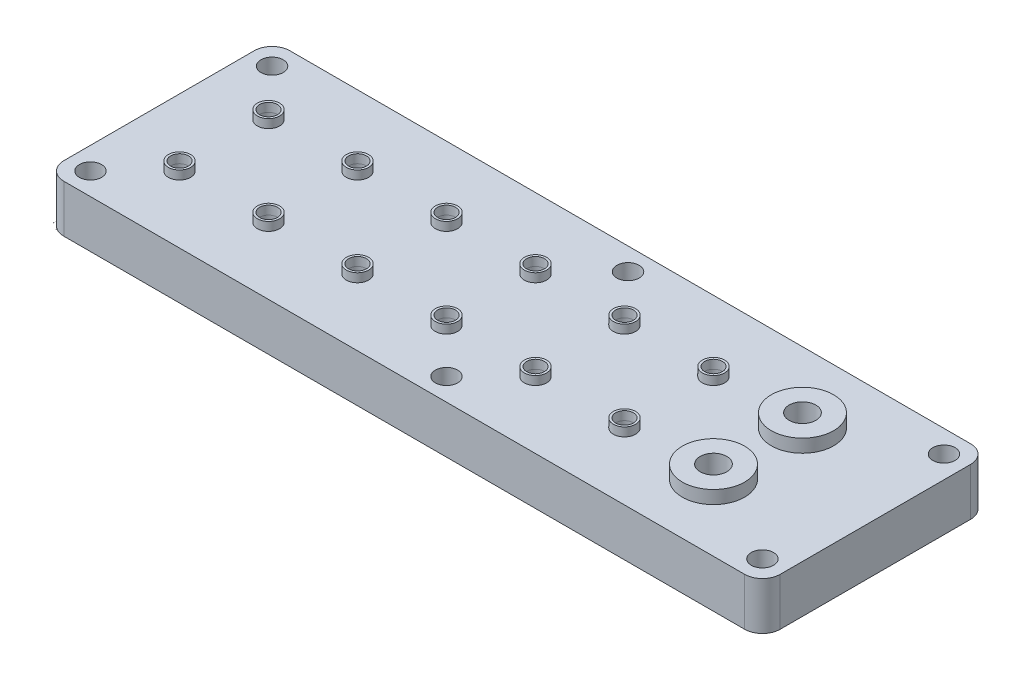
ISO-10303-21;
HEADER;
FILE_DESCRIPTION(('STEP AP214'),'2;1');
FILE_NAME('part.step','',(''),(''),'','','');
FILE_SCHEMA(('AUTOMOTIVE_DESIGN { 1 0 10303 214 1 1 1 1 }'));
ENDSEC;
DATA;
#1=APPLICATION_CONTEXT('core data for automotive mechanical design processes');
#2=APPLICATION_PROTOCOL_DEFINITION('international standard','automotive_design',2000,#1);
#3=PRODUCT_CONTEXT('',#1,'mechanical');
#4=PRODUCT('Part','Part','',(#3));
#5=PRODUCT_RELATED_PRODUCT_CATEGORY('part','',(#4));
#6=PRODUCT_DEFINITION_FORMATION('','',#4);
#7=PRODUCT_DEFINITION_CONTEXT('part definition',#1,'design');
#8=PRODUCT_DEFINITION('design','',#6,#7);
#9=PRODUCT_DEFINITION_SHAPE('','',#8);
#10=(LENGTH_UNIT() NAMED_UNIT(*) SI_UNIT(.MILLI.,.METRE.));
#11=(NAMED_UNIT(*) PLANE_ANGLE_UNIT() SI_UNIT($,.RADIAN.));
#12=(NAMED_UNIT(*) SI_UNIT($,.STERADIAN.) SOLID_ANGLE_UNIT());
#13=UNCERTAINTY_MEASURE_WITH_UNIT(LENGTH_MEASURE(1.E-05),#10,'distance_accuracy_value','');
#14=(GEOMETRIC_REPRESENTATION_CONTEXT(3) GLOBAL_UNCERTAINTY_ASSIGNED_CONTEXT((#13)) GLOBAL_UNIT_ASSIGNED_CONTEXT((#10,
#11,#12)) REPRESENTATION_CONTEXT('',''));
#15=CARTESIAN_POINT('',(0.,0.,0.));
#16=DIRECTION('',(0.,0.,1.));
#17=DIRECTION('',(1.,0.,0.));
#18=AXIS2_PLACEMENT_3D('',#15,#16,#17);
#19=CARTESIAN_POINT('',(6.5,3.22,-6.74999999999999));
#20=DIRECTION('',(0.,0.,-1.));
#21=DIRECTION('',(-1.,0.,0.));
#22=AXIS2_PLACEMENT_3D('',#19,#20,#21);
#23=PLANE('',#22);
#24=DIRECTION('',(0.,-1.,0.));
#25=VECTOR('',#24,1.);
#26=CARTESIAN_POINT('',(154.214642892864,0.,-6.74999999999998));
#27=LINE('',#26,#25);
#28=CARTESIAN_POINT('',(154.214642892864,0.,-6.74999999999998));
#29=VERTEX_POINT('',#28);
#30=CARTESIAN_POINT('',(154.214642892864,3.22,-6.74999999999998));
#31=VERTEX_POINT('',#30);
#32=EDGE_CURVE('E638',#29,#31,#27,.F.);
#33=ORIENTED_EDGE('',*,*,#32,.F.);
#34=DIRECTION('',(1.,0.,0.));
#35=VECTOR('',#34,1.);
#36=CARTESIAN_POINT('',(6.5,0.,-6.74999999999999));
#37=LINE('',#36,#35);
#38=CARTESIAN_POINT('',(86.7853571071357,0.,-6.74999999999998));
#39=VERTEX_POINT('',#38);
#40=EDGE_CURVE('E651',#39,#29,#37,.T.);
#41=ORIENTED_EDGE('',*,*,#40,.F.);
#42=DIRECTION('',(0.,-1.,0.));
#43=VECTOR('',#42,1.);
#44=CARTESIAN_POINT('',(86.7853571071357,0.,-6.74999999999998));
#45=LINE('',#44,#43);
#46=CARTESIAN_POINT('',(86.7853571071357,3.22,-6.74999999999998));
#47=VERTEX_POINT('',#46);
#48=EDGE_CURVE('E260',#47,#39,#45,.T.);
#49=ORIENTED_EDGE('',*,*,#48,.F.);
#50=DIRECTION('',(1.,0.,0.));
#51=VECTOR('',#50,1.);
#52=CARTESIAN_POINT('',(6.5,3.22,-6.74999999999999));
#53=LINE('',#52,#51);
#54=EDGE_CURVE('E653',#47,#31,#53,.T.);
#55=ORIENTED_EDGE('',*,*,#54,.T.);
#56=EDGE_LOOP('',(#33,#41,#49,#55));
#57=FACE_BOUND('',#56,.T.);
#58=ADVANCED_FACE('F234',(#57),#23,.T.);
#59=CARTESIAN_POINT('',(0.,0.,0.));
#60=DIRECTION('',(0.,-1.,0.));
#61=DIRECTION('',(0.,0.,-1.));
#62=AXIS2_PLACEMENT_3D('',#59,#60,#61);
#63=PLANE('',#62);
#64=CARTESIAN_POINT('',(14.5,0.,-14.5));
#65=DIRECTION('',(0.,-1.,0.));
#66=DIRECTION('',(0.,0.,-1.));
#67=AXIS2_PLACEMENT_3D('',#64,#65,#66);
#68=CIRCLE('',#67,2.);
#69=CARTESIAN_POINT('',(14.5,0.,-12.5));
#70=VERTEX_POINT('',#69);
#71=CARTESIAN_POINT('',(12.5,0.,-14.5));
#72=VERTEX_POINT('',#71);
#73=EDGE_CURVE('E1155',#70,#72,#68,.T.);
#74=ORIENTED_EDGE('',*,*,#73,.F.);
#75=DIRECTION('',(-1.,0.,0.));
#76=VECTOR('',#75,1.);
#77=CARTESIAN_POINT('',(14.5,0.,-12.5));
#78=LINE('',#77,#76);
#79=CARTESIAN_POINT('',(135.5,0.,-12.5));
#80=VERTEX_POINT('',#79);
#81=EDGE_CURVE('E1161',#80,#70,#78,.T.);
#82=ORIENTED_EDGE('',*,*,#81,.F.);
#83=CARTESIAN_POINT('',(135.5,0.,-14.5));
#84=DIRECTION('',(0.,-1.,0.));
#85=DIRECTION('',(0.,0.,1.));
#86=AXIS2_PLACEMENT_3D('',#83,#84,#85);
#87=CIRCLE('',#86,2.);
#88=CARTESIAN_POINT('',(137.5,0.,-14.5));
#89=VERTEX_POINT('',#88);
#90=EDGE_CURVE('E1212',#89,#80,#87,.T.);
#91=ORIENTED_EDGE('',*,*,#90,.F.);
#92=DIRECTION('',(0.,0.,1.));
#93=VECTOR('',#92,1.);
#94=CARTESIAN_POINT('',(137.5,0.,-14.5));
#95=LINE('',#94,#93);
#96=CARTESIAN_POINT('',(137.5,0.,-15.5));
#97=VERTEX_POINT('',#96);
#98=EDGE_CURVE('E1208',#97,#89,#95,.T.);
#99=ORIENTED_EDGE('',*,*,#98,.F.);
#100=CARTESIAN_POINT('',(135.5,0.,-15.5));
#101=DIRECTION('',(0.,-1.,0.));
#102=DIRECTION('',(0.,0.,1.));
#103=AXIS2_PLACEMENT_3D('',#100,#101,#102);
#104=CIRCLE('',#103,2.);
#105=CARTESIAN_POINT('',(135.5,0.,-17.5));
#106=VERTEX_POINT('',#105);
#107=EDGE_CURVE('E1204',#106,#97,#104,.T.);
#108=ORIENTED_EDGE('',*,*,#107,.F.);
#109=DIRECTION('',(1.,0.,0.));
#110=VECTOR('',#109,1.);
#111=CARTESIAN_POINT('',(14.5,0.,-17.5));
#112=LINE('',#111,#110);
#113=CARTESIAN_POINT('',(14.5,0.,-17.5));
#114=VERTEX_POINT('',#113);
#115=EDGE_CURVE('E1200',#114,#106,#112,.T.);
#116=ORIENTED_EDGE('',*,*,#115,.F.);
#117=CARTESIAN_POINT('',(14.5,0.,-15.5));
#118=DIRECTION('',(0.,-1.,0.));
#119=DIRECTION('',(0.,0.,-1.));
#120=AXIS2_PLACEMENT_3D('',#117,#118,#119);
#121=CIRCLE('',#120,2.);
#122=CARTESIAN_POINT('',(12.5,0.,-15.5));
#123=VERTEX_POINT('',#122);
#124=EDGE_CURVE('E1196',#123,#114,#121,.T.);
#125=ORIENTED_EDGE('',*,*,#124,.F.);
#126=DIRECTION('',(0.,0.,-1.));
#127=VECTOR('',#126,1.);
#128=CARTESIAN_POINT('',(12.5,0.,-14.5));
#129=LINE('',#128,#127);
#130=EDGE_CURVE('E1192',#72,#123,#129,.T.);
#131=ORIENTED_EDGE('',*,*,#130,.F.);
#132=EDGE_LOOP('',(#74,#82,#91,#99,#108,#116,#125,#131));
#133=FACE_BOUND('',#132,.T.);
#134=DIRECTION('',(1.,0.,0.));
#135=VECTOR('',#134,1.);
#136=CARTESIAN_POINT('',(6.5,0.,-10.75));
#137=LINE('',#136,#135);
#138=CARTESIAN_POINT('',(8.5,0.,-10.75));
#139=VERTEX_POINT('',#138);
#140=CARTESIAN_POINT('',(152.5,0.,-10.75));
#141=VERTEX_POINT('',#140);
#142=EDGE_CURVE('E677',#139,#141,#137,.T.);
#143=ORIENTED_EDGE('',*,*,#142,.F.);
#144=DIRECTION('',(0.,0.,-1.));
#145=VECTOR('',#144,1.);
#146=CARTESIAN_POINT('',(8.5,0.,-8.74999999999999));
#147=LINE('',#146,#145);
#148=CARTESIAN_POINT('',(8.5,0.,-19.25));
#149=VERTEX_POINT('',#148);
#150=EDGE_CURVE('E1518',#139,#149,#147,.T.);
#151=ORIENTED_EDGE('',*,*,#150,.T.);
#152=DIRECTION('',(1.,0.,0.));
#153=VECTOR('',#152,1.);
#154=CARTESIAN_POINT('',(6.5,0.,-19.25));
#155=LINE('',#154,#153);
#156=CARTESIAN_POINT('',(152.5,0.,-19.25));
#157=VERTEX_POINT('',#156);
#158=EDGE_CURVE('E1538',#149,#157,#155,.T.);
#159=ORIENTED_EDGE('',*,*,#158,.T.);
#160=DIRECTION('',(0.,0.,1.));
#161=VECTOR('',#160,1.);
#162=CARTESIAN_POINT('',(152.5,0.,-21.25));
#163=LINE('',#162,#161);
#164=EDGE_CURVE('E1565',#157,#141,#163,.T.);
#165=ORIENTED_EDGE('',*,*,#164,.T.);
#166=EDGE_LOOP('',(#143,#151,#159,#165));
#167=FACE_BOUND('',#166,.T.);
#168=ADVANCED_FACE('F1639',(#133,#167),#63,.T.);
#169=CARTESIAN_POINT('',(14.5,0.,-34.5));
#170=DIRECTION('',(0.,-1.,0.));
#171=DIRECTION('',(0.,0.,-1.));
#172=AXIS2_PLACEMENT_3D('',#169,#170,#171);
#173=CIRCLE('',#172,2.);
#174=CARTESIAN_POINT('',(14.5,0.,-32.5));
#175=VERTEX_POINT('',#174);
#176=CARTESIAN_POINT('',(12.5,0.,-34.5));
#177=VERTEX_POINT('',#176);
#178=EDGE_CURVE('E1042',#175,#177,#173,.T.);
#179=ORIENTED_EDGE('',*,*,#178,.F.);
#180=DIRECTION('',(-1.,0.,0.));
#181=VECTOR('',#180,1.);
#182=CARTESIAN_POINT('',(14.5,0.,-32.5));
#183=LINE('',#182,#181);
#184=CARTESIAN_POINT('',(135.5,0.,-32.5));
#185=VERTEX_POINT('',#184);
#186=EDGE_CURVE('E1048',#185,#175,#183,.T.);
#187=ORIENTED_EDGE('',*,*,#186,.F.);
#188=CARTESIAN_POINT('',(135.5,0.,-34.5));
#189=DIRECTION('',(0.,-1.,0.));
#190=DIRECTION('',(0.,0.,-1.));
#191=AXIS2_PLACEMENT_3D('',#188,#189,#190);
#192=CIRCLE('',#191,2.00000000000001);
#193=CARTESIAN_POINT('',(137.5,0.,-34.5));
#194=VERTEX_POINT('',#193);
#195=EDGE_CURVE('E1099',#194,#185,#192,.T.);
#196=ORIENTED_EDGE('',*,*,#195,.F.);
#197=DIRECTION('',(0.,0.,1.));
#198=VECTOR('',#197,1.);
#199=CARTESIAN_POINT('',(137.5,0.,-34.5));
#200=LINE('',#199,#198);
#201=CARTESIAN_POINT('',(137.5,0.,-35.5));
#202=VERTEX_POINT('',#201);
#203=EDGE_CURVE('E1095',#202,#194,#200,.T.);
#204=ORIENTED_EDGE('',*,*,#203,.F.);
#205=CARTESIAN_POINT('',(135.5,0.,-35.5));
#206=DIRECTION('',(0.,-1.,0.));
#207=DIRECTION('',(0.,0.,-1.));
#208=AXIS2_PLACEMENT_3D('',#205,#206,#207);
#209=CIRCLE('',#208,2.00000000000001);
#210=CARTESIAN_POINT('',(135.5,0.,-37.5));
#211=VERTEX_POINT('',#210);
#212=EDGE_CURVE('E1091',#211,#202,#209,.T.);
#213=ORIENTED_EDGE('',*,*,#212,.F.);
#214=DIRECTION('',(1.,0.,0.));
#215=VECTOR('',#214,1.);
#216=CARTESIAN_POINT('',(14.5,0.,-37.5));
#217=LINE('',#216,#215);
#218=CARTESIAN_POINT('',(14.5,0.,-37.5));
#219=VERTEX_POINT('',#218);
#220=EDGE_CURVE('E1087',#219,#211,#217,.T.);
#221=ORIENTED_EDGE('',*,*,#220,.F.);
#222=CARTESIAN_POINT('',(14.5,0.,-35.5));
#223=DIRECTION('',(0.,-1.,0.));
#224=DIRECTION('',(0.,0.,-1.));
#225=AXIS2_PLACEMENT_3D('',#222,#223,#224);
#226=CIRCLE('',#225,2.);
#227=CARTESIAN_POINT('',(12.5,0.,-35.5));
#228=VERTEX_POINT('',#227);
#229=EDGE_CURVE('E1083',#228,#219,#226,.T.);
#230=ORIENTED_EDGE('',*,*,#229,.F.);
#231=DIRECTION('',(0.,0.,-1.));
#232=VECTOR('',#231,1.);
#233=CARTESIAN_POINT('',(12.5,0.,-34.5));
#234=LINE('',#233,#232);
#235=EDGE_CURVE('E1079',#177,#228,#234,.T.);
#236=ORIENTED_EDGE('',*,*,#235,.F.);
#237=EDGE_LOOP('',(#179,#187,#196,#204,#213,#221,#230,#236));
#238=FACE_BOUND('',#237,.T.);
#239=DIRECTION('',(0.,0.,-1.));
#240=VECTOR('',#239,1.);
#241=CARTESIAN_POINT('',(8.5,0.,-28.75));
#242=LINE('',#241,#240);
#243=CARTESIAN_POINT('',(8.5,0.,-30.75));
#244=VERTEX_POINT('',#243);
#245=CARTESIAN_POINT('',(8.5,0.,-39.25));
#246=VERTEX_POINT('',#245);
#247=EDGE_CURVE('E699',#244,#246,#242,.T.);
#248=ORIENTED_EDGE('',*,*,#247,.T.);
#249=DIRECTION('',(1.,0.,0.));
#250=VECTOR('',#249,1.);
#251=CARTESIAN_POINT('',(6.5,0.,-39.25));
#252=LINE('',#251,#250);
#253=CARTESIAN_POINT('',(152.5,0.,-39.25));
#254=VERTEX_POINT('',#253);
#255=EDGE_CURVE('E773',#246,#254,#252,.T.);
#256=ORIENTED_EDGE('',*,*,#255,.T.);
#257=DIRECTION('',(0.,0.,1.));
#258=VECTOR('',#257,1.);
#259=CARTESIAN_POINT('',(152.5,0.,-41.25));
#260=LINE('',#259,#258);
#261=CARTESIAN_POINT('',(152.5,0.,-30.75));
#262=VERTEX_POINT('',#261);
#263=EDGE_CURVE('E805',#254,#262,#260,.T.);
#264=ORIENTED_EDGE('',*,*,#263,.T.);
#265=DIRECTION('',(1.,0.,0.));
#266=VECTOR('',#265,1.);
#267=CARTESIAN_POINT('',(6.5,0.,-30.75));
#268=LINE('',#267,#266);
#269=EDGE_CURVE('E752',#244,#262,#268,.T.);
#270=ORIENTED_EDGE('',*,*,#269,.F.);
#271=EDGE_LOOP('',(#248,#256,#264,#270));
#272=FACE_BOUND('',#271,.T.);
#273=ADVANCED_FACE('F1645',(#238,#272),#63,.T.);
#274=CARTESIAN_POINT('',(0.,10.7,0.));
#275=DIRECTION('',(0.,-1.,0.));
#276=DIRECTION('',(0.,0.,-1.));
#277=AXIS2_PLACEMENT_3D('',#274,#275,#276);
#278=PLANE('',#277);
#279=CARTESIAN_POINT('',(5.,10.7,-45.8));
#280=DIRECTION('',(0.,-1.,0.));
#281=DIRECTION('',(0.,0.,-1.));
#282=AXIS2_PLACEMENT_3D('',#279,#280,#281);
#283=CIRCLE('',#282,2.5);
#284=CARTESIAN_POINT('',(5.,10.7,-48.3));
#285=VERTEX_POINT('',#284);
#286=EDGE_CURVE('E1445',#285,#285,#283,.T.);
#287=ORIENTED_EDGE('',*,*,#286,.T.);
#288=EDGE_LOOP('',(#287));
#289=FACE_BOUND('',#288,.T.);
#290=CARTESIAN_POINT('',(85.,10.7,-45.8));
#291=DIRECTION('',(0.,-1.,0.));
#292=DIRECTION('',(0.,0.,-1.));
#293=AXIS2_PLACEMENT_3D('',#290,#291,#292);
#294=CIRCLE('',#293,2.5);
#295=CARTESIAN_POINT('',(85.,10.7,-48.3));
#296=VERTEX_POINT('',#295);
#297=EDGE_CURVE('E1453',#296,#296,#294,.T.);
#298=ORIENTED_EDGE('',*,*,#297,.T.);
#299=EDGE_LOOP('',(#298));
#300=FACE_BOUND('',#299,.T.);
#301=CARTESIAN_POINT('',(156.,10.7,-45.8));
#302=DIRECTION('',(0.,-1.,0.));
#303=DIRECTION('',(0.,0.,-1.));
#304=AXIS2_PLACEMENT_3D('',#301,#302,#303);
#305=CIRCLE('',#304,2.5);
#306=CARTESIAN_POINT('',(156.,10.7,-48.3));
#307=VERTEX_POINT('',#306);
#308=EDGE_CURVE('E646',#307,#307,#305,.T.);
#309=ORIENTED_EDGE('',*,*,#308,.T.);
#310=EDGE_LOOP('',(#309));
#311=FACE_BOUND('',#310,.T.);
#312=CARTESIAN_POINT('',(156.,10.7,-5.));
#313=DIRECTION('',(0.,-1.,0.));
#314=DIRECTION('',(0.,0.,-1.));
#315=AXIS2_PLACEMENT_3D('',#312,#313,#314);
#316=CIRCLE('',#315,2.5);
#317=CARTESIAN_POINT('',(156.,10.7,-7.5));
#318=VERTEX_POINT('',#317);
#319=EDGE_CURVE('E645',#318,#318,#316,.T.);
#320=ORIENTED_EDGE('',*,*,#319,.T.);
#321=EDGE_LOOP('',(#320));
#322=FACE_BOUND('',#321,.T.);
#323=CARTESIAN_POINT('',(85.,10.7,-5.));
#324=DIRECTION('',(0.,-1.,0.));
#325=DIRECTION('',(0.,0.,-1.));
#326=AXIS2_PLACEMENT_3D('',#323,#324,#325);
#327=CIRCLE('',#326,2.5);
#328=CARTESIAN_POINT('',(85.,10.7,-7.5));
#329=VERTEX_POINT('',#328);
#330=EDGE_CURVE('E1468',#329,#329,#327,.T.);
#331=ORIENTED_EDGE('',*,*,#330,.T.);
#332=EDGE_LOOP('',(#331));
#333=FACE_BOUND('',#332,.T.);
#334=CARTESIAN_POINT('',(5.,10.7,-5.));
#335=DIRECTION('',(0.,-1.,0.));
#336=DIRECTION('',(0.,0.,-1.));
#337=AXIS2_PLACEMENT_3D('',#334,#335,#336);
#338=CIRCLE('',#337,2.5);
#339=CARTESIAN_POINT('',(5.,10.7,-7.5));
#340=VERTEX_POINT('',#339);
#341=EDGE_CURVE('E1483',#340,#340,#338,.T.);
#342=ORIENTED_EDGE('',*,*,#341,.T.);
#343=EDGE_LOOP('',(#342));
#344=FACE_BOUND('',#343,.T.);
#345=CARTESIAN_POINT('',(135.,10.7,-15.));
#346=DIRECTION('',(0.,-1.,0.));
#347=DIRECTION('',(0.,0.,-1.));
#348=AXIS2_PLACEMENT_3D('',#345,#346,#347);
#349=CIRCLE('',#348,6.99826733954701);
#350=CARTESIAN_POINT('',(135.,10.7,-21.998267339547));
#351=VERTEX_POINT('',#350);
#352=EDGE_CURVE('E1354',#351,#351,#349,.F.);
#353=ORIENTED_EDGE('',*,*,#352,.F.);
#354=EDGE_LOOP('',(#353));
#355=FACE_BOUND('',#354,.T.);
#356=CARTESIAN_POINT('',(115.,10.7,-35.));
#357=DIRECTION('',(0.,-1.,0.));
#358=DIRECTION('',(0.,0.,-1.));
#359=AXIS2_PLACEMENT_3D('',#356,#357,#358);
#360=CIRCLE('',#359,2.5);
#361=CARTESIAN_POINT('',(115.,10.7,-37.5));
#362=VERTEX_POINT('',#361);
#363=EDGE_CURVE('E1346',#362,#362,#360,.F.);
#364=ORIENTED_EDGE('',*,*,#363,.F.);
#365=EDGE_LOOP('',(#364));
#366=FACE_BOUND('',#365,.T.);
#367=CARTESIAN_POINT('',(95.,10.7,-35.));
#368=DIRECTION('',(0.,-1.,0.));
#369=DIRECTION('',(0.,0.,-1.));
#370=AXIS2_PLACEMENT_3D('',#367,#368,#369);
#371=CIRCLE('',#370,2.50000000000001);
#372=CARTESIAN_POINT('',(95.,10.7,-37.5));
#373=VERTEX_POINT('',#372);
#374=EDGE_CURVE('E1338',#373,#373,#371,.F.);
#375=ORIENTED_EDGE('',*,*,#374,.F.);
#376=EDGE_LOOP('',(#375));
#377=FACE_BOUND('',#376,.T.);
#378=CARTESIAN_POINT('',(75.,10.7,-35.));
#379=DIRECTION('',(0.,-1.,0.));
#380=DIRECTION('',(0.,0.,-1.));
#381=AXIS2_PLACEMENT_3D('',#378,#379,#380);
#382=CIRCLE('',#381,2.5);
#383=CARTESIAN_POINT('',(75.,10.7,-37.5));
#384=VERTEX_POINT('',#383);
#385=EDGE_CURVE('E1330',#384,#384,#382,.F.);
#386=ORIENTED_EDGE('',*,*,#385,.F.);
#387=EDGE_LOOP('',(#386));
#388=FACE_BOUND('',#387,.T.);
#389=CARTESIAN_POINT('',(55.,10.7,-35.));
#390=DIRECTION('',(0.,-1.,0.));
#391=DIRECTION('',(0.,0.,-1.));
#392=AXIS2_PLACEMENT_3D('',#389,#390,#391);
#393=CIRCLE('',#392,2.5);
#394=CARTESIAN_POINT('',(55.,10.7,-37.5));
#395=VERTEX_POINT('',#394);
#396=EDGE_CURVE('E1322',#395,#395,#393,.F.);
#397=ORIENTED_EDGE('',*,*,#396,.F.);
#398=EDGE_LOOP('',(#397));
#399=FACE_BOUND('',#398,.T.);
#400=CARTESIAN_POINT('',(35.,10.7,-35.));
#401=DIRECTION('',(0.,-1.,0.));
#402=DIRECTION('',(0.,0.,-1.));
#403=AXIS2_PLACEMENT_3D('',#400,#401,#402);
#404=CIRCLE('',#403,2.5);
#405=CARTESIAN_POINT('',(35.,10.7,-37.5));
#406=VERTEX_POINT('',#405);
#407=EDGE_CURVE('E1314',#406,#406,#404,.F.);
#408=ORIENTED_EDGE('',*,*,#407,.F.);
#409=EDGE_LOOP('',(#408));
#410=FACE_BOUND('',#409,.T.);
#411=CARTESIAN_POINT('',(15.,10.7,-35.));
#412=DIRECTION('',(0.,-1.,0.));
#413=DIRECTION('',(0.,0.,-1.));
#414=AXIS2_PLACEMENT_3D('',#411,#412,#413);
#415=CIRCLE('',#414,2.5);
#416=CARTESIAN_POINT('',(15.,10.7,-37.5));
#417=VERTEX_POINT('',#416);
#418=EDGE_CURVE('E1286',#417,#417,#415,.F.);
#419=ORIENTED_EDGE('',*,*,#418,.F.);
#420=EDGE_LOOP('',(#419));
#421=FACE_BOUND('',#420,.T.);
#422=DIRECTION('',(0.,0.,-1.));
#423=VECTOR('',#422,1.);
#424=CARTESIAN_POINT('',(161.,10.7,0.));
#425=LINE('',#424,#423);
#426=CARTESIAN_POINT('',(161.,10.7,-4.));
#427=VERTEX_POINT('',#426);
#428=CARTESIAN_POINT('',(161.,10.7,-46.8));
#429=VERTEX_POINT('',#428);
#430=EDGE_CURVE('E1278',#427,#429,#425,.T.);
#431=ORIENTED_EDGE('',*,*,#430,.T.);
#432=CARTESIAN_POINT('',(157.,10.7,-46.8));
#433=DIRECTION('',(0.,-1.,0.));
#434=DIRECTION('',(0.,0.,-1.));
#435=AXIS2_PLACEMENT_3D('',#432,#433,#434);
#436=CIRCLE('',#435,4.);
#437=CARTESIAN_POINT('',(157.,10.7,-50.8));
#438=VERTEX_POINT('',#437);
#439=EDGE_CURVE('E1397',#429,#438,#436,.F.);
#440=ORIENTED_EDGE('',*,*,#439,.T.);
#441=DIRECTION('',(-1.,0.,0.));
#442=VECTOR('',#441,1.);
#443=CARTESIAN_POINT('',(0.,10.7,-50.8));
#444=LINE('',#443,#442);
#445=CARTESIAN_POINT('',(4.,10.7,-50.8));
#446=VERTEX_POINT('',#445);
#447=EDGE_CURVE('E1282',#438,#446,#444,.T.);
#448=ORIENTED_EDGE('',*,*,#447,.T.);
#449=CARTESIAN_POINT('',(4.,10.7,-46.8));
#450=DIRECTION('',(0.,-1.,0.));
#451=DIRECTION('',(0.,0.,-1.));
#452=AXIS2_PLACEMENT_3D('',#449,#450,#451);
#453=CIRCLE('',#452,4.);
#454=CARTESIAN_POINT('',(0.,10.7,-46.8));
#455=VERTEX_POINT('',#454);
#456=EDGE_CURVE('E1388',#446,#455,#453,.F.);
#457=ORIENTED_EDGE('',*,*,#456,.T.);
#458=DIRECTION('',(0.,0.,1.));
#459=VECTOR('',#458,1.);
#460=CARTESIAN_POINT('',(0.,10.7,0.));
#461=LINE('',#460,#459);
#462=CARTESIAN_POINT('',(0.,10.7,-4.));
#463=VERTEX_POINT('',#462);
#464=EDGE_CURVE('E1269',#455,#463,#461,.T.);
#465=ORIENTED_EDGE('',*,*,#464,.T.);
#466=CARTESIAN_POINT('',(4.,10.7,-4.));
#467=DIRECTION('',(0.,-1.,0.));
#468=DIRECTION('',(0.,0.,-1.));
#469=AXIS2_PLACEMENT_3D('',#466,#467,#468);
#470=CIRCLE('',#469,4.);
#471=CARTESIAN_POINT('',(4.,10.7,0.));
#472=VERTEX_POINT('',#471);
#473=EDGE_CURVE('E1391',#463,#472,#470,.F.);
#474=ORIENTED_EDGE('',*,*,#473,.T.);
#475=DIRECTION('',(1.,0.,0.));
#476=VECTOR('',#475,1.);
#477=CARTESIAN_POINT('',(0.,10.7,0.));
#478=LINE('',#477,#476);
#479=CARTESIAN_POINT('',(157.,10.7,0.));
#480=VERTEX_POINT('',#479);
#481=EDGE_CURVE('E1273',#472,#480,#478,.T.);
#482=ORIENTED_EDGE('',*,*,#481,.T.);
#483=CARTESIAN_POINT('',(157.,10.7,-4.));
#484=DIRECTION('',(0.,-1.,0.));
#485=DIRECTION('',(0.,0.,-1.));
#486=AXIS2_PLACEMENT_3D('',#483,#484,#485);
#487=CIRCLE('',#486,4.);
#488=EDGE_CURVE('E1394',#480,#427,#487,.F.);
#489=ORIENTED_EDGE('',*,*,#488,.T.);
#490=EDGE_LOOP('',(#431,#440,#448,#457,#465,#474,#482,#489));
#491=FACE_BOUND('',#490,.T.);
#492=CARTESIAN_POINT('',(15.,10.7,-15.));
#493=DIRECTION('',(0.,-1.,0.));
#494=DIRECTION('',(0.,0.,-1.));
#495=AXIS2_PLACEMENT_3D('',#492,#493,#494);
#496=CIRCLE('',#495,2.5);
#497=CARTESIAN_POINT('',(15.,10.7,-17.5));
#498=VERTEX_POINT('',#497);
#499=EDGE_CURVE('E1310',#498,#498,#496,.F.);
#500=ORIENTED_EDGE('',*,*,#499,.F.);
#501=EDGE_LOOP('',(#500));
#502=FACE_BOUND('',#501,.T.);
#503=CARTESIAN_POINT('',(35.,10.7,-15.));
#504=DIRECTION('',(0.,-1.,0.));
#505=DIRECTION('',(0.,0.,-1.));
#506=AXIS2_PLACEMENT_3D('',#503,#504,#505);
#507=CIRCLE('',#506,2.49999999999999);
#508=CARTESIAN_POINT('',(35.,10.7,-17.5));
#509=VERTEX_POINT('',#508);
#510=EDGE_CURVE('E1318',#509,#509,#507,.F.);
#511=ORIENTED_EDGE('',*,*,#510,.F.);
#512=EDGE_LOOP('',(#511));
#513=FACE_BOUND('',#512,.T.);
#514=CARTESIAN_POINT('',(55.,10.7,-15.));
#515=DIRECTION('',(0.,-1.,0.));
#516=DIRECTION('',(0.,0.,-1.));
#517=AXIS2_PLACEMENT_3D('',#514,#515,#516);
#518=CIRCLE('',#517,2.49999999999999);
#519=CARTESIAN_POINT('',(55.,10.7,-17.5));
#520=VERTEX_POINT('',#519);
#521=EDGE_CURVE('E1326',#520,#520,#518,.F.);
#522=ORIENTED_EDGE('',*,*,#521,.F.);
#523=EDGE_LOOP('',(#522));
#524=FACE_BOUND('',#523,.T.);
#525=CARTESIAN_POINT('',(75.,10.7,-15.));
#526=DIRECTION('',(0.,-1.,0.));
#527=DIRECTION('',(0.,0.,-1.));
#528=AXIS2_PLACEMENT_3D('',#525,#526,#527);
#529=CIRCLE('',#528,2.49999999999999);
#530=CARTESIAN_POINT('',(75.,10.7,-17.5));
#531=VERTEX_POINT('',#530);
#532=EDGE_CURVE('E1334',#531,#531,#529,.F.);
#533=ORIENTED_EDGE('',*,*,#532,.F.);
#534=EDGE_LOOP('',(#533));
#535=FACE_BOUND('',#534,.T.);
#536=CARTESIAN_POINT('',(115.,10.7,-15.));
#537=DIRECTION('',(0.,-1.,0.));
#538=DIRECTION('',(0.,0.,-1.));
#539=AXIS2_PLACEMENT_3D('',#536,#537,#538);
#540=CIRCLE('',#539,2.5);
#541=CARTESIAN_POINT('',(115.,10.7,-17.5));
#542=VERTEX_POINT('',#541);
#543=EDGE_CURVE('E1342',#542,#542,#540,.F.);
#544=ORIENTED_EDGE('',*,*,#543,.F.);
#545=EDGE_LOOP('',(#544));
#546=FACE_BOUND('',#545,.T.);
#547=CARTESIAN_POINT('',(95.,10.7,-15.));
#548=DIRECTION('',(0.,-1.,0.));
#549=DIRECTION('',(0.,0.,-1.));
#550=AXIS2_PLACEMENT_3D('',#547,#548,#549);
#551=CIRCLE('',#550,2.49999999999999);
#552=CARTESIAN_POINT('',(95.,10.7,-17.5));
#553=VERTEX_POINT('',#552);
#554=EDGE_CURVE('E1350',#553,#553,#551,.F.);
#555=ORIENTED_EDGE('',*,*,#554,.F.);
#556=EDGE_LOOP('',(#555));
#557=FACE_BOUND('',#556,.T.);
#558=CARTESIAN_POINT('',(135.,10.7,-35.));
#559=DIRECTION('',(0.,-1.,0.));
#560=DIRECTION('',(0.,0.,-1.));
#561=AXIS2_PLACEMENT_3D('',#558,#559,#560);
#562=CIRCLE('',#561,7.00000000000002);
#563=CARTESIAN_POINT('',(135.,10.7,-42.));
#564=VERTEX_POINT('',#563);
#565=EDGE_CURVE('E1358',#564,#564,#562,.F.);
#566=ORIENTED_EDGE('',*,*,#565,.F.);
#567=EDGE_LOOP('',(#566));
#568=FACE_BOUND('',#567,.T.);
#569=ADVANCED_FACE('F1897',(#289,#300,#311,#322,#333,#344,#355,#366,#377,#388,#399,#410,#421,
#491,#502,#513,#524,#535,#546,#557,#568),#278,.F.);
#570=CARTESIAN_POINT('',(15.,12.15,-35.));
#571=DIRECTION('',(0.,-1.,0.));
#572=DIRECTION('',(0.,0.,-1.));
#573=AXIS2_PLACEMENT_3D('',#570,#571,#572);
#574=CYLINDRICAL_SURFACE('',#573,2.);
#575=CARTESIAN_POINT('',(15.,10.7,-35.));
#576=DIRECTION('',(0.,1.,0.));
#577=DIRECTION('',(0.,0.,1.));
#578=AXIS2_PLACEMENT_3D('',#575,#576,#577);
#579=CIRCLE('',#578,2.);
#580=CARTESIAN_POINT('',(15.5440762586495,10.7,-36.9245729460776));
#581=VERTEX_POINT('',#580);
#582=CARTESIAN_POINT('',(14.4678222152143,10.7,-33.0721030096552));
#583=VERTEX_POINT('',#582);
#584=EDGE_CURVE('E1038',#581,#583,#579,.T.);
#585=ORIENTED_EDGE('',*,*,#584,.T.);
#586=EDGE_CURVE('E1037',#583,#581,#579,.T.);
#587=ORIENTED_EDGE('',*,*,#586,.T.);
#588=EDGE_LOOP('',(#585,#587));
#589=FACE_BOUND('',#588,.T.);
#590=CARTESIAN_POINT('',(15.,3.5,-35.));
#591=DIRECTION('',(0.,-1.,0.));
#592=DIRECTION('',(0.,0.,-1.));
#593=AXIS2_PLACEMENT_3D('',#590,#591,#592);
#594=CIRCLE('',#593,2.);
#595=CARTESIAN_POINT('',(15.,3.5,-37.));
#596=VERTEX_POINT('',#595);
#597=EDGE_CURVE('E1151',#596,#596,#594,.T.);
#598=ORIENTED_EDGE('',*,*,#597,.T.);
#599=EDGE_LOOP('',(#598));
#600=FACE_BOUND('',#599,.T.);
#601=ADVANCED_FACE('F1754',(#589,#600),#574,.F.);
#602=CARTESIAN_POINT('',(35.,12.15,-35.));
#603=DIRECTION('',(0.,-1.,0.));
#604=DIRECTION('',(0.,0.,-1.));
#605=AXIS2_PLACEMENT_3D('',#602,#603,#604);
#606=CYLINDRICAL_SURFACE('',#605,2.);
#607=CARTESIAN_POINT('',(35.,10.7,-35.));
#608=DIRECTION('',(0.,1.,0.));
#609=DIRECTION('',(0.,0.,1.));
#610=AXIS2_PLACEMENT_3D('',#607,#608,#609);
#611=CIRCLE('',#610,2.);
#612=CARTESIAN_POINT('',(35.5440762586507,10.7,-36.9245729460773));
#613=VERTEX_POINT('',#612);
#614=CARTESIAN_POINT('',(34.4678222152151,10.7,-33.072103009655));
#615=VERTEX_POINT('',#614);
#616=EDGE_CURVE('E1020',#613,#615,#611,.T.);
#617=ORIENTED_EDGE('',*,*,#616,.T.);
#618=EDGE_CURVE('E1019',#615,#613,#611,.T.);
#619=ORIENTED_EDGE('',*,*,#618,.T.);
#620=EDGE_LOOP('',(#617,#619));
#621=FACE_BOUND('',#620,.T.);
#622=CARTESIAN_POINT('',(35.,3.5,-35.));
#623=DIRECTION('',(0.,-1.,0.));
#624=DIRECTION('',(0.,0.,-1.));
#625=AXIS2_PLACEMENT_3D('',#622,#623,#624);
#626=CIRCLE('',#625,2.);
#627=CARTESIAN_POINT('',(35.,3.5,-37.));
#628=VERTEX_POINT('',#627);
#629=EDGE_CURVE('E1147',#628,#628,#626,.T.);
#630=ORIENTED_EDGE('',*,*,#629,.T.);
#631=EDGE_LOOP('',(#630));
#632=FACE_BOUND('',#631,.T.);
#633=ADVANCED_FACE('F1887',(#621,#632),#606,.F.);
#634=CARTESIAN_POINT('',(55.,12.15,-35.));
#635=DIRECTION('',(0.,-1.,0.));
#636=DIRECTION('',(0.,0.,-1.));
#637=AXIS2_PLACEMENT_3D('',#634,#635,#636);
#638=CYLINDRICAL_SURFACE('',#637,2.);
#639=CARTESIAN_POINT('',(55.,10.7,-35.));
#640=DIRECTION('',(0.,1.,0.));
#641=DIRECTION('',(0.,0.,1.));
#642=AXIS2_PLACEMENT_3D('',#639,#640,#641);
#643=CIRCLE('',#642,2.);
#644=CARTESIAN_POINT('',(55.5440762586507,10.7,-36.9245729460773));
#645=VERTEX_POINT('',#644);
#646=CARTESIAN_POINT('',(54.4678222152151,10.7,-33.072103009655));
#647=VERTEX_POINT('',#646);
#648=EDGE_CURVE('E1002',#645,#647,#643,.T.);
#649=ORIENTED_EDGE('',*,*,#648,.T.);
#650=EDGE_CURVE('E1001',#647,#645,#643,.T.);
#651=ORIENTED_EDGE('',*,*,#650,.T.);
#652=EDGE_LOOP('',(#649,#651));
#653=FACE_BOUND('',#652,.T.);
#654=CARTESIAN_POINT('',(55.,3.5,-35.));
#655=DIRECTION('',(0.,-1.,0.));
#656=DIRECTION('',(0.,0.,-1.));
#657=AXIS2_PLACEMENT_3D('',#654,#655,#656);
#658=CIRCLE('',#657,2.);
#659=CARTESIAN_POINT('',(55.,3.5,-37.));
#660=VERTEX_POINT('',#659);
#661=EDGE_CURVE('E1143',#660,#660,#658,.T.);
#662=ORIENTED_EDGE('',*,*,#661,.T.);
#663=EDGE_LOOP('',(#662));
#664=FACE_BOUND('',#663,.T.);
#665=ADVANCED_FACE('F1879',(#653,#664),#638,.F.);
#666=CARTESIAN_POINT('',(75.,12.15,-35.));
#667=DIRECTION('',(0.,-1.,0.));
#668=DIRECTION('',(0.,0.,-1.));
#669=AXIS2_PLACEMENT_3D('',#666,#667,#668);
#670=CYLINDRICAL_SURFACE('',#669,2.);
#671=CARTESIAN_POINT('',(75.,10.7,-35.));
#672=DIRECTION('',(0.,1.,0.));
#673=DIRECTION('',(0.,0.,1.));
#674=AXIS2_PLACEMENT_3D('',#671,#672,#673);
#675=CIRCLE('',#674,2.);
#676=CARTESIAN_POINT('',(75.5440762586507,10.7,-36.9245729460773));
#677=VERTEX_POINT('',#676);
#678=CARTESIAN_POINT('',(74.4678222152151,10.7,-33.072103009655));
#679=VERTEX_POINT('',#678);
#680=EDGE_CURVE('E984',#677,#679,#675,.T.);
#681=ORIENTED_EDGE('',*,*,#680,.T.);
#682=EDGE_CURVE('E983',#679,#677,#675,.T.);
#683=ORIENTED_EDGE('',*,*,#682,.T.);
#684=EDGE_LOOP('',(#681,#683));
#685=FACE_BOUND('',#684,.T.);
#686=CARTESIAN_POINT('',(75.,3.5,-35.));
#687=DIRECTION('',(0.,-1.,0.));
#688=DIRECTION('',(0.,0.,-1.));
#689=AXIS2_PLACEMENT_3D('',#686,#687,#688);
#690=CIRCLE('',#689,2.);
#691=CARTESIAN_POINT('',(75.,3.5,-37.));
#692=VERTEX_POINT('',#691);
#693=EDGE_CURVE('E1139',#692,#692,#690,.T.);
#694=ORIENTED_EDGE('',*,*,#693,.T.);
#695=EDGE_LOOP('',(#694));
#696=FACE_BOUND('',#695,.T.);
#697=ADVANCED_FACE('F1871',(#685,#696),#670,.F.);
#698=CARTESIAN_POINT('',(95.,12.15,-35.));
#699=DIRECTION('',(0.,-1.,0.));
#700=DIRECTION('',(0.,0.,-1.));
#701=AXIS2_PLACEMENT_3D('',#698,#699,#700);
#702=CYLINDRICAL_SURFACE('',#701,2.00000000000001);
#703=CARTESIAN_POINT('',(95.,10.7,-35.));
#704=DIRECTION('',(0.,1.,0.));
#705=DIRECTION('',(0.,0.,1.));
#706=AXIS2_PLACEMENT_3D('',#703,#704,#705);
#707=CIRCLE('',#706,2.00000000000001);
#708=CARTESIAN_POINT('',(95.5440762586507,10.7,-36.9245729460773));
#709=VERTEX_POINT('',#708);
#710=CARTESIAN_POINT('',(94.4678222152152,10.7,-33.0721030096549));
#711=VERTEX_POINT('',#710);
#712=EDGE_CURVE('E966',#709,#711,#707,.T.);
#713=ORIENTED_EDGE('',*,*,#712,.T.);
#714=EDGE_CURVE('E965',#711,#709,#707,.T.);
#715=ORIENTED_EDGE('',*,*,#714,.T.);
#716=EDGE_LOOP('',(#713,#715));
#717=FACE_BOUND('',#716,.T.);
#718=CARTESIAN_POINT('',(95.,3.5,-35.));
#719=DIRECTION('',(0.,-1.,0.));
#720=DIRECTION('',(0.,0.,-1.));
#721=AXIS2_PLACEMENT_3D('',#718,#719,#720);
#722=CIRCLE('',#721,2.00000000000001);
#723=CARTESIAN_POINT('',(95.,3.5,-37.));
#724=VERTEX_POINT('',#723);
#725=EDGE_CURVE('E1135',#724,#724,#722,.T.);
#726=ORIENTED_EDGE('',*,*,#725,.T.);
#727=EDGE_LOOP('',(#726));
#728=FACE_BOUND('',#727,.T.);
#729=ADVANCED_FACE('F1864',(#717,#728),#702,.F.);
#730=CARTESIAN_POINT('',(115.,12.15,-35.));
#731=DIRECTION('',(0.,-1.,0.));
#732=DIRECTION('',(0.,0.,-1.));
#733=AXIS2_PLACEMENT_3D('',#730,#731,#732);
#734=CYLINDRICAL_SURFACE('',#733,2.00000000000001);
#735=CARTESIAN_POINT('',(115.,10.7,-35.));
#736=DIRECTION('',(0.,1.,0.));
#737=DIRECTION('',(0.,0.,1.));
#738=AXIS2_PLACEMENT_3D('',#735,#736,#737);
#739=CIRCLE('',#738,2.00000000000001);
#740=CARTESIAN_POINT('',(115.544076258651,10.7,-36.9245729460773));
#741=VERTEX_POINT('',#740);
#742=CARTESIAN_POINT('',(114.467822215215,10.7,-33.0721030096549));
#743=VERTEX_POINT('',#742);
#744=EDGE_CURVE('E948',#741,#743,#739,.T.);
#745=ORIENTED_EDGE('',*,*,#744,.T.);
#746=EDGE_CURVE('E947',#743,#741,#739,.T.);
#747=ORIENTED_EDGE('',*,*,#746,.T.);
#748=EDGE_LOOP('',(#745,#747));
#749=FACE_BOUND('',#748,.T.);
#750=CARTESIAN_POINT('',(115.,3.5,-35.));
#751=DIRECTION('',(0.,-1.,0.));
#752=DIRECTION('',(0.,0.,-1.));
#753=AXIS2_PLACEMENT_3D('',#750,#751,#752);
#754=CIRCLE('',#753,2.00000000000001);
#755=CARTESIAN_POINT('',(115.,3.5,-37.));
#756=VERTEX_POINT('',#755);
#757=EDGE_CURVE('E1131',#756,#756,#754,.T.);
#758=ORIENTED_EDGE('',*,*,#757,.T.);
#759=EDGE_LOOP('',(#758));
#760=FACE_BOUND('',#759,.T.);
#761=ADVANCED_FACE('F1616',(#749,#760),#734,.F.);
#762=CARTESIAN_POINT('',(135.,12.15,-35.));
#763=DIRECTION('',(0.,-1.,0.));
#764=DIRECTION('',(0.,0.,-1.));
#765=AXIS2_PLACEMENT_3D('',#762,#763,#764);
#766=CYLINDRICAL_SURFACE('',#765,2.);
#767=CARTESIAN_POINT('',(135.,6.04913938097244,-35.));
#768=DIRECTION('',(0.,1.,0.));
#769=DIRECTION('',(0.,0.,1.));
#770=AXIS2_PLACEMENT_3D('',#767,#768,#769);
#771=CIRCLE('',#770,2.);
#772=CARTESIAN_POINT('',(135.,6.04913938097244,-33.));
#773=VERTEX_POINT('',#772);
#774=EDGE_CURVE('E238',#773,#773,#771,.F.);
#775=ORIENTED_EDGE('',*,*,#774,.F.);
#776=EDGE_LOOP('',(#775));
#777=FACE_BOUND('',#776,.T.);
#778=CARTESIAN_POINT('',(135.,3.5,-35.));
#779=DIRECTION('',(0.,-1.,0.));
#780=DIRECTION('',(0.,0.,-1.));
#781=AXIS2_PLACEMENT_3D('',#778,#779,#780);
#782=CIRCLE('',#781,2.);
#783=CARTESIAN_POINT('',(135.,3.5,-37.));
#784=VERTEX_POINT('',#783);
#785=EDGE_CURVE('E1109',#784,#784,#782,.T.);
#786=ORIENTED_EDGE('',*,*,#785,.T.);
#787=EDGE_LOOP('',(#786));
#788=FACE_BOUND('',#787,.T.);
#789=ADVANCED_FACE('F1853',(#777,#788),#766,.F.);
#790=CARTESIAN_POINT('',(15.,12.15,-15.));
#791=DIRECTION('',(0.,-1.,0.));
#792=DIRECTION('',(0.,0.,-1.));
#793=AXIS2_PLACEMENT_3D('',#790,#791,#792);
#794=CYLINDRICAL_SURFACE('',#793,2.);
#795=CARTESIAN_POINT('',(15.,10.7,-15.));
#796=DIRECTION('',(0.,1.,0.));
#797=DIRECTION('',(0.,0.,1.));
#798=AXIS2_PLACEMENT_3D('',#795,#796,#797);
#799=CIRCLE('',#798,2.);
#800=CARTESIAN_POINT('',(15.5440762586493,10.7,-16.9245729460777));
#801=VERTEX_POINT('',#800);
#802=CARTESIAN_POINT('',(14.4678222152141,10.7,-13.0721030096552));
#803=VERTEX_POINT('',#802);
#804=EDGE_CURVE('E1029',#801,#803,#799,.T.);
#805=ORIENTED_EDGE('',*,*,#804,.T.);
#806=EDGE_CURVE('E1028',#803,#801,#799,.T.);
#807=ORIENTED_EDGE('',*,*,#806,.T.);
#808=EDGE_LOOP('',(#805,#807));
#809=FACE_BOUND('',#808,.T.);
#810=CARTESIAN_POINT('',(15.,3.5,-15.));
#811=DIRECTION('',(0.,-1.,0.));
#812=DIRECTION('',(0.,0.,-1.));
#813=AXIS2_PLACEMENT_3D('',#810,#811,#812);
#814=CIRCLE('',#813,2.);
#815=CARTESIAN_POINT('',(15.,3.5,-17.));
#816=VERTEX_POINT('',#815);
#817=EDGE_CURVE('E1264',#816,#816,#814,.T.);
#818=ORIENTED_EDGE('',*,*,#817,.T.);
#819=EDGE_LOOP('',(#818));
#820=FACE_BOUND('',#819,.T.);
#821=ADVANCED_FACE('F1856',(#809,#820),#794,.F.);
#822=CARTESIAN_POINT('',(35.,12.15,-15.));
#823=DIRECTION('',(0.,-1.,0.));
#824=DIRECTION('',(0.,0.,-1.));
#825=AXIS2_PLACEMENT_3D('',#822,#823,#824);
#826=CYLINDRICAL_SURFACE('',#825,2.);
#827=CARTESIAN_POINT('',(35.,10.7,-15.));
#828=DIRECTION('',(0.,1.,0.));
#829=DIRECTION('',(0.,0.,1.));
#830=AXIS2_PLACEMENT_3D('',#827,#828,#829);
#831=CIRCLE('',#830,2.);
#832=CARTESIAN_POINT('',(35.5440762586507,10.7,-16.9245729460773));
#833=VERTEX_POINT('',#832);
#834=CARTESIAN_POINT('',(34.4678222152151,10.7,-13.072103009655));
#835=VERTEX_POINT('',#834);
#836=EDGE_CURVE('E1011',#833,#835,#831,.T.);
#837=ORIENTED_EDGE('',*,*,#836,.T.);
#838=EDGE_CURVE('E1010',#835,#833,#831,.T.);
#839=ORIENTED_EDGE('',*,*,#838,.T.);
#840=EDGE_LOOP('',(#837,#839));
#841=FACE_BOUND('',#840,.T.);
#842=CARTESIAN_POINT('',(35.,3.5,-15.));
#843=DIRECTION('',(0.,-1.,0.));
#844=DIRECTION('',(0.,0.,-1.));
#845=AXIS2_PLACEMENT_3D('',#842,#843,#844);
#846=CIRCLE('',#845,2.);
#847=CARTESIAN_POINT('',(35.,3.5,-17.));
#848=VERTEX_POINT('',#847);
#849=EDGE_CURVE('E1260',#848,#848,#846,.T.);
#850=ORIENTED_EDGE('',*,*,#849,.T.);
#851=EDGE_LOOP('',(#850));
#852=FACE_BOUND('',#851,.T.);
#853=ADVANCED_FACE('F1883',(#841,#852),#826,.F.);
#854=CARTESIAN_POINT('',(55.,12.15,-15.));
#855=DIRECTION('',(0.,-1.,0.));
#856=DIRECTION('',(0.,0.,-1.));
#857=AXIS2_PLACEMENT_3D('',#854,#855,#856);
#858=CYLINDRICAL_SURFACE('',#857,2.);
#859=CARTESIAN_POINT('',(55.,10.7,-15.));
#860=DIRECTION('',(0.,1.,0.));
#861=DIRECTION('',(0.,0.,1.));
#862=AXIS2_PLACEMENT_3D('',#859,#860,#861);
#863=CIRCLE('',#862,2.);
#864=CARTESIAN_POINT('',(55.5440762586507,10.7,-16.9245729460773));
#865=VERTEX_POINT('',#864);
#866=CARTESIAN_POINT('',(54.4678222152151,10.7,-13.072103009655));
#867=VERTEX_POINT('',#866);
#868=EDGE_CURVE('E993',#865,#867,#863,.T.);
#869=ORIENTED_EDGE('',*,*,#868,.T.);
#870=EDGE_CURVE('E992',#867,#865,#863,.T.);
#871=ORIENTED_EDGE('',*,*,#870,.T.);
#872=EDGE_LOOP('',(#869,#871));
#873=FACE_BOUND('',#872,.T.);
#874=CARTESIAN_POINT('',(55.,3.5,-15.));
#875=DIRECTION('',(0.,-1.,0.));
#876=DIRECTION('',(0.,0.,-1.));
#877=AXIS2_PLACEMENT_3D('',#874,#875,#876);
#878=CIRCLE('',#877,2.);
#879=CARTESIAN_POINT('',(55.,3.5,-17.));
#880=VERTEX_POINT('',#879);
#881=EDGE_CURVE('E1256',#880,#880,#878,.T.);
#882=ORIENTED_EDGE('',*,*,#881,.T.);
#883=EDGE_LOOP('',(#882));
#884=FACE_BOUND('',#883,.T.);
#885=ADVANCED_FACE('F1875',(#873,#884),#858,.F.);
#886=CARTESIAN_POINT('',(75.,12.15,-15.));
#887=DIRECTION('',(0.,-1.,0.));
#888=DIRECTION('',(0.,0.,-1.));
#889=AXIS2_PLACEMENT_3D('',#886,#887,#888);
#890=CYLINDRICAL_SURFACE('',#889,2.);
#891=CARTESIAN_POINT('',(75.,10.7,-15.));
#892=DIRECTION('',(0.,1.,0.));
#893=DIRECTION('',(0.,0.,1.));
#894=AXIS2_PLACEMENT_3D('',#891,#892,#893);
#895=CIRCLE('',#894,2.);
#896=CARTESIAN_POINT('',(75.5440762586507,10.7,-16.9245729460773));
#897=VERTEX_POINT('',#896);
#898=CARTESIAN_POINT('',(74.4678222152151,10.7,-13.072103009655));
#899=VERTEX_POINT('',#898);
#900=EDGE_CURVE('E975',#897,#899,#895,.T.);
#901=ORIENTED_EDGE('',*,*,#900,.T.);
#902=EDGE_CURVE('E974',#899,#897,#895,.T.);
#903=ORIENTED_EDGE('',*,*,#902,.T.);
#904=EDGE_LOOP('',(#901,#903));
#905=FACE_BOUND('',#904,.T.);
#906=CARTESIAN_POINT('',(75.,3.5,-15.));
#907=DIRECTION('',(0.,-1.,0.));
#908=DIRECTION('',(0.,0.,-1.));
#909=AXIS2_PLACEMENT_3D('',#906,#907,#908);
#910=CIRCLE('',#909,2.);
#911=CARTESIAN_POINT('',(75.,3.5,-17.));
#912=VERTEX_POINT('',#911);
#913=EDGE_CURVE('E1252',#912,#912,#910,.T.);
#914=ORIENTED_EDGE('',*,*,#913,.T.);
#915=EDGE_LOOP('',(#914));
#916=FACE_BOUND('',#915,.T.);
#917=ADVANCED_FACE('F1867',(#905,#916),#890,.F.);
#918=CARTESIAN_POINT('',(95.,12.15,-15.));
#919=DIRECTION('',(0.,-1.,0.));
#920=DIRECTION('',(0.,0.,-1.));
#921=AXIS2_PLACEMENT_3D('',#918,#919,#920);
#922=CYLINDRICAL_SURFACE('',#921,2.);
#923=CARTESIAN_POINT('',(95.,10.7,-15.));
#924=DIRECTION('',(0.,1.,0.));
#925=DIRECTION('',(0.,0.,1.));
#926=AXIS2_PLACEMENT_3D('',#923,#924,#925);
#927=CIRCLE('',#926,2.);
#928=CARTESIAN_POINT('',(95.5440762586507,10.7,-16.9245729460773));
#929=VERTEX_POINT('',#928);
#930=CARTESIAN_POINT('',(94.4678222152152,10.7,-13.072103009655));
#931=VERTEX_POINT('',#930);
#932=EDGE_CURVE('E939',#929,#931,#927,.T.);
#933=ORIENTED_EDGE('',*,*,#932,.T.);
#934=EDGE_CURVE('E938',#931,#929,#927,.T.);
#935=ORIENTED_EDGE('',*,*,#934,.T.);
#936=EDGE_LOOP('',(#933,#935));
#937=FACE_BOUND('',#936,.T.);
#938=CARTESIAN_POINT('',(95.,3.5,-15.));
#939=DIRECTION('',(0.,-1.,0.));
#940=DIRECTION('',(0.,0.,-1.));
#941=AXIS2_PLACEMENT_3D('',#938,#939,#940);
#942=CIRCLE('',#941,2.);
#943=CARTESIAN_POINT('',(95.,3.5,-17.));
#944=VERTEX_POINT('',#943);
#945=EDGE_CURVE('E1248',#944,#944,#942,.T.);
#946=ORIENTED_EDGE('',*,*,#945,.T.);
#947=EDGE_LOOP('',(#946));
#948=FACE_BOUND('',#947,.T.);
#949=ADVANCED_FACE('F1860',(#937,#948),#922,.F.);
#950=CARTESIAN_POINT('',(115.,12.15,-15.));
#951=DIRECTION('',(0.,-1.,0.));
#952=DIRECTION('',(0.,0.,-1.));
#953=AXIS2_PLACEMENT_3D('',#950,#951,#952);
#954=CYLINDRICAL_SURFACE('',#953,2.00000000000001);
#955=CARTESIAN_POINT('',(115.,10.7,-15.));
#956=DIRECTION('',(0.,1.,0.));
#957=DIRECTION('',(0.,0.,1.));
#958=AXIS2_PLACEMENT_3D('',#955,#956,#957);
#959=CIRCLE('',#958,2.00000000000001);
#960=CARTESIAN_POINT('',(115.544076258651,10.7,-16.9245729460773));
#961=VERTEX_POINT('',#960);
#962=CARTESIAN_POINT('',(114.467822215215,10.7,-13.0721030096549));
#963=VERTEX_POINT('',#962);
#964=EDGE_CURVE('E957',#961,#963,#959,.T.);
#965=ORIENTED_EDGE('',*,*,#964,.T.);
#966=EDGE_CURVE('E956',#963,#961,#959,.T.);
#967=ORIENTED_EDGE('',*,*,#966,.T.);
#968=EDGE_LOOP('',(#965,#967));
#969=FACE_BOUND('',#968,.T.);
#970=CARTESIAN_POINT('',(115.,3.5,-15.));
#971=DIRECTION('',(0.,-1.,0.));
#972=DIRECTION('',(0.,0.,-1.));
#973=AXIS2_PLACEMENT_3D('',#970,#971,#972);
#974=CIRCLE('',#973,2.00000000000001);
#975=CARTESIAN_POINT('',(115.,3.5,-17.));
#976=VERTEX_POINT('',#975);
#977=EDGE_CURVE('E1244',#976,#976,#974,.T.);
#978=ORIENTED_EDGE('',*,*,#977,.T.);
#979=EDGE_LOOP('',(#978));
#980=FACE_BOUND('',#979,.T.);
#981=ADVANCED_FACE('F1851',(#969,#980),#954,.F.);
#982=CARTESIAN_POINT('',(135.,12.15,-15.));
#983=DIRECTION('',(0.,-1.,0.));
#984=DIRECTION('',(0.,0.,-1.));
#985=AXIS2_PLACEMENT_3D('',#982,#983,#984);
#986=CYLINDRICAL_SURFACE('',#985,2.);
#987=CARTESIAN_POINT('',(135.,6.04913938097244,-15.));
#988=DIRECTION('',(0.,1.,0.));
#989=DIRECTION('',(0.,0.,1.));
#990=AXIS2_PLACEMENT_3D('',#987,#988,#989);
#991=CIRCLE('',#990,2.);
#992=CARTESIAN_POINT('',(135.,6.04913938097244,-13.));
#993=VERTEX_POINT('',#992);
#994=EDGE_CURVE('E1413',#993,#993,#991,.F.);
#995=ORIENTED_EDGE('',*,*,#994,.F.);
#996=EDGE_LOOP('',(#995));
#997=FACE_BOUND('',#996,.T.);
#998=CARTESIAN_POINT('',(135.,3.5,-15.));
#999=DIRECTION('',(0.,-1.,0.));
#1000=DIRECTION('',(0.,0.,-1.));
#1001=AXIS2_PLACEMENT_3D('',#998,#999,#1000);
#1002=CIRCLE('',#1001,2.);
#1003=CARTESIAN_POINT('',(135.,3.5,-17.));
#1004=VERTEX_POINT('',#1003);
#1005=EDGE_CURVE('E1222',#1004,#1004,#1002,.T.);
#1006=ORIENTED_EDGE('',*,*,#1005,.T.);
#1007=EDGE_LOOP('',(#1006));
#1008=FACE_BOUND('',#1007,.T.);
#1009=ADVANCED_FACE('F1848',(#997,#1008),#986,.F.);
#1010=CARTESIAN_POINT('',(5.,0.,-45.8));
#1011=DIRECTION('',(0.,-1.,0.));
#1012=DIRECTION('',(0.,0.,-1.));
#1013=AXIS2_PLACEMENT_3D('',#1010,#1011,#1012);
#1014=CIRCLE('',#1013,2.5);
#1015=CARTESIAN_POINT('',(5.,0.,-48.3));
#1016=VERTEX_POINT('',#1015);
#1017=EDGE_CURVE('E1441',#1016,#1016,#1014,.T.);
#1018=ORIENTED_EDGE('',*,*,#1017,.F.);
#1019=EDGE_LOOP('',(#1018));
#1020=FACE_BOUND('',#1019,.T.);
#1021=CARTESIAN_POINT('',(85.,0.,-45.8));
#1022=DIRECTION('',(0.,-1.,0.));
#1023=DIRECTION('',(0.,0.,-1.));
#1024=AXIS2_PLACEMENT_3D('',#1021,#1022,#1023);
#1025=CIRCLE('',#1024,2.5);
#1026=CARTESIAN_POINT('',(85.,0.,-48.3));
#1027=VERTEX_POINT('',#1026);
#1028=EDGE_CURVE('E1449',#1027,#1027,#1025,.T.);
#1029=ORIENTED_EDGE('',*,*,#1028,.F.);
#1030=EDGE_LOOP('',(#1029));
#1031=FACE_BOUND('',#1030,.T.);
#1032=CARTESIAN_POINT('',(156.,0.,-45.8));
#1033=DIRECTION('',(0.,-1.,0.));
#1034=DIRECTION('',(0.,0.,-1.));
#1035=AXIS2_PLACEMENT_3D('',#1032,#1033,#1034);
#1036=CIRCLE('',#1035,2.5);
#1037=CARTESIAN_POINT('',(156.,0.,-48.3));
#1038=VERTEX_POINT('',#1037);
#1039=EDGE_CURVE('E1457',#1038,#1038,#1036,.T.);
#1040=ORIENTED_EDGE('',*,*,#1039,.F.);
#1041=EDGE_LOOP('',(#1040));
#1042=FACE_BOUND('',#1041,.T.);
#1043=CARTESIAN_POINT('',(156.,0.,-5.));
#1044=DIRECTION('',(0.,-1.,0.));
#1045=DIRECTION('',(0.,0.,-1.));
#1046=AXIS2_PLACEMENT_3D('',#1043,#1044,#1045);
#1047=CIRCLE('',#1046,2.5);
#1048=CARTESIAN_POINT('',(156.060659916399,0.,-7.49926396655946));
#1049=VERTEX_POINT('',#1048);
#1050=EDGE_CURVE('E634',#1049,#29,#1047,.T.);
#1051=ORIENTED_EDGE('',*,*,#1050,.F.);
#1052=CARTESIAN_POINT('',(154.5,0.,-8.74999999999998));
#1053=DIRECTION('',(0.,-1.,0.));
#1054=DIRECTION('',(0.,0.,-1.));
#1055=AXIS2_PLACEMENT_3D('',#1052,#1053,#1054);
#1056=CIRCLE('',#1055,2.);
#1057=CARTESIAN_POINT('',(156.5,0.,-8.74999999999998));
#1058=VERTEX_POINT('',#1057);
#1059=EDGE_CURVE('E667',#1058,#1049,#1056,.T.);
#1060=ORIENTED_EDGE('',*,*,#1059,.F.);
#1061=DIRECTION('',(0.,0.,1.));
#1062=VECTOR('',#1061,1.);
#1063=CARTESIAN_POINT('',(156.5,0.,-21.25));
#1064=LINE('',#1063,#1062);
#1065=CARTESIAN_POINT('',(156.5,0.,-21.25));
#1066=VERTEX_POINT('',#1065);
#1067=EDGE_CURVE('E1569',#1066,#1058,#1064,.T.);
#1068=ORIENTED_EDGE('',*,*,#1067,.F.);
#1069=CARTESIAN_POINT('',(154.5,0.,-21.25));
#1070=DIRECTION('',(0.,-1.,0.));
#1071=DIRECTION('',(0.,0.,-1.));
#1072=AXIS2_PLACEMENT_3D('',#1069,#1070,#1071);
#1073=CIRCLE('',#1072,2.00000000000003);
#1074=CARTESIAN_POINT('',(154.5,0.,-23.25));
#1075=VERTEX_POINT('',#1074);
#1076=EDGE_CURVE('E1535',#1075,#1066,#1073,.T.);
#1077=ORIENTED_EDGE('',*,*,#1076,.F.);
#1078=DIRECTION('',(1.,0.,0.));
#1079=VECTOR('',#1078,1.);
#1080=CARTESIAN_POINT('',(6.5,0.,-23.25));
#1081=LINE('',#1080,#1079);
#1082=CARTESIAN_POINT('',(6.5,0.,-23.25));
#1083=VERTEX_POINT('',#1082);
#1084=EDGE_CURVE('E1542',#1083,#1075,#1081,.T.);
#1085=ORIENTED_EDGE('',*,*,#1084,.F.);
#1086=CARTESIAN_POINT('',(6.5,0.,-21.25));
#1087=DIRECTION('',(0.,-1.,0.));
#1088=DIRECTION('',(0.,0.,-1.));
#1089=AXIS2_PLACEMENT_3D('',#1086,#1087,#1088);
#1090=CIRCLE('',#1089,1.99999999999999);
#1091=CARTESIAN_POINT('',(4.50000000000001,0.,-21.25));
#1092=VERTEX_POINT('',#1091);
#1093=EDGE_CURVE('E1529',#1092,#1083,#1090,.T.);
#1094=ORIENTED_EDGE('',*,*,#1093,.F.);
#1095=DIRECTION('',(0.,0.,-1.));
#1096=VECTOR('',#1095,1.);
#1097=CARTESIAN_POINT('',(4.5,0.,-8.74999999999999));
#1098=LINE('',#1097,#1096);
#1099=CARTESIAN_POINT('',(4.5,0.,-8.74999999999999));
#1100=VERTEX_POINT('',#1099);
#1101=EDGE_CURVE('E813',#1100,#1092,#1098,.T.);
#1102=ORIENTED_EDGE('',*,*,#1101,.F.);
#1103=CARTESIAN_POINT('',(6.5,0.,-8.74999999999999));
#1104=DIRECTION('',(0.,-1.,0.));
#1105=DIRECTION('',(0.,0.,-1.));
#1106=AXIS2_PLACEMENT_3D('',#1103,#1104,#1105);
#1107=CIRCLE('',#1106,2.);
#1108=CARTESIAN_POINT('',(4.93934008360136,0.,-7.49926396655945));
#1109=VERTEX_POINT('',#1108);
#1110=EDGE_CURVE('E679',#1109,#1100,#1107,.T.);
#1111=ORIENTED_EDGE('',*,*,#1110,.F.);
#1112=CARTESIAN_POINT('',(5.,0.,-5.));
#1113=DIRECTION('',(0.,-1.,0.));
#1114=DIRECTION('',(0.,0.,-1.));
#1115=AXIS2_PLACEMENT_3D('',#1112,#1113,#1114);
#1116=CIRCLE('',#1115,2.5);
#1117=CARTESIAN_POINT('',(6.78535710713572,0.,-6.74999999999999));
#1118=VERTEX_POINT('',#1117);
#1119=EDGE_CURVE('E1480',#1118,#1109,#1116,.T.);
#1120=ORIENTED_EDGE('',*,*,#1119,.F.);
#1121=CARTESIAN_POINT('',(83.2146428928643,0.,-6.74999999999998));
#1122=VERTEX_POINT('',#1121);
#1123=EDGE_CURVE('E661',#1118,#1122,#37,.T.);
#1124=ORIENTED_EDGE('',*,*,#1123,.T.);
#1125=CARTESIAN_POINT('',(85.,0.,-5.));
#1126=DIRECTION('',(0.,-1.,0.));
#1127=DIRECTION('',(0.,0.,-1.));
#1128=AXIS2_PLACEMENT_3D('',#1125,#1126,#1127);
#1129=CIRCLE('',#1128,2.5);
#1130=EDGE_CURVE('E655',#39,#1122,#1129,.T.);
#1131=ORIENTED_EDGE('',*,*,#1130,.F.);
#1132=ORIENTED_EDGE('',*,*,#40,.T.);
#1133=EDGE_LOOP('',(#1051,#1060,#1068,#1077,#1085,#1094,#1102,#1111,#1120,#1124,#1131,#1132));
#1134=FACE_BOUND('',#1133,.T.);
#1135=DIRECTION('',(1.,0.,0.));
#1136=VECTOR('',#1135,1.);
#1137=CARTESIAN_POINT('',(6.5,0.,-43.25));
#1138=LINE('',#1137,#1136);
#1139=CARTESIAN_POINT('',(6.5,0.,-43.25));
#1140=VERTEX_POINT('',#1139);
#1141=CARTESIAN_POINT('',(154.5,0.,-43.25));
#1142=VERTEX_POINT('',#1141);
#1143=EDGE_CURVE('E781',#1140,#1142,#1138,.T.);
#1144=ORIENTED_EDGE('',*,*,#1143,.F.);
#1145=CARTESIAN_POINT('',(6.5,0.,-41.25));
#1146=DIRECTION('',(0.,-1.,0.));
#1147=DIRECTION('',(0.,0.,-1.));
#1148=AXIS2_PLACEMENT_3D('',#1145,#1146,#1147);
#1149=CIRCLE('',#1148,2.);
#1150=CARTESIAN_POINT('',(4.5,0.,-41.25));
#1151=VERTEX_POINT('',#1150);
#1152=EDGE_CURVE('E721',#1151,#1140,#1149,.T.);
#1153=ORIENTED_EDGE('',*,*,#1152,.F.);
#1154=DIRECTION('',(0.,0.,-1.));
#1155=VECTOR('',#1154,1.);
#1156=CARTESIAN_POINT('',(4.5,0.,-28.75));
#1157=LINE('',#1156,#1155);
#1158=CARTESIAN_POINT('',(4.5,0.,-28.75));
#1159=VERTEX_POINT('',#1158);
#1160=EDGE_CURVE('E716',#1159,#1151,#1157,.T.);
#1161=ORIENTED_EDGE('',*,*,#1160,.F.);
#1162=CARTESIAN_POINT('',(6.5,0.,-28.75));
#1163=DIRECTION('',(0.,-1.,0.));
#1164=DIRECTION('',(0.,0.,-1.));
#1165=AXIS2_PLACEMENT_3D('',#1162,#1163,#1164);
#1166=CIRCLE('',#1165,2.);
#1167=CARTESIAN_POINT('',(6.5,0.,-26.75));
#1168=VERTEX_POINT('',#1167);
#1169=EDGE_CURVE('E712',#1168,#1159,#1166,.T.);
#1170=ORIENTED_EDGE('',*,*,#1169,.F.);
#1171=DIRECTION('',(1.,0.,0.));
#1172=VECTOR('',#1171,1.);
#1173=CARTESIAN_POINT('',(6.5,0.,-26.75));
#1174=LINE('',#1173,#1172);
#1175=CARTESIAN_POINT('',(154.5,0.,-26.75));
#1176=VERTEX_POINT('',#1175);
#1177=EDGE_CURVE('E743',#1168,#1176,#1174,.T.);
#1178=ORIENTED_EDGE('',*,*,#1177,.T.);
#1179=CARTESIAN_POINT('',(154.5,0.,-28.75));
#1180=DIRECTION('',(0.,-1.,0.));
#1181=DIRECTION('',(0.,0.,-1.));
#1182=AXIS2_PLACEMENT_3D('',#1179,#1180,#1181);
#1183=CIRCLE('',#1182,1.99999999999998);
#1184=CARTESIAN_POINT('',(156.5,0.,-28.75));
#1185=VERTEX_POINT('',#1184);
#1186=EDGE_CURVE('E755',#1185,#1176,#1183,.T.);
#1187=ORIENTED_EDGE('',*,*,#1186,.F.);
#1188=DIRECTION('',(0.,0.,1.));
#1189=VECTOR('',#1188,1.);
#1190=CARTESIAN_POINT('',(156.5,0.,-41.25));
#1191=LINE('',#1190,#1189);
#1192=CARTESIAN_POINT('',(156.5,0.,-41.25));
#1193=VERTEX_POINT('',#1192);
#1194=EDGE_CURVE('E809',#1193,#1185,#1191,.T.);
#1195=ORIENTED_EDGE('',*,*,#1194,.F.);
#1196=CARTESIAN_POINT('',(154.5,0.,-41.25));
#1197=DIRECTION('',(0.,-1.,0.));
#1198=DIRECTION('',(0.,0.,-1.));
#1199=AXIS2_PLACEMENT_3D('',#1196,#1197,#1198);
#1200=CIRCLE('',#1199,2.00000000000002);
#1201=EDGE_CURVE('E785',#1142,#1193,#1200,.T.);
#1202=ORIENTED_EDGE('',*,*,#1201,.F.);
#1203=EDGE_LOOP('',(#1144,#1153,#1161,#1170,#1178,#1187,#1195,#1202));
#1204=FACE_BOUND('',#1203,.T.);
#1205=DIRECTION('',(-1.,0.,0.));
#1206=VECTOR('',#1205,1.);
#1207=CARTESIAN_POINT('',(0.,0.,-50.8));
#1208=LINE('',#1207,#1206);
#1209=CARTESIAN_POINT('',(157.,0.,-50.8));
#1210=VERTEX_POINT('',#1209);
#1211=CARTESIAN_POINT('',(4.,0.,-50.8));
#1212=VERTEX_POINT('',#1211);
#1213=EDGE_CURVE('E1274',#1210,#1212,#1208,.T.);
#1214=ORIENTED_EDGE('',*,*,#1213,.F.);
#1215=CARTESIAN_POINT('',(157.,0.,-46.8));
#1216=DIRECTION('',(0.,-1.,0.));
#1217=DIRECTION('',(0.,0.,-1.));
#1218=AXIS2_PLACEMENT_3D('',#1215,#1216,#1217);
#1219=CIRCLE('',#1218,4.);
#1220=CARTESIAN_POINT('',(161.,0.,-46.8));
#1221=VERTEX_POINT('',#1220);
#1222=EDGE_CURVE('E1378',#1210,#1221,#1219,.T.);
#1223=ORIENTED_EDGE('',*,*,#1222,.T.);
#1224=DIRECTION('',(0.,0.,-1.));
#1225=VECTOR('',#1224,1.);
#1226=CARTESIAN_POINT('',(161.,0.,0.));
#1227=LINE('',#1226,#1225);
#1228=CARTESIAN_POINT('',(161.,0.,-4.));
#1229=VERTEX_POINT('',#1228);
#1230=EDGE_CURVE('E1294',#1229,#1221,#1227,.T.);
#1231=ORIENTED_EDGE('',*,*,#1230,.F.);
#1232=CARTESIAN_POINT('',(157.,0.,-4.));
#1233=DIRECTION('',(0.,-1.,0.));
#1234=DIRECTION('',(0.,0.,-1.));
#1235=AXIS2_PLACEMENT_3D('',#1232,#1233,#1234);
#1236=CIRCLE('',#1235,4.);
#1237=CARTESIAN_POINT('',(157.,0.,0.));
#1238=VERTEX_POINT('',#1237);
#1239=EDGE_CURVE('E1375',#1229,#1238,#1236,.T.);
#1240=ORIENTED_EDGE('',*,*,#1239,.T.);
#1241=DIRECTION('',(1.,0.,0.));
#1242=VECTOR('',#1241,1.);
#1243=CARTESIAN_POINT('',(0.,0.,0.));
#1244=LINE('',#1243,#1242);
#1245=CARTESIAN_POINT('',(4.,0.,0.));
#1246=VERTEX_POINT('',#1245);
#1247=EDGE_CURVE('E1290',#1246,#1238,#1244,.T.);
#1248=ORIENTED_EDGE('',*,*,#1247,.F.);
#1249=CARTESIAN_POINT('',(4.,0.,-4.));
#1250=DIRECTION('',(0.,-1.,0.));
#1251=DIRECTION('',(0.,0.,-1.));
#1252=AXIS2_PLACEMENT_3D('',#1249,#1250,#1251);
#1253=CIRCLE('',#1252,4.);
#1254=CARTESIAN_POINT('',(0.,0.,-4.));
#1255=VERTEX_POINT('',#1254);
#1256=EDGE_CURVE('E1372',#1246,#1255,#1253,.T.);
#1257=ORIENTED_EDGE('',*,*,#1256,.T.);
#1258=DIRECTION('',(0.,0.,1.));
#1259=VECTOR('',#1258,1.);
#1260=CARTESIAN_POINT('',(0.,0.,0.));
#1261=LINE('',#1260,#1259);
#1262=CARTESIAN_POINT('',(0.,0.,-46.8));
#1263=VERTEX_POINT('',#1262);
#1264=EDGE_CURVE('E1268',#1263,#1255,#1261,.T.);
#1265=ORIENTED_EDGE('',*,*,#1264,.F.);
#1266=CARTESIAN_POINT('',(4.,0.,-46.8));
#1267=DIRECTION('',(0.,-1.,0.));
#1268=DIRECTION('',(0.,0.,-1.));
#1269=AXIS2_PLACEMENT_3D('',#1266,#1267,#1268);
#1270=CIRCLE('',#1269,4.);
#1271=EDGE_CURVE('E1369',#1263,#1212,#1270,.T.);
#1272=ORIENTED_EDGE('',*,*,#1271,.T.);
#1273=EDGE_LOOP('',(#1214,#1223,#1231,#1240,#1248,#1257,#1265,#1272));
#1274=FACE_BOUND('',#1273,.T.);
#1275=ADVANCED_FACE('F657',(#1020,#1031,#1042,#1134,#1204,#1274),#63,.T.);
#1276=CARTESIAN_POINT('',(0.,10.7,0.));
#1277=DIRECTION('',(1.,0.,0.));
#1278=DIRECTION('',(0.,0.,-1.));
#1279=AXIS2_PLACEMENT_3D('',#1276,#1277,#1278);
#1280=PLANE('',#1279);
#1281=ORIENTED_EDGE('',*,*,#1264,.T.);
#1282=DIRECTION('',(0.,-1.,0.));
#1283=VECTOR('',#1282,1.);
#1284=CARTESIAN_POINT('',(0.,10.7,-4.));
#1285=LINE('',#1284,#1283);
#1286=EDGE_CURVE('E12',#1255,#463,#1285,.F.);
#1287=ORIENTED_EDGE('',*,*,#1286,.T.);
#1288=ORIENTED_EDGE('',*,*,#464,.F.);
#1289=DIRECTION('',(0.,-1.,0.));
#1290=VECTOR('',#1289,1.);
#1291=CARTESIAN_POINT('',(0.,10.7,-46.8));
#1292=LINE('',#1291,#1290);
#1293=EDGE_CURVE('E244',#455,#1263,#1292,.T.);
#1294=ORIENTED_EDGE('',*,*,#1293,.T.);
#1295=EDGE_LOOP('',(#1281,#1287,#1288,#1294));
#1296=FACE_BOUND('',#1295,.T.);
#1297=ADVANCED_FACE('F1905',(#1296),#1280,.F.);
#1298=CARTESIAN_POINT('',(0.,10.7,0.));
#1299=DIRECTION('',(0.,0.,-1.));
#1300=DIRECTION('',(-1.,0.,0.));
#1301=AXIS2_PLACEMENT_3D('',#1298,#1299,#1300);
#1302=PLANE('',#1301);
#1303=ORIENTED_EDGE('',*,*,#1247,.T.);
#1304=DIRECTION('',(0.,-1.,0.));
#1305=VECTOR('',#1304,1.);
#1306=CARTESIAN_POINT('',(157.,10.7,0.));
#1307=LINE('',#1306,#1305);
#1308=EDGE_CURVE('E1404',#1238,#480,#1307,.F.);
#1309=ORIENTED_EDGE('',*,*,#1308,.T.);
#1310=ORIENTED_EDGE('',*,*,#481,.F.);
#1311=DIRECTION('',(0.,-1.,0.));
#1312=VECTOR('',#1311,1.);
#1313=CARTESIAN_POINT('',(4.,10.7,0.));
#1314=LINE('',#1313,#1312);
#1315=EDGE_CURVE('E1400',#472,#1246,#1314,.T.);
#1316=ORIENTED_EDGE('',*,*,#1315,.T.);
#1317=EDGE_LOOP('',(#1303,#1309,#1310,#1316));
#1318=FACE_BOUND('',#1317,.T.);
#1319=ADVANCED_FACE('F1913',(#1318),#1302,.F.);
#1320=CARTESIAN_POINT('',(161.,10.7,0.));
#1321=DIRECTION('',(-1.,0.,0.));
#1322=DIRECTION('',(0.,0.,1.));
#1323=AXIS2_PLACEMENT_3D('',#1320,#1321,#1322);
#1324=PLANE('',#1323);
#1325=ORIENTED_EDGE('',*,*,#1230,.T.);
#1326=DIRECTION('',(0.,-1.,0.));
#1327=VECTOR('',#1326,1.);
#1328=CARTESIAN_POINT('',(161.,10.7,-46.8));
#1329=LINE('',#1328,#1327);
#1330=EDGE_CURVE('E1385',#1221,#429,#1329,.F.);
#1331=ORIENTED_EDGE('',*,*,#1330,.T.);
#1332=ORIENTED_EDGE('',*,*,#430,.F.);
#1333=DIRECTION('',(0.,-1.,0.));
#1334=VECTOR('',#1333,1.);
#1335=CARTESIAN_POINT('',(161.,10.7,-4.));
#1336=LINE('',#1335,#1334);
#1337=EDGE_CURVE('E1381',#427,#1229,#1336,.T.);
#1338=ORIENTED_EDGE('',*,*,#1337,.T.);
#1339=EDGE_LOOP('',(#1325,#1331,#1332,#1338));
#1340=FACE_BOUND('',#1339,.T.);
#1341=ADVANCED_FACE('F1909',(#1340),#1324,.F.);
#1342=CARTESIAN_POINT('',(0.,10.7,-50.8));
#1343=DIRECTION('',(0.,0.,1.));
#1344=DIRECTION('',(1.,0.,0.));
#1345=AXIS2_PLACEMENT_3D('',#1342,#1343,#1344);
#1346=PLANE('',#1345);
#1347=ORIENTED_EDGE('',*,*,#447,.F.);
#1348=DIRECTION('',(0.,-1.,0.));
#1349=VECTOR('',#1348,1.);
#1350=CARTESIAN_POINT('',(157.,10.7,-50.8));
#1351=LINE('',#1350,#1349);
#1352=EDGE_CURVE('E1365',#438,#1210,#1351,.T.);
#1353=ORIENTED_EDGE('',*,*,#1352,.T.);
#1354=ORIENTED_EDGE('',*,*,#1213,.T.);
#1355=DIRECTION('',(0.,-1.,0.));
#1356=VECTOR('',#1355,1.);
#1357=CARTESIAN_POINT('',(4.,10.7,-50.8));
#1358=LINE('',#1357,#1356);
#1359=EDGE_CURVE('E1362',#1212,#446,#1358,.F.);
#1360=ORIENTED_EDGE('',*,*,#1359,.T.);
#1361=EDGE_LOOP('',(#1347,#1353,#1354,#1360));
#1362=FACE_BOUND('',#1361,.T.);
#1363=ADVANCED_FACE('F1846',(#1362),#1346,.F.);
#1364=CARTESIAN_POINT('',(14.5,3.5,-14.5));
#1365=DIRECTION('',(0.,-1.,0.));
#1366=DIRECTION('',(0.,0.,-1.));
#1367=AXIS2_PLACEMENT_3D('',#1364,#1365,#1366);
#1368=CYLINDRICAL_SURFACE('',#1367,2.);
#1369=ORIENTED_EDGE('',*,*,#73,.T.);
#1370=DIRECTION('',(0.,-1.,0.));
#1371=VECTOR('',#1370,1.);
#1372=CARTESIAN_POINT('',(12.5,3.5,-14.5));
#1373=LINE('',#1372,#1371);
#1374=CARTESIAN_POINT('',(12.5,3.5,-14.5));
#1375=VERTEX_POINT('',#1374);
#1376=EDGE_CURVE('E1189',#1375,#72,#1373,.T.);
#1377=ORIENTED_EDGE('',*,*,#1376,.F.);
#1378=CARTESIAN_POINT('',(14.5,3.5,-14.5));
#1379=DIRECTION('',(0.,-1.,0.));
#1380=DIRECTION('',(0.,0.,-1.));
#1381=AXIS2_PLACEMENT_3D('',#1378,#1379,#1380);
#1382=CIRCLE('',#1381,2.);
#1383=CARTESIAN_POINT('',(14.5,3.5,-12.5));
#1384=VERTEX_POINT('',#1383);
#1385=EDGE_CURVE('E1156',#1384,#1375,#1382,.T.);
#1386=ORIENTED_EDGE('',*,*,#1385,.F.);
#1387=DIRECTION('',(0.,-1.,0.));
#1388=VECTOR('',#1387,1.);
#1389=CARTESIAN_POINT('',(14.5,3.5,-12.5));
#1390=LINE('',#1389,#1388);
#1391=EDGE_CURVE('E1219',#1384,#70,#1390,.T.);
#1392=ORIENTED_EDGE('',*,*,#1391,.T.);
#1393=EDGE_LOOP('',(#1369,#1377,#1386,#1392));
#1394=FACE_BOUND('',#1393,.T.);
#1395=ADVANCED_FACE('F1820',(#1394),#1368,.F.);
#1396=CARTESIAN_POINT('',(14.5,3.5,-12.5));
#1397=DIRECTION('',(0.,0.,1.));
#1398=DIRECTION('',(1.,0.,0.));
#1399=AXIS2_PLACEMENT_3D('',#1396,#1397,#1398);
#1400=PLANE('',#1399);
#1401=ORIENTED_EDGE('',*,*,#81,.T.);
#1402=ORIENTED_EDGE('',*,*,#1391,.F.);
#1403=DIRECTION('',(-1.,0.,0.));
#1404=VECTOR('',#1403,1.);
#1405=CARTESIAN_POINT('',(14.5,3.5,-12.5));
#1406=LINE('',#1405,#1404);
#1407=CARTESIAN_POINT('',(135.5,3.5,-12.5));
#1408=VERTEX_POINT('',#1407);
#1409=EDGE_CURVE('E1185',#1408,#1384,#1406,.T.);
#1410=ORIENTED_EDGE('',*,*,#1409,.F.);
#1411=DIRECTION('',(0.,-1.,0.));
#1412=VECTOR('',#1411,1.);
#1413=CARTESIAN_POINT('',(135.5,3.5,-12.5));
#1414=LINE('',#1413,#1412);
#1415=EDGE_CURVE('E1223',#1408,#80,#1414,.T.);
#1416=ORIENTED_EDGE('',*,*,#1415,.T.);
#1417=EDGE_LOOP('',(#1401,#1402,#1410,#1416));
#1418=FACE_BOUND('',#1417,.T.);
#1419=ADVANCED_FACE('F1816',(#1418),#1400,.F.);
#1420=CARTESIAN_POINT('',(135.5,3.5,-14.5));
#1421=DIRECTION('',(0.,-1.,0.));
#1422=DIRECTION('',(0.,0.,-1.));
#1423=AXIS2_PLACEMENT_3D('',#1420,#1421,#1422);
#1424=CYLINDRICAL_SURFACE('',#1423,2.);
#1425=ORIENTED_EDGE('',*,*,#90,.T.);
#1426=ORIENTED_EDGE('',*,*,#1415,.F.);
#1427=CARTESIAN_POINT('',(135.5,3.5,-14.5));
#1428=DIRECTION('',(0.,-1.,0.));
#1429=DIRECTION('',(0.,0.,1.));
#1430=AXIS2_PLACEMENT_3D('',#1427,#1428,#1429);
#1431=CIRCLE('',#1430,2.);
#1432=CARTESIAN_POINT('',(137.5,3.5,-14.5));
#1433=VERTEX_POINT('',#1432);
#1434=EDGE_CURVE('E1181',#1433,#1408,#1431,.T.);
#1435=ORIENTED_EDGE('',*,*,#1434,.F.);
#1436=DIRECTION('',(0.,-1.,0.));
#1437=VECTOR('',#1436,1.);
#1438=CARTESIAN_POINT('',(137.5,3.5,-14.5));
#1439=LINE('',#1438,#1437);
#1440=EDGE_CURVE('E1226',#1433,#89,#1439,.T.);
#1441=ORIENTED_EDGE('',*,*,#1440,.T.);
#1442=EDGE_LOOP('',(#1425,#1426,#1435,#1441));
#1443=FACE_BOUND('',#1442,.T.);
#1444=ADVANCED_FACE('F1819',(#1443),#1424,.F.);
#1445=CARTESIAN_POINT('',(137.5,3.5,-14.5));
#1446=DIRECTION('',(1.,0.,0.));
#1447=DIRECTION('',(0.,0.,-1.));
#1448=AXIS2_PLACEMENT_3D('',#1445,#1446,#1447);
#1449=PLANE('',#1448);
#1450=ORIENTED_EDGE('',*,*,#98,.T.);
#1451=ORIENTED_EDGE('',*,*,#1440,.F.);
#1452=DIRECTION('',(0.,0.,1.));
#1453=VECTOR('',#1452,1.);
#1454=CARTESIAN_POINT('',(137.5,3.5,-14.5));
#1455=LINE('',#1454,#1453);
#1456=CARTESIAN_POINT('',(137.5,3.5,-15.5));
#1457=VERTEX_POINT('',#1456);
#1458=EDGE_CURVE('E1177',#1457,#1433,#1455,.T.);
#1459=ORIENTED_EDGE('',*,*,#1458,.F.);
#1460=DIRECTION('',(0.,-1.,0.));
#1461=VECTOR('',#1460,1.);
#1462=CARTESIAN_POINT('',(137.5,3.5,-15.5));
#1463=LINE('',#1462,#1461);
#1464=EDGE_CURVE('E1229',#1457,#97,#1463,.T.);
#1465=ORIENTED_EDGE('',*,*,#1464,.T.);
#1466=EDGE_LOOP('',(#1450,#1451,#1459,#1465));
#1467=FACE_BOUND('',#1466,.T.);
#1468=ADVANCED_FACE('F1824',(#1467),#1449,.F.);
#1469=CARTESIAN_POINT('',(135.5,3.5,-15.5));
#1470=DIRECTION('',(0.,-1.,0.));
#1471=DIRECTION('',(0.,0.,-1.));
#1472=AXIS2_PLACEMENT_3D('',#1469,#1470,#1471);
#1473=CYLINDRICAL_SURFACE('',#1472,2.);
#1474=ORIENTED_EDGE('',*,*,#107,.T.);
#1475=ORIENTED_EDGE('',*,*,#1464,.F.);
#1476=CARTESIAN_POINT('',(135.5,3.5,-15.5));
#1477=DIRECTION('',(0.,-1.,0.));
#1478=DIRECTION('',(0.,0.,1.));
#1479=AXIS2_PLACEMENT_3D('',#1476,#1477,#1478);
#1480=CIRCLE('',#1479,2.);
#1481=CARTESIAN_POINT('',(135.5,3.5,-17.5));
#1482=VERTEX_POINT('',#1481);
#1483=EDGE_CURVE('E1173',#1482,#1457,#1480,.T.);
#1484=ORIENTED_EDGE('',*,*,#1483,.F.);
#1485=DIRECTION('',(0.,-1.,0.));
#1486=VECTOR('',#1485,1.);
#1487=CARTESIAN_POINT('',(135.5,3.5,-17.5));
#1488=LINE('',#1487,#1486);
#1489=EDGE_CURVE('E1232',#1482,#106,#1488,.T.);
#1490=ORIENTED_EDGE('',*,*,#1489,.T.);
#1491=EDGE_LOOP('',(#1474,#1475,#1484,#1490));
#1492=FACE_BOUND('',#1491,.T.);
#1493=ADVANCED_FACE('F1828',(#1492),#1473,.F.);
#1494=CARTESIAN_POINT('',(14.5,3.5,-17.5));
#1495=DIRECTION('',(0.,0.,-1.));
#1496=DIRECTION('',(-1.,0.,0.));
#1497=AXIS2_PLACEMENT_3D('',#1494,#1495,#1496);
#1498=PLANE('',#1497);
#1499=ORIENTED_EDGE('',*,*,#115,.T.);
#1500=ORIENTED_EDGE('',*,*,#1489,.F.);
#1501=DIRECTION('',(1.,0.,0.));
#1502=VECTOR('',#1501,1.);
#1503=CARTESIAN_POINT('',(14.5,3.5,-17.5));
#1504=LINE('',#1503,#1502);
#1505=CARTESIAN_POINT('',(14.5,3.5,-17.5));
#1506=VERTEX_POINT('',#1505);
#1507=EDGE_CURVE('E1169',#1506,#1482,#1504,.T.);
#1508=ORIENTED_EDGE('',*,*,#1507,.F.);
#1509=DIRECTION('',(0.,-1.,0.));
#1510=VECTOR('',#1509,1.);
#1511=CARTESIAN_POINT('',(14.5,3.5,-17.5));
#1512=LINE('',#1511,#1510);
#1513=EDGE_CURVE('E1235',#1506,#114,#1512,.T.);
#1514=ORIENTED_EDGE('',*,*,#1513,.T.);
#1515=EDGE_LOOP('',(#1499,#1500,#1508,#1514));
#1516=FACE_BOUND('',#1515,.T.);
#1517=ADVANCED_FACE('F1832',(#1516),#1498,.F.);
#1518=CARTESIAN_POINT('',(14.5,3.5,-15.5));
#1519=DIRECTION('',(0.,-1.,0.));
#1520=DIRECTION('',(0.,0.,-1.));
#1521=AXIS2_PLACEMENT_3D('',#1518,#1519,#1520);
#1522=CYLINDRICAL_SURFACE('',#1521,2.);
#1523=ORIENTED_EDGE('',*,*,#124,.T.);
#1524=ORIENTED_EDGE('',*,*,#1513,.F.);
#1525=CARTESIAN_POINT('',(14.5,3.5,-15.5));
#1526=DIRECTION('',(0.,-1.,0.));
#1527=DIRECTION('',(0.,0.,-1.));
#1528=AXIS2_PLACEMENT_3D('',#1525,#1526,#1527);
#1529=CIRCLE('',#1528,2.);
#1530=CARTESIAN_POINT('',(12.5,3.5,-15.5));
#1531=VERTEX_POINT('',#1530);
#1532=EDGE_CURVE('E1165',#1531,#1506,#1529,.T.);
#1533=ORIENTED_EDGE('',*,*,#1532,.F.);
#1534=DIRECTION('',(0.,-1.,0.));
#1535=VECTOR('',#1534,1.);
#1536=CARTESIAN_POINT('',(12.5,3.5,-15.5));
#1537=LINE('',#1536,#1535);
#1538=EDGE_CURVE('E1238',#1531,#123,#1537,.T.);
#1539=ORIENTED_EDGE('',*,*,#1538,.T.);
#1540=EDGE_LOOP('',(#1523,#1524,#1533,#1539));
#1541=FACE_BOUND('',#1540,.T.);
#1542=ADVANCED_FACE('F1836',(#1541),#1522,.F.);
#1543=CARTESIAN_POINT('',(12.5,3.5,-14.5));
#1544=DIRECTION('',(-1.,0.,0.));
#1545=DIRECTION('',(0.,0.,1.));
#1546=AXIS2_PLACEMENT_3D('',#1543,#1544,#1545);
#1547=PLANE('',#1546);
#1548=ORIENTED_EDGE('',*,*,#130,.T.);
#1549=ORIENTED_EDGE('',*,*,#1538,.F.);
#1550=DIRECTION('',(0.,0.,-1.));
#1551=VECTOR('',#1550,1.);
#1552=CARTESIAN_POINT('',(12.5,3.5,-14.5));
#1553=LINE('',#1552,#1551);
#1554=EDGE_CURVE('E1160',#1375,#1531,#1553,.T.);
#1555=ORIENTED_EDGE('',*,*,#1554,.F.);
#1556=ORIENTED_EDGE('',*,*,#1376,.T.);
#1557=EDGE_LOOP('',(#1548,#1549,#1555,#1556));
#1558=FACE_BOUND('',#1557,.T.);
#1559=ADVANCED_FACE('F1814',(#1558),#1547,.F.);
#1560=CARTESIAN_POINT('',(14.5,3.5,-14.5));
#1561=DIRECTION('',(0.,-1.,0.));
#1562=DIRECTION('',(0.,0.,-1.));
#1563=AXIS2_PLACEMENT_3D('',#1560,#1561,#1562);
#1564=PLANE('',#1563);
#1565=ORIENTED_EDGE('',*,*,#817,.F.);
#1566=EDGE_LOOP('',(#1565));
#1567=FACE_BOUND('',#1566,.T.);
#1568=ORIENTED_EDGE('',*,*,#849,.F.);
#1569=EDGE_LOOP('',(#1568));
#1570=FACE_BOUND('',#1569,.T.);
#1571=ORIENTED_EDGE('',*,*,#881,.F.);
#1572=EDGE_LOOP('',(#1571));
#1573=FACE_BOUND('',#1572,.T.);
#1574=ORIENTED_EDGE('',*,*,#913,.F.);
#1575=EDGE_LOOP('',(#1574));
#1576=FACE_BOUND('',#1575,.T.);
#1577=ORIENTED_EDGE('',*,*,#945,.F.);
#1578=EDGE_LOOP('',(#1577));
#1579=FACE_BOUND('',#1578,.T.);
#1580=ORIENTED_EDGE('',*,*,#977,.F.);
#1581=EDGE_LOOP('',(#1580));
#1582=FACE_BOUND('',#1581,.T.);
#1583=ORIENTED_EDGE('',*,*,#1005,.F.);
#1584=EDGE_LOOP('',(#1583));
#1585=FACE_BOUND('',#1584,.T.);
#1586=ORIENTED_EDGE('',*,*,#1385,.T.);
#1587=ORIENTED_EDGE('',*,*,#1554,.T.);
#1588=ORIENTED_EDGE('',*,*,#1532,.T.);
#1589=ORIENTED_EDGE('',*,*,#1507,.T.);
#1590=ORIENTED_EDGE('',*,*,#1483,.T.);
#1591=ORIENTED_EDGE('',*,*,#1458,.T.);
#1592=ORIENTED_EDGE('',*,*,#1434,.T.);
#1593=ORIENTED_EDGE('',*,*,#1409,.T.);
#1594=EDGE_LOOP('',(#1586,#1587,#1588,#1589,#1590,#1591,#1592,#1593));
#1595=FACE_BOUND('',#1594,.T.);
#1596=ADVANCED_FACE('F1810',(#1567,#1570,#1573,#1576,#1579,#1582,#1585,#1595),#1564,.T.);
#1597=CARTESIAN_POINT('',(14.5,3.5,-34.5));
#1598=DIRECTION('',(0.,-1.,0.));
#1599=DIRECTION('',(0.,0.,-1.));
#1600=AXIS2_PLACEMENT_3D('',#1597,#1598,#1599);
#1601=CYLINDRICAL_SURFACE('',#1600,2.);
#1602=ORIENTED_EDGE('',*,*,#178,.T.);
#1603=DIRECTION('',(0.,-1.,0.));
#1604=VECTOR('',#1603,1.);
#1605=CARTESIAN_POINT('',(12.5,3.5,-34.5));
#1606=LINE('',#1605,#1604);
#1607=CARTESIAN_POINT('',(12.5,3.5,-34.5));
#1608=VERTEX_POINT('',#1607);
#1609=EDGE_CURVE('E1076',#1608,#177,#1606,.T.);
#1610=ORIENTED_EDGE('',*,*,#1609,.F.);
#1611=CARTESIAN_POINT('',(14.5,3.5,-34.5));
#1612=DIRECTION('',(0.,-1.,0.));
#1613=DIRECTION('',(0.,0.,-1.));
#1614=AXIS2_PLACEMENT_3D('',#1611,#1612,#1613);
#1615=CIRCLE('',#1614,2.);
#1616=CARTESIAN_POINT('',(14.5,3.5,-32.5));
#1617=VERTEX_POINT('',#1616);
#1618=EDGE_CURVE('E1043',#1617,#1608,#1615,.T.);
#1619=ORIENTED_EDGE('',*,*,#1618,.F.);
#1620=DIRECTION('',(0.,-1.,0.));
#1621=VECTOR('',#1620,1.);
#1622=CARTESIAN_POINT('',(14.5,3.5,-32.5));
#1623=LINE('',#1622,#1621);
#1624=EDGE_CURVE('E1106',#1617,#175,#1623,.T.);
#1625=ORIENTED_EDGE('',*,*,#1624,.T.);
#1626=EDGE_LOOP('',(#1602,#1610,#1619,#1625));
#1627=FACE_BOUND('',#1626,.T.);
#1628=ADVANCED_FACE('F1784',(#1627),#1601,.F.);
#1629=CARTESIAN_POINT('',(14.5,3.5,-32.5));
#1630=DIRECTION('',(0.,0.,1.));
#1631=DIRECTION('',(1.,0.,0.));
#1632=AXIS2_PLACEMENT_3D('',#1629,#1630,#1631);
#1633=PLANE('',#1632);
#1634=ORIENTED_EDGE('',*,*,#186,.T.);
#1635=ORIENTED_EDGE('',*,*,#1624,.F.);
#1636=DIRECTION('',(-1.,0.,0.));
#1637=VECTOR('',#1636,1.);
#1638=CARTESIAN_POINT('',(14.5,3.5,-32.5));
#1639=LINE('',#1638,#1637);
#1640=CARTESIAN_POINT('',(135.5,3.5,-32.5));
#1641=VERTEX_POINT('',#1640);
#1642=EDGE_CURVE('E1072',#1641,#1617,#1639,.T.);
#1643=ORIENTED_EDGE('',*,*,#1642,.F.);
#1644=DIRECTION('',(0.,-1.,0.));
#1645=VECTOR('',#1644,1.);
#1646=CARTESIAN_POINT('',(135.5,3.5,-32.5));
#1647=LINE('',#1646,#1645);
#1648=EDGE_CURVE('E1110',#1641,#185,#1647,.T.);
#1649=ORIENTED_EDGE('',*,*,#1648,.T.);
#1650=EDGE_LOOP('',(#1634,#1635,#1643,#1649));
#1651=FACE_BOUND('',#1650,.T.);
#1652=ADVANCED_FACE('F1780',(#1651),#1633,.F.);
#1653=CARTESIAN_POINT('',(135.5,3.5,-34.5));
#1654=DIRECTION('',(0.,-1.,0.));
#1655=DIRECTION('',(0.,0.,-1.));
#1656=AXIS2_PLACEMENT_3D('',#1653,#1654,#1655);
#1657=CYLINDRICAL_SURFACE('',#1656,2.00000000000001);
#1658=ORIENTED_EDGE('',*,*,#195,.T.);
#1659=ORIENTED_EDGE('',*,*,#1648,.F.);
#1660=CARTESIAN_POINT('',(135.5,3.5,-34.5));
#1661=DIRECTION('',(0.,-1.,0.));
#1662=DIRECTION('',(0.,0.,-1.));
#1663=AXIS2_PLACEMENT_3D('',#1660,#1661,#1662);
#1664=CIRCLE('',#1663,2.00000000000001);
#1665=CARTESIAN_POINT('',(137.5,3.5,-34.5));
#1666=VERTEX_POINT('',#1665);
#1667=EDGE_CURVE('E1068',#1666,#1641,#1664,.T.);
#1668=ORIENTED_EDGE('',*,*,#1667,.F.);
#1669=DIRECTION('',(0.,-1.,0.));
#1670=VECTOR('',#1669,1.);
#1671=CARTESIAN_POINT('',(137.5,3.5,-34.5));
#1672=LINE('',#1671,#1670);
#1673=EDGE_CURVE('E1113',#1666,#194,#1672,.T.);
#1674=ORIENTED_EDGE('',*,*,#1673,.T.);
#1675=EDGE_LOOP('',(#1658,#1659,#1668,#1674));
#1676=FACE_BOUND('',#1675,.T.);
#1677=ADVANCED_FACE('F1783',(#1676),#1657,.F.);
#1678=CARTESIAN_POINT('',(137.5,3.5,-34.5));
#1679=DIRECTION('',(1.,0.,0.));
#1680=DIRECTION('',(0.,0.,-1.));
#1681=AXIS2_PLACEMENT_3D('',#1678,#1679,#1680);
#1682=PLANE('',#1681);
#1683=ORIENTED_EDGE('',*,*,#203,.T.);
#1684=ORIENTED_EDGE('',*,*,#1673,.F.);
#1685=DIRECTION('',(0.,0.,1.));
#1686=VECTOR('',#1685,1.);
#1687=CARTESIAN_POINT('',(137.5,3.5,-34.5));
#1688=LINE('',#1687,#1686);
#1689=CARTESIAN_POINT('',(137.5,3.5,-35.5));
#1690=VERTEX_POINT('',#1689);
#1691=EDGE_CURVE('E1064',#1690,#1666,#1688,.T.);
#1692=ORIENTED_EDGE('',*,*,#1691,.F.);
#1693=DIRECTION('',(0.,-1.,0.));
#1694=VECTOR('',#1693,1.);
#1695=CARTESIAN_POINT('',(137.5,3.5,-35.5));
#1696=LINE('',#1695,#1694);
#1697=EDGE_CURVE('E1116',#1690,#202,#1696,.T.);
#1698=ORIENTED_EDGE('',*,*,#1697,.T.);
#1699=EDGE_LOOP('',(#1683,#1684,#1692,#1698));
#1700=FACE_BOUND('',#1699,.T.);
#1701=ADVANCED_FACE('F1788',(#1700),#1682,.F.);
#1702=CARTESIAN_POINT('',(135.5,3.5,-35.5));
#1703=DIRECTION('',(0.,-1.,0.));
#1704=DIRECTION('',(0.,0.,-1.));
#1705=AXIS2_PLACEMENT_3D('',#1702,#1703,#1704);
#1706=CYLINDRICAL_SURFACE('',#1705,2.00000000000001);
#1707=ORIENTED_EDGE('',*,*,#212,.T.);
#1708=ORIENTED_EDGE('',*,*,#1697,.F.);
#1709=CARTESIAN_POINT('',(135.5,3.5,-35.5));
#1710=DIRECTION('',(0.,-1.,0.));
#1711=DIRECTION('',(0.,0.,-1.));
#1712=AXIS2_PLACEMENT_3D('',#1709,#1710,#1711);
#1713=CIRCLE('',#1712,2.00000000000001);
#1714=CARTESIAN_POINT('',(135.5,3.5,-37.5));
#1715=VERTEX_POINT('',#1714);
#1716=EDGE_CURVE('E1060',#1715,#1690,#1713,.T.);
#1717=ORIENTED_EDGE('',*,*,#1716,.F.);
#1718=DIRECTION('',(0.,-1.,0.));
#1719=VECTOR('',#1718,1.);
#1720=CARTESIAN_POINT('',(135.5,3.5,-37.5));
#1721=LINE('',#1720,#1719);
#1722=EDGE_CURVE('E1119',#1715,#211,#1721,.T.);
#1723=ORIENTED_EDGE('',*,*,#1722,.T.);
#1724=EDGE_LOOP('',(#1707,#1708,#1717,#1723));
#1725=FACE_BOUND('',#1724,.T.);
#1726=ADVANCED_FACE('F1792',(#1725),#1706,.F.);
#1727=CARTESIAN_POINT('',(14.5,3.5,-37.5));
#1728=DIRECTION('',(0.,0.,-1.));
#1729=DIRECTION('',(-1.,0.,0.));
#1730=AXIS2_PLACEMENT_3D('',#1727,#1728,#1729);
#1731=PLANE('',#1730);
#1732=ORIENTED_EDGE('',*,*,#220,.T.);
#1733=ORIENTED_EDGE('',*,*,#1722,.F.);
#1734=DIRECTION('',(1.,0.,0.));
#1735=VECTOR('',#1734,1.);
#1736=CARTESIAN_POINT('',(14.5,3.5,-37.5));
#1737=LINE('',#1736,#1735);
#1738=CARTESIAN_POINT('',(14.5,3.5,-37.5));
#1739=VERTEX_POINT('',#1738);
#1740=EDGE_CURVE('E1056',#1739,#1715,#1737,.T.);
#1741=ORIENTED_EDGE('',*,*,#1740,.F.);
#1742=DIRECTION('',(0.,-1.,0.));
#1743=VECTOR('',#1742,1.);
#1744=CARTESIAN_POINT('',(14.5,3.5,-37.5));
#1745=LINE('',#1744,#1743);
#1746=EDGE_CURVE('E1122',#1739,#219,#1745,.T.);
#1747=ORIENTED_EDGE('',*,*,#1746,.T.);
#1748=EDGE_LOOP('',(#1732,#1733,#1741,#1747));
#1749=FACE_BOUND('',#1748,.T.);
#1750=ADVANCED_FACE('F1796',(#1749),#1731,.F.);
#1751=CARTESIAN_POINT('',(14.5,3.5,-35.5));
#1752=DIRECTION('',(0.,-1.,0.));
#1753=DIRECTION('',(0.,0.,-1.));
#1754=AXIS2_PLACEMENT_3D('',#1751,#1752,#1753);
#1755=CYLINDRICAL_SURFACE('',#1754,2.);
#1756=ORIENTED_EDGE('',*,*,#229,.T.);
#1757=ORIENTED_EDGE('',*,*,#1746,.F.);
#1758=CARTESIAN_POINT('',(14.5,3.5,-35.5));
#1759=DIRECTION('',(0.,-1.,0.));
#1760=DIRECTION('',(0.,0.,-1.));
#1761=AXIS2_PLACEMENT_3D('',#1758,#1759,#1760);
#1762=CIRCLE('',#1761,2.);
#1763=CARTESIAN_POINT('',(12.5,3.5,-35.5));
#1764=VERTEX_POINT('',#1763);
#1765=EDGE_CURVE('E1052',#1764,#1739,#1762,.T.);
#1766=ORIENTED_EDGE('',*,*,#1765,.F.);
#1767=DIRECTION('',(0.,-1.,0.));
#1768=VECTOR('',#1767,1.);
#1769=CARTESIAN_POINT('',(12.5,3.5,-35.5));
#1770=LINE('',#1769,#1768);
#1771=EDGE_CURVE('E1125',#1764,#228,#1770,.T.);
#1772=ORIENTED_EDGE('',*,*,#1771,.T.);
#1773=EDGE_LOOP('',(#1756,#1757,#1766,#1772));
#1774=FACE_BOUND('',#1773,.T.);
#1775=ADVANCED_FACE('F1800',(#1774),#1755,.F.);
#1776=CARTESIAN_POINT('',(12.5,3.5,-34.5));
#1777=DIRECTION('',(-1.,0.,0.));
#1778=DIRECTION('',(0.,0.,1.));
#1779=AXIS2_PLACEMENT_3D('',#1776,#1777,#1778);
#1780=PLANE('',#1779);
#1781=ORIENTED_EDGE('',*,*,#235,.T.);
#1782=ORIENTED_EDGE('',*,*,#1771,.F.);
#1783=DIRECTION('',(0.,0.,-1.));
#1784=VECTOR('',#1783,1.);
#1785=CARTESIAN_POINT('',(12.5,3.5,-34.5));
#1786=LINE('',#1785,#1784);
#1787=EDGE_CURVE('E1047',#1608,#1764,#1786,.T.);
#1788=ORIENTED_EDGE('',*,*,#1787,.F.);
#1789=ORIENTED_EDGE('',*,*,#1609,.T.);
#1790=EDGE_LOOP('',(#1781,#1782,#1788,#1789));
#1791=FACE_BOUND('',#1790,.T.);
#1792=ADVANCED_FACE('F1778',(#1791),#1780,.F.);
#1793=CARTESIAN_POINT('',(14.5,3.5,-34.5));
#1794=DIRECTION('',(0.,-1.,0.));
#1795=DIRECTION('',(0.,0.,-1.));
#1796=AXIS2_PLACEMENT_3D('',#1793,#1794,#1795);
#1797=PLANE('',#1796);
#1798=ORIENTED_EDGE('',*,*,#597,.F.);
#1799=EDGE_LOOP('',(#1798));
#1800=FACE_BOUND('',#1799,.T.);
#1801=ORIENTED_EDGE('',*,*,#629,.F.);
#1802=EDGE_LOOP('',(#1801));
#1803=FACE_BOUND('',#1802,.T.);
#1804=ORIENTED_EDGE('',*,*,#661,.F.);
#1805=EDGE_LOOP('',(#1804));
#1806=FACE_BOUND('',#1805,.T.);
#1807=ORIENTED_EDGE('',*,*,#693,.F.);
#1808=EDGE_LOOP('',(#1807));
#1809=FACE_BOUND('',#1808,.T.);
#1810=ORIENTED_EDGE('',*,*,#725,.F.);
#1811=EDGE_LOOP('',(#1810));
#1812=FACE_BOUND('',#1811,.T.);
#1813=ORIENTED_EDGE('',*,*,#757,.F.);
#1814=EDGE_LOOP('',(#1813));
#1815=FACE_BOUND('',#1814,.T.);
#1816=ORIENTED_EDGE('',*,*,#785,.F.);
#1817=EDGE_LOOP('',(#1816));
#1818=FACE_BOUND('',#1817,.T.);
#1819=ORIENTED_EDGE('',*,*,#1618,.T.);
#1820=ORIENTED_EDGE('',*,*,#1787,.T.);
#1821=ORIENTED_EDGE('',*,*,#1765,.T.);
#1822=ORIENTED_EDGE('',*,*,#1740,.T.);
#1823=ORIENTED_EDGE('',*,*,#1716,.T.);
#1824=ORIENTED_EDGE('',*,*,#1691,.T.);
#1825=ORIENTED_EDGE('',*,*,#1667,.T.);
#1826=ORIENTED_EDGE('',*,*,#1642,.T.);
#1827=EDGE_LOOP('',(#1819,#1820,#1821,#1822,#1823,#1824,#1825,#1826));
#1828=FACE_BOUND('',#1827,.T.);
#1829=ADVANCED_FACE('F1775',(#1800,#1803,#1806,#1809,#1812,#1815,#1818,#1828),#1797,.T.);
#1830=CARTESIAN_POINT('',(15.,12.65,-35.));
#1831=DIRECTION('',(0.,1.,0.));
#1832=DIRECTION('',(0.,0.,1.));
#1833=AXIS2_PLACEMENT_3D('',#1830,#1831,#1832);
#1834=PLANE('',#1833);
#1835=CARTESIAN_POINT('',(15.0118984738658,12.65,-34.9966759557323));
#1836=DIRECTION('',(0.,1.,0.));
#1837=DIRECTION('',(0.,0.,1.));
#1838=AXIS2_PLACEMENT_3D('',#1835,#1836,#1837);
#1839=CIRCLE('',#1838,2.00000000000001);
#1840=CARTESIAN_POINT('',(15.0118984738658,12.65,-32.9966759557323));
#1841=VERTEX_POINT('',#1840);
#1842=EDGE_CURVE('E912',#1841,#1841,#1839,.T.);
#1843=ORIENTED_EDGE('',*,*,#1842,.F.);
#1844=EDGE_LOOP('',(#1843));
#1845=FACE_BOUND('',#1844,.T.);
#1846=CARTESIAN_POINT('',(15.,12.65,-35.));
#1847=DIRECTION('',(0.,1.,0.));
#1848=DIRECTION('',(0.,0.,1.));
#1849=AXIS2_PLACEMENT_3D('',#1846,#1847,#1848);
#1850=CIRCLE('',#1849,2.5);
#1851=CARTESIAN_POINT('',(15.,12.65,-32.5));
#1852=VERTEX_POINT('',#1851);
#1853=EDGE_CURVE('E1033',#1852,#1852,#1850,.T.);
#1854=ORIENTED_EDGE('',*,*,#1853,.T.);
#1855=EDGE_LOOP('',(#1854));
#1856=FACE_BOUND('',#1855,.T.);
#1857=ADVANCED_FACE('F1769',(#1845,#1856),#1834,.T.);
#1858=CARTESIAN_POINT('',(15.,12.65,-35.));
#1859=DIRECTION('',(0.,-1.,0.));
#1860=DIRECTION('',(0.,0.,-1.));
#1861=AXIS2_PLACEMENT_3D('',#1858,#1859,#1860);
#1862=CYLINDRICAL_SURFACE('',#1861,2.5);
#1863=ORIENTED_EDGE('',*,*,#1853,.F.);
#1864=EDGE_LOOP('',(#1863));
#1865=FACE_BOUND('',#1864,.T.);
#1866=ORIENTED_EDGE('',*,*,#418,.T.);
#1867=EDGE_LOOP('',(#1866));
#1868=FACE_BOUND('',#1867,.T.);
#1869=ADVANCED_FACE('F1760',(#1865,#1868),#1862,.T.);
#1870=CARTESIAN_POINT('',(15.,10.7,-35.));
#1871=DIRECTION('',(0.,1.,0.));
#1872=DIRECTION('',(0.,0.,1.));
#1873=AXIS2_PLACEMENT_3D('',#1870,#1871,#1872);
#1874=PLANE('',#1873);
#1875=ORIENTED_EDGE('',*,*,#584,.F.);
#1876=CARTESIAN_POINT('',(15.0118984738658,10.7,-34.9966759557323));
#1877=DIRECTION('',(0.,1.,0.));
#1878=DIRECTION('',(0.,0.,1.));
#1879=AXIS2_PLACEMENT_3D('',#1876,#1877,#1878);
#1880=CIRCLE('',#1879,2.00000000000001);
#1881=EDGE_CURVE('E917',#581,#583,#1880,.T.);
#1882=ORIENTED_EDGE('',*,*,#1881,.T.);
#1883=EDGE_LOOP('',(#1875,#1882));
#1884=FACE_BOUND('',#1883,.T.);
#1885=ADVANCED_FACE('F1757',(#1884),#1874,.F.);
#1886=CARTESIAN_POINT('',(15.,10.7,-15.));
#1887=DIRECTION('',(0.,1.,0.));
#1888=DIRECTION('',(0.,0.,1.));
#1889=AXIS2_PLACEMENT_3D('',#1886,#1887,#1888);
#1890=PLANE('',#1889);
#1891=ORIENTED_EDGE('',*,*,#804,.F.);
#1892=CARTESIAN_POINT('',(15.0118984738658,10.7,-14.9966759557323));
#1893=DIRECTION('',(0.,1.,0.));
#1894=DIRECTION('',(0.,0.,1.));
#1895=AXIS2_PLACEMENT_3D('',#1892,#1893,#1894);
#1896=CIRCLE('',#1895,2.00000000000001);
#1897=EDGE_CURVE('E926',#801,#803,#1896,.T.);
#1898=ORIENTED_EDGE('',*,*,#1897,.T.);
#1899=EDGE_LOOP('',(#1891,#1898));
#1900=FACE_BOUND('',#1899,.T.);
#1901=ADVANCED_FACE('F1759',(#1900),#1890,.F.);
#1902=CARTESIAN_POINT('',(15.,12.65,-15.));
#1903=DIRECTION('',(0.,-1.,0.));
#1904=DIRECTION('',(0.,0.,-1.));
#1905=AXIS2_PLACEMENT_3D('',#1902,#1903,#1904);
#1906=CYLINDRICAL_SURFACE('',#1905,2.5);
#1907=CARTESIAN_POINT('',(15.,12.65,-15.));
#1908=DIRECTION('',(0.,1.,0.));
#1909=DIRECTION('',(0.,0.,1.));
#1910=AXIS2_PLACEMENT_3D('',#1907,#1908,#1909);
#1911=CIRCLE('',#1910,2.5);
#1912=CARTESIAN_POINT('',(15.,12.65,-12.5));
#1913=VERTEX_POINT('',#1912);
#1914=EDGE_CURVE('E1024',#1913,#1913,#1911,.T.);
#1915=ORIENTED_EDGE('',*,*,#1914,.F.);
#1916=EDGE_LOOP('',(#1915));
#1917=FACE_BOUND('',#1916,.T.);
#1918=ORIENTED_EDGE('',*,*,#499,.T.);
#1919=EDGE_LOOP('',(#1918));
#1920=FACE_BOUND('',#1919,.T.);
#1921=ADVANCED_FACE('F1766',(#1917,#1920),#1906,.T.);
#1922=CARTESIAN_POINT('',(15.,12.65,-15.));
#1923=DIRECTION('',(0.,1.,0.));
#1924=DIRECTION('',(0.,0.,1.));
#1925=AXIS2_PLACEMENT_3D('',#1922,#1923,#1924);
#1926=PLANE('',#1925);
#1927=CARTESIAN_POINT('',(15.0118984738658,12.65,-14.9966759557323));
#1928=DIRECTION('',(0.,1.,0.));
#1929=DIRECTION('',(0.,0.,1.));
#1930=AXIS2_PLACEMENT_3D('',#1927,#1928,#1929);
#1931=CIRCLE('',#1930,2.00000000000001);
#1932=CARTESIAN_POINT('',(15.0118984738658,12.65,-12.9966759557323));
#1933=VERTEX_POINT('',#1932);
#1934=EDGE_CURVE('E921',#1933,#1933,#1931,.T.);
#1935=ORIENTED_EDGE('',*,*,#1934,.F.);
#1936=EDGE_LOOP('',(#1935));
#1937=FACE_BOUND('',#1936,.T.);
#1938=ORIENTED_EDGE('',*,*,#1914,.T.);
#1939=EDGE_LOOP('',(#1938));
#1940=FACE_BOUND('',#1939,.T.);
#1941=ADVANCED_FACE('F2044',(#1937,#1940),#1926,.T.);
#1942=CARTESIAN_POINT('',(35.,10.7,-35.));
#1943=DIRECTION('',(0.,1.,0.));
#1944=DIRECTION('',(0.,0.,1.));
#1945=AXIS2_PLACEMENT_3D('',#1942,#1943,#1944);
#1946=PLANE('',#1945);
#1947=ORIENTED_EDGE('',*,*,#616,.F.);
#1948=CARTESIAN_POINT('',(35.0118984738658,10.7,-34.9966759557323));
#1949=DIRECTION('',(0.,1.,0.));
#1950=DIRECTION('',(0.,0.,1.));
#1951=AXIS2_PLACEMENT_3D('',#1948,#1949,#1950);
#1952=CIRCLE('',#1951,2.);
#1953=EDGE_CURVE('E899',#613,#615,#1952,.T.);
#1954=ORIENTED_EDGE('',*,*,#1953,.T.);
#1955=EDGE_LOOP('',(#1947,#1954));
#1956=FACE_BOUND('',#1955,.T.);
#1957=ADVANCED_FACE('F2034',(#1956),#1946,.F.);
#1958=CARTESIAN_POINT('',(35.,12.65,-35.));
#1959=DIRECTION('',(0.,-1.,0.));
#1960=DIRECTION('',(0.,0.,-1.));
#1961=AXIS2_PLACEMENT_3D('',#1958,#1959,#1960);
#1962=CYLINDRICAL_SURFACE('',#1961,2.5);
#1963=CARTESIAN_POINT('',(35.,12.65,-35.));
#1964=DIRECTION('',(0.,1.,0.));
#1965=DIRECTION('',(0.,0.,1.));
#1966=AXIS2_PLACEMENT_3D('',#1963,#1964,#1965);
#1967=CIRCLE('',#1966,2.5);
#1968=CARTESIAN_POINT('',(35.,12.65,-32.5));
#1969=VERTEX_POINT('',#1968);
#1970=EDGE_CURVE('E1015',#1969,#1969,#1967,.T.);
#1971=ORIENTED_EDGE('',*,*,#1970,.F.);
#1972=EDGE_LOOP('',(#1971));
#1973=FACE_BOUND('',#1972,.T.);
#1974=ORIENTED_EDGE('',*,*,#407,.T.);
#1975=EDGE_LOOP('',(#1974));
#1976=FACE_BOUND('',#1975,.T.);
#1977=ADVANCED_FACE('F2031',(#1973,#1976),#1962,.T.);
#1978=CARTESIAN_POINT('',(35.,12.65,-35.));
#1979=DIRECTION('',(0.,1.,0.));
#1980=DIRECTION('',(0.,0.,1.));
#1981=AXIS2_PLACEMENT_3D('',#1978,#1979,#1980);
#1982=PLANE('',#1981);
#1983=CARTESIAN_POINT('',(35.0118984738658,12.65,-34.9966759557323));
#1984=DIRECTION('',(0.,1.,0.));
#1985=DIRECTION('',(0.,0.,1.));
#1986=AXIS2_PLACEMENT_3D('',#1983,#1984,#1985);
#1987=CIRCLE('',#1986,2.);
#1988=CARTESIAN_POINT('',(35.0118984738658,12.65,-32.9966759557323));
#1989=VERTEX_POINT('',#1988);
#1990=EDGE_CURVE('E894',#1989,#1989,#1987,.T.);
#1991=ORIENTED_EDGE('',*,*,#1990,.F.);
#1992=EDGE_LOOP('',(#1991));
#1993=FACE_BOUND('',#1992,.T.);
#1994=ORIENTED_EDGE('',*,*,#1970,.T.);
#1995=EDGE_LOOP('',(#1994));
#1996=FACE_BOUND('',#1995,.T.);
#1997=ADVANCED_FACE('F2033',(#1993,#1996),#1982,.T.);
#1998=CARTESIAN_POINT('',(35.,10.7,-15.));
#1999=DIRECTION('',(0.,1.,0.));
#2000=DIRECTION('',(0.,0.,1.));
#2001=AXIS2_PLACEMENT_3D('',#1998,#1999,#2000);
#2002=PLANE('',#2001);
#2003=ORIENTED_EDGE('',*,*,#836,.F.);
#2004=CARTESIAN_POINT('',(35.0118984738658,10.7,-14.9966759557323));
#2005=DIRECTION('',(0.,1.,0.));
#2006=DIRECTION('',(0.,0.,1.));
#2007=AXIS2_PLACEMENT_3D('',#2004,#2005,#2006);
#2008=CIRCLE('',#2007,2.);
#2009=EDGE_CURVE('E908',#833,#835,#2008,.T.);
#2010=ORIENTED_EDGE('',*,*,#2009,.T.);
#2011=EDGE_LOOP('',(#2003,#2010));
#2012=FACE_BOUND('',#2011,.T.);
#2013=ADVANCED_FACE('F2041',(#2012),#2002,.F.);
#2014=CARTESIAN_POINT('',(35.,12.65,-15.));
#2015=DIRECTION('',(0.,-1.,0.));
#2016=DIRECTION('',(0.,0.,-1.));
#2017=AXIS2_PLACEMENT_3D('',#2014,#2015,#2016);
#2018=CYLINDRICAL_SURFACE('',#2017,2.49999999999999);
#2019=CARTESIAN_POINT('',(35.,12.65,-15.));
#2020=DIRECTION('',(0.,1.,0.));
#2021=DIRECTION('',(0.,0.,1.));
#2022=AXIS2_PLACEMENT_3D('',#2019,#2020,#2021);
#2023=CIRCLE('',#2022,2.49999999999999);
#2024=CARTESIAN_POINT('',(35.,12.65,-12.5));
#2025=VERTEX_POINT('',#2024);
#2026=EDGE_CURVE('E1006',#2025,#2025,#2023,.T.);
#2027=ORIENTED_EDGE('',*,*,#2026,.F.);
#2028=EDGE_LOOP('',(#2027));
#2029=FACE_BOUND('',#2028,.T.);
#2030=ORIENTED_EDGE('',*,*,#510,.T.);
#2031=EDGE_LOOP('',(#2030));
#2032=FACE_BOUND('',#2031,.T.);
#2033=ADVANCED_FACE('F2082',(#2029,#2032),#2018,.T.);
#2034=CARTESIAN_POINT('',(35.,12.65,-15.));
#2035=DIRECTION('',(0.,1.,0.));
#2036=DIRECTION('',(0.,0.,1.));
#2037=AXIS2_PLACEMENT_3D('',#2034,#2035,#2036);
#2038=PLANE('',#2037);
#2039=CARTESIAN_POINT('',(35.0118984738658,12.65,-14.9966759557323));
#2040=DIRECTION('',(0.,1.,0.));
#2041=DIRECTION('',(0.,0.,1.));
#2042=AXIS2_PLACEMENT_3D('',#2039,#2040,#2041);
#2043=CIRCLE('',#2042,2.);
#2044=CARTESIAN_POINT('',(35.0118984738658,12.65,-12.9966759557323));
#2045=VERTEX_POINT('',#2044);
#2046=EDGE_CURVE('E903',#2045,#2045,#2043,.T.);
#2047=ORIENTED_EDGE('',*,*,#2046,.F.);
#2048=EDGE_LOOP('',(#2047));
#2049=FACE_BOUND('',#2048,.T.);
#2050=ORIENTED_EDGE('',*,*,#2026,.T.);
#2051=EDGE_LOOP('',(#2050));
#2052=FACE_BOUND('',#2051,.T.);
#2053=ADVANCED_FACE('F2091',(#2049,#2052),#2038,.T.);
#2054=CARTESIAN_POINT('',(55.,10.7,-35.));
#2055=DIRECTION('',(0.,1.,0.));
#2056=DIRECTION('',(0.,0.,1.));
#2057=AXIS2_PLACEMENT_3D('',#2054,#2055,#2056);
#2058=PLANE('',#2057);
#2059=ORIENTED_EDGE('',*,*,#648,.F.);
#2060=CARTESIAN_POINT('',(55.0118984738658,10.7,-34.9966759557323));
#2061=DIRECTION('',(0.,1.,0.));
#2062=DIRECTION('',(0.,0.,1.));
#2063=AXIS2_PLACEMENT_3D('',#2060,#2061,#2062);
#2064=CIRCLE('',#2063,2.);
#2065=EDGE_CURVE('E890',#645,#647,#2064,.T.);
#2066=ORIENTED_EDGE('',*,*,#2065,.T.);
#2067=EDGE_LOOP('',(#2059,#2066));
#2068=FACE_BOUND('',#2067,.T.);
#2069=ADVANCED_FACE('F2100',(#2068),#2058,.F.);
#2070=CARTESIAN_POINT('',(55.,12.65,-35.));
#2071=DIRECTION('',(0.,-1.,0.));
#2072=DIRECTION('',(0.,0.,-1.));
#2073=AXIS2_PLACEMENT_3D('',#2070,#2071,#2072);
#2074=CYLINDRICAL_SURFACE('',#2073,2.5);
#2075=CARTESIAN_POINT('',(55.,12.65,-35.));
#2076=DIRECTION('',(0.,1.,0.));
#2077=DIRECTION('',(0.,0.,1.));
#2078=AXIS2_PLACEMENT_3D('',#2075,#2076,#2077);
#2079=CIRCLE('',#2078,2.5);
#2080=CARTESIAN_POINT('',(55.,12.65,-32.5));
#2081=VERTEX_POINT('',#2080);
#2082=EDGE_CURVE('E997',#2081,#2081,#2079,.T.);
#2083=ORIENTED_EDGE('',*,*,#2082,.F.);
#2084=EDGE_LOOP('',(#2083));
#2085=FACE_BOUND('',#2084,.T.);
#2086=ORIENTED_EDGE('',*,*,#396,.T.);
#2087=EDGE_LOOP('',(#2086));
#2088=FACE_BOUND('',#2087,.T.);
#2089=ADVANCED_FACE('F2109',(#2085,#2088),#2074,.T.);
#2090=CARTESIAN_POINT('',(55.,12.65,-35.));
#2091=DIRECTION('',(0.,1.,0.));
#2092=DIRECTION('',(0.,0.,1.));
#2093=AXIS2_PLACEMENT_3D('',#2090,#2091,#2092);
#2094=PLANE('',#2093);
#2095=CARTESIAN_POINT('',(55.0118984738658,12.65,-34.9966759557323));
#2096=DIRECTION('',(0.,1.,0.));
#2097=DIRECTION('',(0.,0.,1.));
#2098=AXIS2_PLACEMENT_3D('',#2095,#2096,#2097);
#2099=CIRCLE('',#2098,2.);
#2100=CARTESIAN_POINT('',(55.0118984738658,12.65,-32.9966759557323));
#2101=VERTEX_POINT('',#2100);
#2102=EDGE_CURVE('E885',#2101,#2101,#2099,.T.);
#2103=ORIENTED_EDGE('',*,*,#2102,.F.);
#2104=EDGE_LOOP('',(#2103));
#2105=FACE_BOUND('',#2104,.T.);
#2106=ORIENTED_EDGE('',*,*,#2082,.T.);
#2107=EDGE_LOOP('',(#2106));
#2108=FACE_BOUND('',#2107,.T.);
#2109=ADVANCED_FACE('F2118',(#2105,#2108),#2094,.T.);
#2110=CARTESIAN_POINT('',(55.,10.7,-15.));
#2111=DIRECTION('',(0.,1.,0.));
#2112=DIRECTION('',(0.,0.,1.));
#2113=AXIS2_PLACEMENT_3D('',#2110,#2111,#2112);
#2114=PLANE('',#2113);
#2115=ORIENTED_EDGE('',*,*,#868,.F.);
#2116=CARTESIAN_POINT('',(55.0118984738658,10.7,-14.9966759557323));
#2117=DIRECTION('',(0.,1.,0.));
#2118=DIRECTION('',(0.,0.,1.));
#2119=AXIS2_PLACEMENT_3D('',#2116,#2117,#2118);
#2120=CIRCLE('',#2119,2.);
#2121=EDGE_CURVE('E881',#865,#867,#2120,.T.);
#2122=ORIENTED_EDGE('',*,*,#2121,.T.);
#2123=EDGE_LOOP('',(#2115,#2122));
#2124=FACE_BOUND('',#2123,.T.);
#2125=ADVANCED_FACE('F2127',(#2124),#2114,.F.);
#2126=CARTESIAN_POINT('',(55.,12.65,-15.));
#2127=DIRECTION('',(0.,-1.,0.));
#2128=DIRECTION('',(0.,0.,-1.));
#2129=AXIS2_PLACEMENT_3D('',#2126,#2127,#2128);
#2130=CYLINDRICAL_SURFACE('',#2129,2.49999999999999);
#2131=CARTESIAN_POINT('',(55.,12.65,-15.));
#2132=DIRECTION('',(0.,1.,0.));
#2133=DIRECTION('',(0.,0.,1.));
#2134=AXIS2_PLACEMENT_3D('',#2131,#2132,#2133);
#2135=CIRCLE('',#2134,2.49999999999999);
#2136=CARTESIAN_POINT('',(55.,12.65,-12.5));
#2137=VERTEX_POINT('',#2136);
#2138=EDGE_CURVE('E988',#2137,#2137,#2135,.T.);
#2139=ORIENTED_EDGE('',*,*,#2138,.F.);
#2140=EDGE_LOOP('',(#2139));
#2141=FACE_BOUND('',#2140,.T.);
#2142=ORIENTED_EDGE('',*,*,#521,.T.);
#2143=EDGE_LOOP('',(#2142));
#2144=FACE_BOUND('',#2143,.T.);
#2145=ADVANCED_FACE('F2136',(#2141,#2144),#2130,.T.);
#2146=CARTESIAN_POINT('',(55.,12.65,-15.));
#2147=DIRECTION('',(0.,1.,0.));
#2148=DIRECTION('',(0.,0.,1.));
#2149=AXIS2_PLACEMENT_3D('',#2146,#2147,#2148);
#2150=PLANE('',#2149);
#2151=CARTESIAN_POINT('',(55.0118984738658,12.65,-14.9966759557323));
#2152=DIRECTION('',(0.,1.,0.));
#2153=DIRECTION('',(0.,0.,1.));
#2154=AXIS2_PLACEMENT_3D('',#2151,#2152,#2153);
#2155=CIRCLE('',#2154,2.);
#2156=CARTESIAN_POINT('',(55.0118984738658,12.65,-12.9966759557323));
#2157=VERTEX_POINT('',#2156);
#2158=EDGE_CURVE('E876',#2157,#2157,#2155,.T.);
#2159=ORIENTED_EDGE('',*,*,#2158,.F.);
#2160=EDGE_LOOP('',(#2159));
#2161=FACE_BOUND('',#2160,.T.);
#2162=ORIENTED_EDGE('',*,*,#2138,.T.);
#2163=EDGE_LOOP('',(#2162));
#2164=FACE_BOUND('',#2163,.T.);
#2165=ADVANCED_FACE('F2145',(#2161,#2164),#2150,.T.);
#2166=CARTESIAN_POINT('',(75.,10.7,-35.));
#2167=DIRECTION('',(0.,1.,0.));
#2168=DIRECTION('',(0.,0.,1.));
#2169=AXIS2_PLACEMENT_3D('',#2166,#2167,#2168);
#2170=PLANE('',#2169);
#2171=ORIENTED_EDGE('',*,*,#680,.F.);
#2172=CARTESIAN_POINT('',(75.0118984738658,10.7,-34.9966759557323));
#2173=DIRECTION('',(0.,1.,0.));
#2174=DIRECTION('',(0.,0.,1.));
#2175=AXIS2_PLACEMENT_3D('',#2172,#2173,#2174);
#2176=CIRCLE('',#2175,2.);
#2177=EDGE_CURVE('E872',#677,#679,#2176,.T.);
#2178=ORIENTED_EDGE('',*,*,#2177,.T.);
#2179=EDGE_LOOP('',(#2171,#2178));
#2180=FACE_BOUND('',#2179,.T.);
#2181=ADVANCED_FACE('F2154',(#2180),#2170,.F.);
#2182=CARTESIAN_POINT('',(75.,12.65,-35.));
#2183=DIRECTION('',(0.,-1.,0.));
#2184=DIRECTION('',(0.,0.,-1.));
#2185=AXIS2_PLACEMENT_3D('',#2182,#2183,#2184);
#2186=CYLINDRICAL_SURFACE('',#2185,2.5);
#2187=CARTESIAN_POINT('',(75.,12.65,-35.));
#2188=DIRECTION('',(0.,1.,0.));
#2189=DIRECTION('',(0.,0.,1.));
#2190=AXIS2_PLACEMENT_3D('',#2187,#2188,#2189);
#2191=CIRCLE('',#2190,2.5);
#2192=CARTESIAN_POINT('',(75.,12.65,-32.5));
#2193=VERTEX_POINT('',#2192);
#2194=EDGE_CURVE('E979',#2193,#2193,#2191,.T.);
#2195=ORIENTED_EDGE('',*,*,#2194,.F.);
#2196=EDGE_LOOP('',(#2195));
#2197=FACE_BOUND('',#2196,.T.);
#2198=ORIENTED_EDGE('',*,*,#385,.T.);
#2199=EDGE_LOOP('',(#2198));
#2200=FACE_BOUND('',#2199,.T.);
#2201=ADVANCED_FACE('F2163',(#2197,#2200),#2186,.T.);
#2202=CARTESIAN_POINT('',(75.,12.65,-35.));
#2203=DIRECTION('',(0.,1.,0.));
#2204=DIRECTION('',(0.,0.,1.));
#2205=AXIS2_PLACEMENT_3D('',#2202,#2203,#2204);
#2206=PLANE('',#2205);
#2207=CARTESIAN_POINT('',(75.0118984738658,12.65,-34.9966759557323));
#2208=DIRECTION('',(0.,1.,0.));
#2209=DIRECTION('',(0.,0.,1.));
#2210=AXIS2_PLACEMENT_3D('',#2207,#2208,#2209);
#2211=CIRCLE('',#2210,2.);
#2212=CARTESIAN_POINT('',(75.0118984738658,12.65,-32.9966759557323));
#2213=VERTEX_POINT('',#2212);
#2214=EDGE_CURVE('E867',#2213,#2213,#2211,.T.);
#2215=ORIENTED_EDGE('',*,*,#2214,.F.);
#2216=EDGE_LOOP('',(#2215));
#2217=FACE_BOUND('',#2216,.T.);
#2218=ORIENTED_EDGE('',*,*,#2194,.T.);
#2219=EDGE_LOOP('',(#2218));
#2220=FACE_BOUND('',#2219,.T.);
#2221=ADVANCED_FACE('F2172',(#2217,#2220),#2206,.T.);
#2222=CARTESIAN_POINT('',(75.,10.7,-15.));
#2223=DIRECTION('',(0.,1.,0.));
#2224=DIRECTION('',(0.,0.,1.));
#2225=AXIS2_PLACEMENT_3D('',#2222,#2223,#2224);
#2226=PLANE('',#2225);
#2227=ORIENTED_EDGE('',*,*,#900,.F.);
#2228=CARTESIAN_POINT('',(75.0118984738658,10.7,-14.9966759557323));
#2229=DIRECTION('',(0.,1.,0.));
#2230=DIRECTION('',(0.,0.,1.));
#2231=AXIS2_PLACEMENT_3D('',#2228,#2229,#2230);
#2232=CIRCLE('',#2231,2.);
#2233=EDGE_CURVE('E863',#897,#899,#2232,.T.);
#2234=ORIENTED_EDGE('',*,*,#2233,.T.);
#2235=EDGE_LOOP('',(#2227,#2234));
#2236=FACE_BOUND('',#2235,.T.);
#2237=ADVANCED_FACE('F2181',(#2236),#2226,.F.);
#2238=CARTESIAN_POINT('',(75.,12.65,-15.));
#2239=DIRECTION('',(0.,-1.,0.));
#2240=DIRECTION('',(0.,0.,-1.));
#2241=AXIS2_PLACEMENT_3D('',#2238,#2239,#2240);
#2242=CYLINDRICAL_SURFACE('',#2241,2.49999999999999);
#2243=CARTESIAN_POINT('',(75.,12.65,-15.));
#2244=DIRECTION('',(0.,1.,0.));
#2245=DIRECTION('',(0.,0.,1.));
#2246=AXIS2_PLACEMENT_3D('',#2243,#2244,#2245);
#2247=CIRCLE('',#2246,2.49999999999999);
#2248=CARTESIAN_POINT('',(75.,12.65,-12.5));
#2249=VERTEX_POINT('',#2248);
#2250=EDGE_CURVE('E970',#2249,#2249,#2247,.T.);
#2251=ORIENTED_EDGE('',*,*,#2250,.F.);
#2252=EDGE_LOOP('',(#2251));
#2253=FACE_BOUND('',#2252,.T.);
#2254=ORIENTED_EDGE('',*,*,#532,.T.);
#2255=EDGE_LOOP('',(#2254));
#2256=FACE_BOUND('',#2255,.T.);
#2257=ADVANCED_FACE('F2190',(#2253,#2256),#2242,.T.);
#2258=CARTESIAN_POINT('',(75.,12.65,-15.));
#2259=DIRECTION('',(0.,1.,0.));
#2260=DIRECTION('',(0.,0.,1.));
#2261=AXIS2_PLACEMENT_3D('',#2258,#2259,#2260);
#2262=PLANE('',#2261);
#2263=CARTESIAN_POINT('',(75.0118984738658,12.65,-14.9966759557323));
#2264=DIRECTION('',(0.,1.,0.));
#2265=DIRECTION('',(0.,0.,1.));
#2266=AXIS2_PLACEMENT_3D('',#2263,#2264,#2265);
#2267=CIRCLE('',#2266,2.);
#2268=CARTESIAN_POINT('',(75.0118984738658,12.65,-12.9966759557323));
#2269=VERTEX_POINT('',#2268);
#2270=EDGE_CURVE('E858',#2269,#2269,#2267,.T.);
#2271=ORIENTED_EDGE('',*,*,#2270,.F.);
#2272=EDGE_LOOP('',(#2271));
#2273=FACE_BOUND('',#2272,.T.);
#2274=ORIENTED_EDGE('',*,*,#2250,.T.);
#2275=EDGE_LOOP('',(#2274));
#2276=FACE_BOUND('',#2275,.T.);
#2277=ADVANCED_FACE('F2199',(#2273,#2276),#2262,.T.);
#2278=CARTESIAN_POINT('',(95.,10.7,-35.));
#2279=DIRECTION('',(0.,1.,0.));
#2280=DIRECTION('',(0.,0.,1.));
#2281=AXIS2_PLACEMENT_3D('',#2278,#2279,#2280);
#2282=PLANE('',#2281);
#2283=ORIENTED_EDGE('',*,*,#712,.F.);
#2284=CARTESIAN_POINT('',(95.0118984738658,10.7,-34.9966759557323));
#2285=DIRECTION('',(0.,1.,0.));
#2286=DIRECTION('',(0.,0.,1.));
#2287=AXIS2_PLACEMENT_3D('',#2284,#2285,#2286);
#2288=CIRCLE('',#2287,2.00000000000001);
#2289=EDGE_CURVE('E854',#709,#711,#2288,.T.);
#2290=ORIENTED_EDGE('',*,*,#2289,.T.);
#2291=EDGE_LOOP('',(#2283,#2290));
#2292=FACE_BOUND('',#2291,.T.);
#2293=ADVANCED_FACE('F2208',(#2292),#2282,.F.);
#2294=CARTESIAN_POINT('',(95.,12.65,-35.));
#2295=DIRECTION('',(0.,-1.,0.));
#2296=DIRECTION('',(0.,0.,-1.));
#2297=AXIS2_PLACEMENT_3D('',#2294,#2295,#2296);
#2298=CYLINDRICAL_SURFACE('',#2297,2.50000000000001);
#2299=CARTESIAN_POINT('',(95.,12.65,-35.));
#2300=DIRECTION('',(0.,1.,0.));
#2301=DIRECTION('',(0.,0.,1.));
#2302=AXIS2_PLACEMENT_3D('',#2299,#2300,#2301);
#2303=CIRCLE('',#2302,2.50000000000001);
#2304=CARTESIAN_POINT('',(95.,12.65,-32.5));
#2305=VERTEX_POINT('',#2304);
#2306=EDGE_CURVE('E961',#2305,#2305,#2303,.T.);
#2307=ORIENTED_EDGE('',*,*,#2306,.F.);
#2308=EDGE_LOOP('',(#2307));
#2309=FACE_BOUND('',#2308,.T.);
#2310=ORIENTED_EDGE('',*,*,#374,.T.);
#2311=EDGE_LOOP('',(#2310));
#2312=FACE_BOUND('',#2311,.T.);
#2313=ADVANCED_FACE('F2217',(#2309,#2312),#2298,.T.);
#2314=CARTESIAN_POINT('',(95.,12.65,-35.));
#2315=DIRECTION('',(0.,1.,0.));
#2316=DIRECTION('',(0.,0.,1.));
#2317=AXIS2_PLACEMENT_3D('',#2314,#2315,#2316);
#2318=PLANE('',#2317);
#2319=CARTESIAN_POINT('',(95.0118984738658,12.65,-34.9966759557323));
#2320=DIRECTION('',(0.,1.,0.));
#2321=DIRECTION('',(0.,0.,1.));
#2322=AXIS2_PLACEMENT_3D('',#2319,#2320,#2321);
#2323=CIRCLE('',#2322,2.00000000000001);
#2324=CARTESIAN_POINT('',(95.0118984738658,12.65,-32.9966759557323));
#2325=VERTEX_POINT('',#2324);
#2326=EDGE_CURVE('E849',#2325,#2325,#2323,.T.);
#2327=ORIENTED_EDGE('',*,*,#2326,.F.);
#2328=EDGE_LOOP('',(#2327));
#2329=FACE_BOUND('',#2328,.T.);
#2330=ORIENTED_EDGE('',*,*,#2306,.T.);
#2331=EDGE_LOOP('',(#2330));
#2332=FACE_BOUND('',#2331,.T.);
#2333=ADVANCED_FACE('F2226',(#2329,#2332),#2318,.T.);
#2334=CARTESIAN_POINT('',(115.,10.7,-15.));
#2335=DIRECTION('',(0.,1.,0.));
#2336=DIRECTION('',(0.,0.,1.));
#2337=AXIS2_PLACEMENT_3D('',#2334,#2335,#2336);
#2338=PLANE('',#2337);
#2339=ORIENTED_EDGE('',*,*,#964,.F.);
#2340=CARTESIAN_POINT('',(115.011898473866,10.7,-14.9966759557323));
#2341=DIRECTION('',(0.,1.,0.));
#2342=DIRECTION('',(0.,0.,1.));
#2343=AXIS2_PLACEMENT_3D('',#2340,#2341,#2342);
#2344=CIRCLE('',#2343,2.00000000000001);
#2345=EDGE_CURVE('E827',#961,#963,#2344,.T.);
#2346=ORIENTED_EDGE('',*,*,#2345,.T.);
#2347=EDGE_LOOP('',(#2339,#2346));
#2348=FACE_BOUND('',#2347,.T.);
#2349=ADVANCED_FACE('F2235',(#2348),#2338,.F.);
#2350=CARTESIAN_POINT('',(115.,12.65,-15.));
#2351=DIRECTION('',(0.,-1.,0.));
#2352=DIRECTION('',(0.,0.,-1.));
#2353=AXIS2_PLACEMENT_3D('',#2350,#2351,#2352);
#2354=CYLINDRICAL_SURFACE('',#2353,2.5);
#2355=CARTESIAN_POINT('',(115.,12.65,-15.));
#2356=DIRECTION('',(0.,1.,0.));
#2357=DIRECTION('',(0.,0.,1.));
#2358=AXIS2_PLACEMENT_3D('',#2355,#2356,#2357);
#2359=CIRCLE('',#2358,2.5);
#2360=CARTESIAN_POINT('',(115.,12.65,-12.5));
#2361=VERTEX_POINT('',#2360);
#2362=EDGE_CURVE('E952',#2361,#2361,#2359,.T.);
#2363=ORIENTED_EDGE('',*,*,#2362,.F.);
#2364=EDGE_LOOP('',(#2363));
#2365=FACE_BOUND('',#2364,.T.);
#2366=ORIENTED_EDGE('',*,*,#543,.T.);
#2367=EDGE_LOOP('',(#2366));
#2368=FACE_BOUND('',#2367,.T.);
#2369=ADVANCED_FACE('F2244',(#2365,#2368),#2354,.T.);
#2370=CARTESIAN_POINT('',(115.,12.65,-15.));
#2371=DIRECTION('',(0.,1.,0.));
#2372=DIRECTION('',(0.,0.,1.));
#2373=AXIS2_PLACEMENT_3D('',#2370,#2371,#2372);
#2374=PLANE('',#2373);
#2375=CARTESIAN_POINT('',(115.011898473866,12.65,-14.9966759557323));
#2376=DIRECTION('',(0.,1.,0.));
#2377=DIRECTION('',(0.,0.,1.));
#2378=AXIS2_PLACEMENT_3D('',#2375,#2376,#2377);
#2379=CIRCLE('',#2378,2.00000000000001);
#2380=CARTESIAN_POINT('',(115.011898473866,12.65,-12.9966759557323));
#2381=VERTEX_POINT('',#2380);
#2382=EDGE_CURVE('E737',#2381,#2381,#2379,.T.);
#2383=ORIENTED_EDGE('',*,*,#2382,.F.);
#2384=EDGE_LOOP('',(#2383));
#2385=FACE_BOUND('',#2384,.T.);
#2386=ORIENTED_EDGE('',*,*,#2362,.T.);
#2387=EDGE_LOOP('',(#2386));
#2388=FACE_BOUND('',#2387,.T.);
#2389=ADVANCED_FACE('F2253',(#2385,#2388),#2374,.T.);
#2390=CARTESIAN_POINT('',(115.,10.7,-35.));
#2391=DIRECTION('',(0.,1.,0.));
#2392=DIRECTION('',(0.,0.,1.));
#2393=AXIS2_PLACEMENT_3D('',#2390,#2391,#2392);
#2394=PLANE('',#2393);
#2395=ORIENTED_EDGE('',*,*,#744,.F.);
#2396=CARTESIAN_POINT('',(115.011898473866,10.7,-34.9966759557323));
#2397=DIRECTION('',(0.,1.,0.));
#2398=DIRECTION('',(0.,0.,1.));
#2399=AXIS2_PLACEMENT_3D('',#2396,#2397,#2398);
#2400=CIRCLE('',#2399,2.00000000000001);
#2401=EDGE_CURVE('E836',#741,#743,#2400,.T.);
#2402=ORIENTED_EDGE('',*,*,#2401,.T.);
#2403=EDGE_LOOP('',(#2395,#2402));
#2404=FACE_BOUND('',#2403,.T.);
#2405=ADVANCED_FACE('F1620',(#2404),#2394,.F.);
#2406=CARTESIAN_POINT('',(115.,12.65,-35.));
#2407=DIRECTION('',(0.,-1.,0.));
#2408=DIRECTION('',(0.,0.,-1.));
#2409=AXIS2_PLACEMENT_3D('',#2406,#2407,#2408);
#2410=CYLINDRICAL_SURFACE('',#2409,2.5);
#2411=CARTESIAN_POINT('',(115.,12.65,-35.));
#2412=DIRECTION('',(0.,1.,0.));
#2413=DIRECTION('',(0.,0.,1.));
#2414=AXIS2_PLACEMENT_3D('',#2411,#2412,#2413);
#2415=CIRCLE('',#2414,2.5);
#2416=CARTESIAN_POINT('',(115.,12.65,-32.5));
#2417=VERTEX_POINT('',#2416);
#2418=EDGE_CURVE('E943',#2417,#2417,#2415,.T.);
#2419=ORIENTED_EDGE('',*,*,#2418,.F.);
#2420=EDGE_LOOP('',(#2419));
#2421=FACE_BOUND('',#2420,.T.);
#2422=ORIENTED_EDGE('',*,*,#363,.T.);
#2423=EDGE_LOOP('',(#2422));
#2424=FACE_BOUND('',#2423,.T.);
#2425=ADVANCED_FACE('F2270',(#2421,#2424),#2410,.T.);
#2426=CARTESIAN_POINT('',(115.,12.65,-35.));
#2427=DIRECTION('',(0.,1.,0.));
#2428=DIRECTION('',(0.,0.,1.));
#2429=AXIS2_PLACEMENT_3D('',#2426,#2427,#2428);
#2430=PLANE('',#2429);
#2431=CARTESIAN_POINT('',(115.011898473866,12.65,-34.9966759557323));
#2432=DIRECTION('',(0.,1.,0.));
#2433=DIRECTION('',(0.,0.,1.));
#2434=AXIS2_PLACEMENT_3D('',#2431,#2432,#2433);
#2435=CIRCLE('',#2434,2.00000000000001);
#2436=CARTESIAN_POINT('',(115.011898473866,12.65,-32.9966759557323));
#2437=VERTEX_POINT('',#2436);
#2438=EDGE_CURVE('E831',#2437,#2437,#2435,.T.);
#2439=ORIENTED_EDGE('',*,*,#2438,.F.);
#2440=EDGE_LOOP('',(#2439));
#2441=FACE_BOUND('',#2440,.T.);
#2442=ORIENTED_EDGE('',*,*,#2418,.T.);
#2443=EDGE_LOOP('',(#2442));
#2444=FACE_BOUND('',#2443,.T.);
#2445=ADVANCED_FACE('F2278',(#2441,#2444),#2430,.T.);
#2446=CARTESIAN_POINT('',(95.,10.7,-15.));
#2447=DIRECTION('',(0.,1.,0.));
#2448=DIRECTION('',(0.,0.,1.));
#2449=AXIS2_PLACEMENT_3D('',#2446,#2447,#2448);
#2450=PLANE('',#2449);
#2451=ORIENTED_EDGE('',*,*,#932,.F.);
#2452=CARTESIAN_POINT('',(95.0118984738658,10.7,-14.9966759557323));
#2453=DIRECTION('',(0.,1.,0.));
#2454=DIRECTION('',(0.,0.,1.));
#2455=AXIS2_PLACEMENT_3D('',#2452,#2453,#2454);
#2456=CIRCLE('',#2455,2.);
#2457=EDGE_CURVE('E845',#929,#931,#2456,.T.);
#2458=ORIENTED_EDGE('',*,*,#2457,.T.);
#2459=EDGE_LOOP('',(#2451,#2458));
#2460=FACE_BOUND('',#2459,.T.);
#2461=ADVANCED_FACE('F2287',(#2460),#2450,.F.);
#2462=CARTESIAN_POINT('',(95.,12.65,-15.));
#2463=DIRECTION('',(0.,-1.,0.));
#2464=DIRECTION('',(0.,0.,-1.));
#2465=AXIS2_PLACEMENT_3D('',#2462,#2463,#2464);
#2466=CYLINDRICAL_SURFACE('',#2465,2.49999999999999);
#2467=CARTESIAN_POINT('',(95.,12.65,-15.));
#2468=DIRECTION('',(0.,1.,0.));
#2469=DIRECTION('',(0.,0.,1.));
#2470=AXIS2_PLACEMENT_3D('',#2467,#2468,#2469);
#2471=CIRCLE('',#2470,2.49999999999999);
#2472=CARTESIAN_POINT('',(95.,12.65,-12.5));
#2473=VERTEX_POINT('',#2472);
#2474=EDGE_CURVE('E930',#2473,#2473,#2471,.T.);
#2475=ORIENTED_EDGE('',*,*,#2474,.F.);
#2476=EDGE_LOOP('',(#2475));
#2477=FACE_BOUND('',#2476,.T.);
#2478=ORIENTED_EDGE('',*,*,#554,.T.);
#2479=EDGE_LOOP('',(#2478));
#2480=FACE_BOUND('',#2479,.T.);
#2481=ADVANCED_FACE('F2296',(#2477,#2480),#2466,.T.);
#2482=CARTESIAN_POINT('',(95.,12.65,-15.));
#2483=DIRECTION('',(0.,1.,0.));
#2484=DIRECTION('',(0.,0.,1.));
#2485=AXIS2_PLACEMENT_3D('',#2482,#2483,#2484);
#2486=PLANE('',#2485);
#2487=CARTESIAN_POINT('',(95.0118984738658,12.65,-14.9966759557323));
#2488=DIRECTION('',(0.,1.,0.));
#2489=DIRECTION('',(0.,0.,1.));
#2490=AXIS2_PLACEMENT_3D('',#2487,#2488,#2489);
#2491=CIRCLE('',#2490,2.);
#2492=CARTESIAN_POINT('',(95.0118984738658,12.65,-12.9966759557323));
#2493=VERTEX_POINT('',#2492);
#2494=EDGE_CURVE('E840',#2493,#2493,#2491,.T.);
#2495=ORIENTED_EDGE('',*,*,#2494,.F.);
#2496=EDGE_LOOP('',(#2495));
#2497=FACE_BOUND('',#2496,.T.);
#2498=ORIENTED_EDGE('',*,*,#2474,.T.);
#2499=EDGE_LOOP('',(#2498));
#2500=FACE_BOUND('',#2499,.T.);
#2501=ADVANCED_FACE('F2305',(#2497,#2500),#2486,.T.);
#2502=CARTESIAN_POINT('',(135.,12.65,-15.));
#2503=DIRECTION('',(0.,-1.,0.));
#2504=DIRECTION('',(0.,0.,-1.));
#2505=AXIS2_PLACEMENT_3D('',#2502,#2503,#2504);
#2506=CYLINDRICAL_SURFACE('',#2505,6.99826733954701);
#2507=ORIENTED_EDGE('',*,*,#352,.T.);
#2508=EDGE_LOOP('',(#2507));
#2509=FACE_BOUND('',#2508,.T.);
#2510=CARTESIAN_POINT('',(135.,13.65,-15.));
#2511=DIRECTION('',(0.,1.,0.));
#2512=DIRECTION('',(0.,0.,1.));
#2513=AXIS2_PLACEMENT_3D('',#2510,#2511,#2512);
#2514=CIRCLE('',#2513,6.99826733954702);
#2515=CARTESIAN_POINT('',(135.,13.65,-8.00173266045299));
#2516=VERTEX_POINT('',#2515);
#2517=EDGE_CURVE('E1416',#2516,#2516,#2514,.T.);
#2518=ORIENTED_EDGE('',*,*,#2517,.F.);
#2519=EDGE_LOOP('',(#2518));
#2520=FACE_BOUND('',#2519,.T.);
#2521=ADVANCED_FACE('F1972',(#2509,#2520),#2506,.T.);
#2522=CARTESIAN_POINT('',(135.,12.65,-35.));
#2523=DIRECTION('',(0.,-1.,0.));
#2524=DIRECTION('',(0.,0.,-1.));
#2525=AXIS2_PLACEMENT_3D('',#2522,#2523,#2524);
#2526=CYLINDRICAL_SURFACE('',#2525,7.00000000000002);
#2527=ORIENTED_EDGE('',*,*,#565,.T.);
#2528=EDGE_LOOP('',(#2527));
#2529=FACE_BOUND('',#2528,.T.);
#2530=CARTESIAN_POINT('',(135.,13.65,-35.));
#2531=DIRECTION('',(0.,1.,0.));
#2532=DIRECTION('',(0.,0.,1.));
#2533=AXIS2_PLACEMENT_3D('',#2530,#2531,#2532);
#2534=CIRCLE('',#2533,7.00000000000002);
#2535=CARTESIAN_POINT('',(135.,13.65,-28.));
#2536=VERTEX_POINT('',#2535);
#2537=EDGE_CURVE('E1423',#2536,#2536,#2534,.T.);
#2538=ORIENTED_EDGE('',*,*,#2537,.F.);
#2539=EDGE_LOOP('',(#2538));
#2540=FACE_BOUND('',#2539,.T.);
#2541=ADVANCED_FACE('F1968',(#2529,#2540),#2526,.T.);
#2542=CARTESIAN_POINT('',(15.0118984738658,10.7,-14.9966759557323));
#2543=DIRECTION('',(0.,1.,0.));
#2544=DIRECTION('',(0.,0.,1.));
#2545=AXIS2_PLACEMENT_3D('',#2542,#2543,#2544);
#2546=CYLINDRICAL_SURFACE('',#2545,2.00000000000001);
#2547=ORIENTED_EDGE('',*,*,#1897,.F.);
#2548=EDGE_CURVE('E931',#803,#801,#1896,.T.);
#2549=ORIENTED_EDGE('',*,*,#2548,.F.);
#2550=EDGE_LOOP('',(#2547,#2549));
#2551=FACE_BOUND('',#2550,.T.);
#2552=ORIENTED_EDGE('',*,*,#1934,.T.);
#2553=EDGE_LOOP('',(#2552));
#2554=FACE_BOUND('',#2553,.T.);
#2555=ADVANCED_FACE('F1971',(#2551,#2554),#2546,.F.);
#2556=CARTESIAN_POINT('',(15.0118984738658,10.7,-14.9966759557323));
#2557=DIRECTION('',(0.,1.,0.));
#2558=DIRECTION('',(0.,0.,1.));
#2559=AXIS2_PLACEMENT_3D('',#2556,#2557,#2558);
#2560=PLANE('',#2559);
#2561=ORIENTED_EDGE('',*,*,#2548,.T.);
#2562=ORIENTED_EDGE('',*,*,#806,.F.);
#2563=EDGE_LOOP('',(#2561,#2562));
#2564=FACE_BOUND('',#2563,.T.);
#2565=ADVANCED_FACE('F2337',(#2564),#2560,.T.);
#2566=CARTESIAN_POINT('',(15.0118984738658,10.7,-34.9966759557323));
#2567=DIRECTION('',(0.,1.,0.));
#2568=DIRECTION('',(0.,0.,1.));
#2569=AXIS2_PLACEMENT_3D('',#2566,#2567,#2568);
#2570=CYLINDRICAL_SURFACE('',#2569,2.00000000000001);
#2571=ORIENTED_EDGE('',*,*,#1881,.F.);
#2572=EDGE_CURVE('E922',#583,#581,#1880,.T.);
#2573=ORIENTED_EDGE('',*,*,#2572,.F.);
#2574=EDGE_LOOP('',(#2571,#2573));
#2575=FACE_BOUND('',#2574,.T.);
#2576=ORIENTED_EDGE('',*,*,#1842,.T.);
#2577=EDGE_LOOP('',(#2576));
#2578=FACE_BOUND('',#2577,.T.);
#2579=ADVANCED_FACE('F1749',(#2575,#2578),#2570,.F.);
#2580=CARTESIAN_POINT('',(15.0118984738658,10.7,-34.9966759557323));
#2581=DIRECTION('',(0.,1.,0.));
#2582=DIRECTION('',(0.,0.,1.));
#2583=AXIS2_PLACEMENT_3D('',#2580,#2581,#2582);
#2584=PLANE('',#2583);
#2585=ORIENTED_EDGE('',*,*,#2572,.T.);
#2586=ORIENTED_EDGE('',*,*,#586,.F.);
#2587=EDGE_LOOP('',(#2585,#2586));
#2588=FACE_BOUND('',#2587,.T.);
#2589=ADVANCED_FACE('F1746',(#2588),#2584,.T.);
#2590=CARTESIAN_POINT('',(35.0118984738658,10.7,-14.9966759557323));
#2591=DIRECTION('',(0.,1.,0.));
#2592=DIRECTION('',(0.,0.,1.));
#2593=AXIS2_PLACEMENT_3D('',#2590,#2591,#2592);
#2594=CYLINDRICAL_SURFACE('',#2593,2.);
#2595=ORIENTED_EDGE('',*,*,#2009,.F.);
#2596=EDGE_CURVE('E913',#835,#833,#2008,.T.);
#2597=ORIENTED_EDGE('',*,*,#2596,.F.);
#2598=EDGE_LOOP('',(#2595,#2597));
#2599=FACE_BOUND('',#2598,.T.);
#2600=ORIENTED_EDGE('',*,*,#2046,.T.);
#2601=EDGE_LOOP('',(#2600));
#2602=FACE_BOUND('',#2601,.T.);
#2603=ADVANCED_FACE('F2361',(#2599,#2602),#2594,.F.);
#2604=CARTESIAN_POINT('',(35.0118984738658,10.7,-14.9966759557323));
#2605=DIRECTION('',(0.,1.,0.));
#2606=DIRECTION('',(0.,0.,1.));
#2607=AXIS2_PLACEMENT_3D('',#2604,#2605,#2606);
#2608=PLANE('',#2607);
#2609=ORIENTED_EDGE('',*,*,#2596,.T.);
#2610=ORIENTED_EDGE('',*,*,#838,.F.);
#2611=EDGE_LOOP('',(#2609,#2610));
#2612=FACE_BOUND('',#2611,.T.);
#2613=ADVANCED_FACE('F2369',(#2612),#2608,.T.);
#2614=CARTESIAN_POINT('',(35.0118984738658,10.7,-34.9966759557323));
#2615=DIRECTION('',(0.,1.,0.));
#2616=DIRECTION('',(0.,0.,1.));
#2617=AXIS2_PLACEMENT_3D('',#2614,#2615,#2616);
#2618=CYLINDRICAL_SURFACE('',#2617,2.);
#2619=ORIENTED_EDGE('',*,*,#1953,.F.);
#2620=EDGE_CURVE('E904',#615,#613,#1952,.T.);
#2621=ORIENTED_EDGE('',*,*,#2620,.F.);
#2622=EDGE_LOOP('',(#2619,#2621));
#2623=FACE_BOUND('',#2622,.T.);
#2624=ORIENTED_EDGE('',*,*,#1990,.T.);
#2625=EDGE_LOOP('',(#2624));
#2626=FACE_BOUND('',#2625,.T.);
#2627=ADVANCED_FACE('F2378',(#2623,#2626),#2618,.F.);
#2628=CARTESIAN_POINT('',(35.0118984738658,10.7,-34.9966759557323));
#2629=DIRECTION('',(0.,1.,0.));
#2630=DIRECTION('',(0.,0.,1.));
#2631=AXIS2_PLACEMENT_3D('',#2628,#2629,#2630);
#2632=PLANE('',#2631);
#2633=ORIENTED_EDGE('',*,*,#2620,.T.);
#2634=ORIENTED_EDGE('',*,*,#618,.F.);
#2635=EDGE_LOOP('',(#2633,#2634));
#2636=FACE_BOUND('',#2635,.T.);
#2637=ADVANCED_FACE('F2387',(#2636),#2632,.T.);
#2638=CARTESIAN_POINT('',(55.0118984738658,10.7,-34.9966759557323));
#2639=DIRECTION('',(0.,1.,0.));
#2640=DIRECTION('',(0.,0.,1.));
#2641=AXIS2_PLACEMENT_3D('',#2638,#2639,#2640);
#2642=CYLINDRICAL_SURFACE('',#2641,2.);
#2643=ORIENTED_EDGE('',*,*,#2065,.F.);
#2644=EDGE_CURVE('E895',#647,#645,#2064,.T.);
#2645=ORIENTED_EDGE('',*,*,#2644,.F.);
#2646=EDGE_LOOP('',(#2643,#2645));
#2647=FACE_BOUND('',#2646,.T.);
#2648=ORIENTED_EDGE('',*,*,#2102,.T.);
#2649=EDGE_LOOP('',(#2648));
#2650=FACE_BOUND('',#2649,.T.);
#2651=ADVANCED_FACE('F2396',(#2647,#2650),#2642,.F.);
#2652=CARTESIAN_POINT('',(55.0118984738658,10.7,-34.9966759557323));
#2653=DIRECTION('',(0.,1.,0.));
#2654=DIRECTION('',(0.,0.,1.));
#2655=AXIS2_PLACEMENT_3D('',#2652,#2653,#2654);
#2656=PLANE('',#2655);
#2657=ORIENTED_EDGE('',*,*,#2644,.T.);
#2658=ORIENTED_EDGE('',*,*,#650,.F.);
#2659=EDGE_LOOP('',(#2657,#2658));
#2660=FACE_BOUND('',#2659,.T.);
#2661=ADVANCED_FACE('F2405',(#2660),#2656,.T.);
#2662=CARTESIAN_POINT('',(55.0118984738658,10.7,-14.9966759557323));
#2663=DIRECTION('',(0.,1.,0.));
#2664=DIRECTION('',(0.,0.,1.));
#2665=AXIS2_PLACEMENT_3D('',#2662,#2663,#2664);
#2666=CYLINDRICAL_SURFACE('',#2665,2.);
#2667=ORIENTED_EDGE('',*,*,#2121,.F.);
#2668=EDGE_CURVE('E886',#867,#865,#2120,.T.);
#2669=ORIENTED_EDGE('',*,*,#2668,.F.);
#2670=EDGE_LOOP('',(#2667,#2669));
#2671=FACE_BOUND('',#2670,.T.);
#2672=ORIENTED_EDGE('',*,*,#2158,.T.);
#2673=EDGE_LOOP('',(#2672));
#2674=FACE_BOUND('',#2673,.T.);
#2675=ADVANCED_FACE('F2414',(#2671,#2674),#2666,.F.);
#2676=CARTESIAN_POINT('',(55.0118984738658,10.7,-14.9966759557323));
#2677=DIRECTION('',(0.,1.,0.));
#2678=DIRECTION('',(0.,0.,1.));
#2679=AXIS2_PLACEMENT_3D('',#2676,#2677,#2678);
#2680=PLANE('',#2679);
#2681=ORIENTED_EDGE('',*,*,#2668,.T.);
#2682=ORIENTED_EDGE('',*,*,#870,.F.);
#2683=EDGE_LOOP('',(#2681,#2682));
#2684=FACE_BOUND('',#2683,.T.);
#2685=ADVANCED_FACE('F2423',(#2684),#2680,.T.);
#2686=CARTESIAN_POINT('',(75.0118984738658,10.7,-34.9966759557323));
#2687=DIRECTION('',(0.,1.,0.));
#2688=DIRECTION('',(0.,0.,1.));
#2689=AXIS2_PLACEMENT_3D('',#2686,#2687,#2688);
#2690=CYLINDRICAL_SURFACE('',#2689,2.);
#2691=ORIENTED_EDGE('',*,*,#2177,.F.);
#2692=EDGE_CURVE('E877',#679,#677,#2176,.T.);
#2693=ORIENTED_EDGE('',*,*,#2692,.F.);
#2694=EDGE_LOOP('',(#2691,#2693));
#2695=FACE_BOUND('',#2694,.T.);
#2696=ORIENTED_EDGE('',*,*,#2214,.T.);
#2697=EDGE_LOOP('',(#2696));
#2698=FACE_BOUND('',#2697,.T.);
#2699=ADVANCED_FACE('F2432',(#2695,#2698),#2690,.F.);
#2700=CARTESIAN_POINT('',(75.0118984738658,10.7,-34.9966759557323));
#2701=DIRECTION('',(0.,1.,0.));
#2702=DIRECTION('',(0.,0.,1.));
#2703=AXIS2_PLACEMENT_3D('',#2700,#2701,#2702);
#2704=PLANE('',#2703);
#2705=ORIENTED_EDGE('',*,*,#2692,.T.);
#2706=ORIENTED_EDGE('',*,*,#682,.F.);
#2707=EDGE_LOOP('',(#2705,#2706));
#2708=FACE_BOUND('',#2707,.T.);
#2709=ADVANCED_FACE('F2441',(#2708),#2704,.T.);
#2710=CARTESIAN_POINT('',(75.0118984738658,10.7,-14.9966759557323));
#2711=DIRECTION('',(0.,1.,0.));
#2712=DIRECTION('',(0.,0.,1.));
#2713=AXIS2_PLACEMENT_3D('',#2710,#2711,#2712);
#2714=CYLINDRICAL_SURFACE('',#2713,2.);
#2715=ORIENTED_EDGE('',*,*,#2233,.F.);
#2716=EDGE_CURVE('E868',#899,#897,#2232,.T.);
#2717=ORIENTED_EDGE('',*,*,#2716,.F.);
#2718=EDGE_LOOP('',(#2715,#2717));
#2719=FACE_BOUND('',#2718,.T.);
#2720=ORIENTED_EDGE('',*,*,#2270,.T.);
#2721=EDGE_LOOP('',(#2720));
#2722=FACE_BOUND('',#2721,.T.);
#2723=ADVANCED_FACE('F2450',(#2719,#2722),#2714,.F.);
#2724=CARTESIAN_POINT('',(75.0118984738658,10.7,-14.9966759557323));
#2725=DIRECTION('',(0.,1.,0.));
#2726=DIRECTION('',(0.,0.,1.));
#2727=AXIS2_PLACEMENT_3D('',#2724,#2725,#2726);
#2728=PLANE('',#2727);
#2729=ORIENTED_EDGE('',*,*,#2716,.T.);
#2730=ORIENTED_EDGE('',*,*,#902,.F.);
#2731=EDGE_LOOP('',(#2729,#2730));
#2732=FACE_BOUND('',#2731,.T.);
#2733=ADVANCED_FACE('F2459',(#2732),#2728,.T.);
#2734=CARTESIAN_POINT('',(95.0118984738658,10.7,-34.9966759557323));
#2735=DIRECTION('',(0.,1.,0.));
#2736=DIRECTION('',(0.,0.,1.));
#2737=AXIS2_PLACEMENT_3D('',#2734,#2735,#2736);
#2738=CYLINDRICAL_SURFACE('',#2737,2.00000000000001);
#2739=ORIENTED_EDGE('',*,*,#2289,.F.);
#2740=EDGE_CURVE('E859',#711,#709,#2288,.T.);
#2741=ORIENTED_EDGE('',*,*,#2740,.F.);
#2742=EDGE_LOOP('',(#2739,#2741));
#2743=FACE_BOUND('',#2742,.T.);
#2744=ORIENTED_EDGE('',*,*,#2326,.T.);
#2745=EDGE_LOOP('',(#2744));
#2746=FACE_BOUND('',#2745,.T.);
#2747=ADVANCED_FACE('F2468',(#2743,#2746),#2738,.F.);
#2748=CARTESIAN_POINT('',(95.0118984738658,10.7,-34.9966759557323));
#2749=DIRECTION('',(0.,1.,0.));
#2750=DIRECTION('',(0.,0.,1.));
#2751=AXIS2_PLACEMENT_3D('',#2748,#2749,#2750);
#2752=PLANE('',#2751);
#2753=ORIENTED_EDGE('',*,*,#2740,.T.);
#2754=ORIENTED_EDGE('',*,*,#714,.F.);
#2755=EDGE_LOOP('',(#2753,#2754));
#2756=FACE_BOUND('',#2755,.T.);
#2757=ADVANCED_FACE('F2477',(#2756),#2752,.T.);
#2758=CARTESIAN_POINT('',(95.0118984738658,10.7,-14.9966759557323));
#2759=DIRECTION('',(0.,1.,0.));
#2760=DIRECTION('',(0.,0.,1.));
#2761=AXIS2_PLACEMENT_3D('',#2758,#2759,#2760);
#2762=CYLINDRICAL_SURFACE('',#2761,2.);
#2763=ORIENTED_EDGE('',*,*,#2457,.F.);
#2764=EDGE_CURVE('E850',#931,#929,#2456,.T.);
#2765=ORIENTED_EDGE('',*,*,#2764,.F.);
#2766=EDGE_LOOP('',(#2763,#2765));
#2767=FACE_BOUND('',#2766,.T.);
#2768=ORIENTED_EDGE('',*,*,#2494,.T.);
#2769=EDGE_LOOP('',(#2768));
#2770=FACE_BOUND('',#2769,.T.);
#2771=ADVANCED_FACE('F2486',(#2767,#2770),#2762,.F.);
#2772=CARTESIAN_POINT('',(95.0118984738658,10.7,-14.9966759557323));
#2773=DIRECTION('',(0.,1.,0.));
#2774=DIRECTION('',(0.,0.,1.));
#2775=AXIS2_PLACEMENT_3D('',#2772,#2773,#2774);
#2776=PLANE('',#2775);
#2777=ORIENTED_EDGE('',*,*,#2764,.T.);
#2778=ORIENTED_EDGE('',*,*,#934,.F.);
#2779=EDGE_LOOP('',(#2777,#2778));
#2780=FACE_BOUND('',#2779,.T.);
#2781=ADVANCED_FACE('F1636',(#2780),#2776,.T.);
#2782=CARTESIAN_POINT('',(115.011898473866,10.7,-34.9966759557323));
#2783=DIRECTION('',(0.,1.,0.));
#2784=DIRECTION('',(0.,0.,1.));
#2785=AXIS2_PLACEMENT_3D('',#2782,#2783,#2784);
#2786=CYLINDRICAL_SURFACE('',#2785,2.00000000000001);
#2787=ORIENTED_EDGE('',*,*,#2401,.F.);
#2788=EDGE_CURVE('E841',#743,#741,#2400,.T.);
#2789=ORIENTED_EDGE('',*,*,#2788,.F.);
#2790=EDGE_LOOP('',(#2787,#2789));
#2791=FACE_BOUND('',#2790,.T.);
#2792=ORIENTED_EDGE('',*,*,#2438,.T.);
#2793=EDGE_LOOP('',(#2792));
#2794=FACE_BOUND('',#2793,.T.);
#2795=ADVANCED_FACE('F1623',(#2791,#2794),#2786,.F.);
#2796=CARTESIAN_POINT('',(115.011898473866,10.7,-34.9966759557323));
#2797=DIRECTION('',(0.,1.,0.));
#2798=DIRECTION('',(0.,0.,1.));
#2799=AXIS2_PLACEMENT_3D('',#2796,#2797,#2798);
#2800=PLANE('',#2799);
#2801=ORIENTED_EDGE('',*,*,#2788,.T.);
#2802=ORIENTED_EDGE('',*,*,#746,.F.);
#2803=EDGE_LOOP('',(#2801,#2802));
#2804=FACE_BOUND('',#2803,.T.);
#2805=ADVANCED_FACE('F1625',(#2804),#2800,.T.);
#2806=CARTESIAN_POINT('',(115.011898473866,10.7,-14.9966759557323));
#2807=DIRECTION('',(0.,1.,0.));
#2808=DIRECTION('',(0.,0.,1.));
#2809=AXIS2_PLACEMENT_3D('',#2806,#2807,#2808);
#2810=CYLINDRICAL_SURFACE('',#2809,2.00000000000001);
#2811=ORIENTED_EDGE('',*,*,#2345,.F.);
#2812=EDGE_CURVE('E832',#963,#961,#2344,.T.);
#2813=ORIENTED_EDGE('',*,*,#2812,.F.);
#2814=EDGE_LOOP('',(#2811,#2813));
#2815=FACE_BOUND('',#2814,.T.);
#2816=ORIENTED_EDGE('',*,*,#2382,.T.);
#2817=EDGE_LOOP('',(#2816));
#2818=FACE_BOUND('',#2817,.T.);
#2819=ADVANCED_FACE('F1627',(#2815,#2818),#2810,.F.);
#2820=CARTESIAN_POINT('',(115.011898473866,10.7,-14.9966759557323));
#2821=DIRECTION('',(0.,1.,0.));
#2822=DIRECTION('',(0.,0.,1.));
#2823=AXIS2_PLACEMENT_3D('',#2820,#2821,#2822);
#2824=PLANE('',#2823);
#2825=ORIENTED_EDGE('',*,*,#2812,.T.);
#2826=ORIENTED_EDGE('',*,*,#966,.F.);
#2827=EDGE_LOOP('',(#2825,#2826));
#2828=FACE_BOUND('',#2827,.T.);
#2829=ADVANCED_FACE('F1633',(#2828),#2824,.T.);
#2830=CARTESIAN_POINT('',(6.5,3.22,-41.25));
#2831=DIRECTION('',(0.,-1.,0.));
#2832=DIRECTION('',(0.,0.,-1.));
#2833=AXIS2_PLACEMENT_3D('',#2830,#2831,#2832);
#2834=CYLINDRICAL_SURFACE('',#2833,2.);
#2835=CARTESIAN_POINT('',(6.5,3.22,-41.25));
#2836=DIRECTION('',(0.,-1.,0.));
#2837=DIRECTION('',(0.,0.,-1.));
#2838=AXIS2_PLACEMENT_3D('',#2835,#2836,#2837);
#2839=CIRCLE('',#2838,2.);
#2840=CARTESIAN_POINT('',(4.5,3.22,-41.25));
#2841=VERTEX_POINT('',#2840);
#2842=CARTESIAN_POINT('',(6.5,3.22,-43.25));
#2843=VERTEX_POINT('',#2842);
#2844=EDGE_CURVE('E703',#2841,#2843,#2839,.T.);
#2845=ORIENTED_EDGE('',*,*,#2844,.F.);
#2846=DIRECTION('',(0.,-1.,0.));
#2847=VECTOR('',#2846,1.);
#2848=CARTESIAN_POINT('',(4.5,3.22,-41.25));
#2849=LINE('',#2848,#2847);
#2850=EDGE_CURVE('E728',#2841,#1151,#2849,.T.);
#2851=ORIENTED_EDGE('',*,*,#2850,.T.);
#2852=ORIENTED_EDGE('',*,*,#1152,.T.);
#2853=DIRECTION('',(0.,-1.,0.));
#2854=VECTOR('',#2853,1.);
#2855=CARTESIAN_POINT('',(6.5,3.22,-43.25));
#2856=LINE('',#2855,#2854);
#2857=EDGE_CURVE('E731',#2843,#1140,#2856,.T.);
#2858=ORIENTED_EDGE('',*,*,#2857,.F.);
#2859=EDGE_LOOP('',(#2845,#2851,#2852,#2858));
#2860=FACE_BOUND('',#2859,.T.);
#2861=ADVANCED_FACE('F2524',(#2860),#2834,.F.);
#2862=CARTESIAN_POINT('',(6.5,3.22,-28.75));
#2863=DIRECTION('',(0.,-1.,0.));
#2864=DIRECTION('',(0.,0.,-1.));
#2865=AXIS2_PLACEMENT_3D('',#2862,#2863,#2864);
#2866=PLANE('',#2865);
#2867=DIRECTION('',(0.,0.,1.));
#2868=VECTOR('',#2867,1.);
#2869=CARTESIAN_POINT('',(156.5,3.22,-41.25));
#2870=LINE('',#2869,#2868);
#2871=CARTESIAN_POINT('',(156.5,3.22,-41.25));
#2872=VERTEX_POINT('',#2871);
#2873=CARTESIAN_POINT('',(156.5,3.22,-28.75));
#2874=VERTEX_POINT('',#2873);
#2875=EDGE_CURVE('E801',#2872,#2874,#2870,.T.);
#2876=ORIENTED_EDGE('',*,*,#2875,.T.);
#2877=CARTESIAN_POINT('',(154.5,3.22,-28.75));
#2878=DIRECTION('',(0.,-1.,0.));
#2879=DIRECTION('',(0.,0.,-1.));
#2880=AXIS2_PLACEMENT_3D('',#2877,#2878,#2879);
#2881=CIRCLE('',#2880,1.99999999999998);
#2882=CARTESIAN_POINT('',(154.5,3.22,-26.75));
#2883=VERTEX_POINT('',#2882);
#2884=EDGE_CURVE('E742',#2874,#2883,#2881,.T.);
#2885=ORIENTED_EDGE('',*,*,#2884,.T.);
#2886=DIRECTION('',(1.,0.,0.));
#2887=VECTOR('',#2886,1.);
#2888=CARTESIAN_POINT('',(6.5,3.22,-26.75));
#2889=LINE('',#2888,#2887);
#2890=CARTESIAN_POINT('',(6.5,3.22,-26.75));
#2891=VERTEX_POINT('',#2890);
#2892=EDGE_CURVE('E747',#2891,#2883,#2889,.T.);
#2893=ORIENTED_EDGE('',*,*,#2892,.F.);
#2894=CARTESIAN_POINT('',(6.5,3.22,-28.75));
#2895=DIRECTION('',(0.,-1.,0.));
#2896=DIRECTION('',(0.,0.,-1.));
#2897=AXIS2_PLACEMENT_3D('',#2894,#2895,#2896);
#2898=CIRCLE('',#2897,2.);
#2899=CARTESIAN_POINT('',(4.5,3.22,-28.75));
#2900=VERTEX_POINT('',#2899);
#2901=EDGE_CURVE('E694',#2891,#2900,#2898,.T.);
#2902=ORIENTED_EDGE('',*,*,#2901,.T.);
#2903=DIRECTION('',(0.,0.,-1.));
#2904=VECTOR('',#2903,1.);
#2905=CARTESIAN_POINT('',(4.5,3.22,-28.75));
#2906=LINE('',#2905,#2904);
#2907=EDGE_CURVE('E698',#2900,#2841,#2906,.T.);
#2908=ORIENTED_EDGE('',*,*,#2907,.T.);
#2909=ORIENTED_EDGE('',*,*,#2844,.T.);
#2910=DIRECTION('',(1.,0.,0.));
#2911=VECTOR('',#2910,1.);
#2912=CARTESIAN_POINT('',(6.5,3.22,-43.25));
#2913=LINE('',#2912,#2911);
#2914=CARTESIAN_POINT('',(154.5,3.22,-43.25));
#2915=VERTEX_POINT('',#2914);
#2916=EDGE_CURVE('E768',#2843,#2915,#2913,.T.);
#2917=ORIENTED_EDGE('',*,*,#2916,.T.);
#2918=CARTESIAN_POINT('',(154.5,3.22,-41.25));
#2919=DIRECTION('',(0.,-1.,0.));
#2920=DIRECTION('',(0.,0.,-1.));
#2921=AXIS2_PLACEMENT_3D('',#2918,#2919,#2920);
#2922=CIRCLE('',#2921,2.00000000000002);
#2923=EDGE_CURVE('E772',#2915,#2872,#2922,.T.);
#2924=ORIENTED_EDGE('',*,*,#2923,.T.);
#2925=EDGE_LOOP('',(#2876,#2885,#2893,#2902,#2908,#2909,#2917,#2924));
#2926=FACE_BOUND('',#2925,.T.);
#2927=DIRECTION('',(1.,0.,0.));
#2928=VECTOR('',#2927,1.);
#2929=CARTESIAN_POINT('',(6.5,3.22,-39.25));
#2930=LINE('',#2929,#2928);
#2931=CARTESIAN_POINT('',(8.5,3.22,-39.25));
#2932=VERTEX_POINT('',#2931);
#2933=CARTESIAN_POINT('',(152.5,3.22,-39.25));
#2934=VERTEX_POINT('',#2933);
#2935=EDGE_CURVE('E777',#2932,#2934,#2930,.T.);
#2936=ORIENTED_EDGE('',*,*,#2935,.F.);
#2937=DIRECTION('',(0.,0.,-1.));
#2938=VECTOR('',#2937,1.);
#2939=CARTESIAN_POINT('',(8.5,3.22,-28.75));
#2940=LINE('',#2939,#2938);
#2941=CARTESIAN_POINT('',(8.5,3.22,-30.75));
#2942=VERTEX_POINT('',#2941);
#2943=EDGE_CURVE('E707',#2942,#2932,#2940,.T.);
#2944=ORIENTED_EDGE('',*,*,#2943,.F.);
#2945=DIRECTION('',(1.,0.,0.));
#2946=VECTOR('',#2945,1.);
#2947=CARTESIAN_POINT('',(6.5,3.22,-30.75));
#2948=LINE('',#2947,#2946);
#2949=CARTESIAN_POINT('',(152.5,3.22,-30.75));
#2950=VERTEX_POINT('',#2949);
#2951=EDGE_CURVE('E739',#2942,#2950,#2948,.T.);
#2952=ORIENTED_EDGE('',*,*,#2951,.T.);
#2953=DIRECTION('',(0.,0.,1.));
#2954=VECTOR('',#2953,1.);
#2955=CARTESIAN_POINT('',(152.5,3.22,-41.25));
#2956=LINE('',#2955,#2954);
#2957=EDGE_CURVE('E786',#2934,#2950,#2956,.T.);
#2958=ORIENTED_EDGE('',*,*,#2957,.F.);
#2959=EDGE_LOOP('',(#2936,#2944,#2952,#2958));
#2960=FACE_BOUND('',#2959,.T.);
#2961=ADVANCED_FACE('F1664',(#2926,#2960),#2866,.T.);
#2962=CARTESIAN_POINT('',(6.5,3.22,-28.75));
#2963=DIRECTION('',(0.,-1.,0.));
#2964=DIRECTION('',(0.,0.,-1.));
#2965=AXIS2_PLACEMENT_3D('',#2962,#2963,#2964);
#2966=CYLINDRICAL_SURFACE('',#2965,2.);
#2967=ORIENTED_EDGE('',*,*,#1169,.T.);
#2968=DIRECTION('',(0.,-1.,0.));
#2969=VECTOR('',#2968,1.);
#2970=CARTESIAN_POINT('',(4.5,3.22,-28.75));
#2971=LINE('',#2970,#2969);
#2972=EDGE_CURVE('E711',#2900,#1159,#2971,.T.);
#2973=ORIENTED_EDGE('',*,*,#2972,.F.);
#2974=ORIENTED_EDGE('',*,*,#2901,.F.);
#2975=DIRECTION('',(0.,-1.,0.));
#2976=VECTOR('',#2975,1.);
#2977=CARTESIAN_POINT('',(6.5,3.22,-26.75));
#2978=LINE('',#2977,#2976);
#2979=EDGE_CURVE('E734',#1168,#2891,#2978,.F.);
#2980=ORIENTED_EDGE('',*,*,#2979,.F.);
#2981=EDGE_LOOP('',(#2967,#2973,#2974,#2980));
#2982=FACE_BOUND('',#2981,.T.);
#2983=ADVANCED_FACE('F1686',(#2982),#2966,.F.);
#2984=CARTESIAN_POINT('',(8.5,3.22,-28.75));
#2985=DIRECTION('',(-1.,0.,0.));
#2986=DIRECTION('',(0.,0.,1.));
#2987=AXIS2_PLACEMENT_3D('',#2984,#2985,#2986);
#2988=PLANE('',#2987);
#2989=ORIENTED_EDGE('',*,*,#2943,.T.);
#2990=DIRECTION('',(0.,-1.,0.));
#2991=VECTOR('',#2990,1.);
#2992=CARTESIAN_POINT('',(8.5,3.22,-39.25));
#2993=LINE('',#2992,#2991);
#2994=EDGE_CURVE('E798',#2932,#246,#2993,.T.);
#2995=ORIENTED_EDGE('',*,*,#2994,.T.);
#2996=ORIENTED_EDGE('',*,*,#247,.F.);
#2997=DIRECTION('',(0.,-1.,0.));
#2998=VECTOR('',#2997,1.);
#2999=CARTESIAN_POINT('',(8.5,3.22,-30.75));
#3000=LINE('',#2999,#2998);
#3001=EDGE_CURVE('E738',#2942,#244,#3000,.T.);
#3002=ORIENTED_EDGE('',*,*,#3001,.F.);
#3003=EDGE_LOOP('',(#2989,#2995,#2996,#3002));
#3004=FACE_BOUND('',#3003,.T.);
#3005=ADVANCED_FACE('F2527',(#3004),#2988,.T.);
#3006=CARTESIAN_POINT('',(4.5,3.22,-28.75));
#3007=DIRECTION('',(-1.,0.,0.));
#3008=DIRECTION('',(0.,0.,1.));
#3009=AXIS2_PLACEMENT_3D('',#3006,#3007,#3008);
#3010=PLANE('',#3009);
#3011=ORIENTED_EDGE('',*,*,#1160,.T.);
#3012=ORIENTED_EDGE('',*,*,#2850,.F.);
#3013=ORIENTED_EDGE('',*,*,#2907,.F.);
#3014=ORIENTED_EDGE('',*,*,#2972,.T.);
#3015=EDGE_LOOP('',(#3011,#3012,#3013,#3014));
#3016=FACE_BOUND('',#3015,.T.);
#3017=ADVANCED_FACE('F2538',(#3016),#3010,.F.);
#3018=CARTESIAN_POINT('',(156.5,3.22,-41.25));
#3019=DIRECTION('',(1.,0.,0.));
#3020=DIRECTION('',(0.,0.,-1.));
#3021=AXIS2_PLACEMENT_3D('',#3018,#3019,#3020);
#3022=PLANE('',#3021);
#3023=ORIENTED_EDGE('',*,*,#1194,.T.);
#3024=DIRECTION('',(0.,-1.,0.));
#3025=VECTOR('',#3024,1.);
#3026=CARTESIAN_POINT('',(156.5,3.22,-28.75));
#3027=LINE('',#3026,#3025);
#3028=EDGE_CURVE('E717',#1185,#2874,#3027,.F.);
#3029=ORIENTED_EDGE('',*,*,#3028,.T.);
#3030=ORIENTED_EDGE('',*,*,#2875,.F.);
#3031=DIRECTION('',(0.,-1.,0.));
#3032=VECTOR('',#3031,1.);
#3033=CARTESIAN_POINT('',(156.5,3.22,-41.25));
#3034=LINE('',#3033,#3032);
#3035=EDGE_CURVE('E795',#1193,#2872,#3034,.F.);
#3036=ORIENTED_EDGE('',*,*,#3035,.F.);
#3037=EDGE_LOOP('',(#3023,#3029,#3030,#3036));
#3038=FACE_BOUND('',#3037,.T.);
#3039=ADVANCED_FACE('F2537',(#3038),#3022,.F.);
#3040=CARTESIAN_POINT('',(154.5,3.22,-28.75));
#3041=DIRECTION('',(0.,-1.,0.));
#3042=DIRECTION('',(0.,0.,-1.));
#3043=AXIS2_PLACEMENT_3D('',#3040,#3041,#3042);
#3044=CYLINDRICAL_SURFACE('',#3043,1.99999999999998);
#3045=ORIENTED_EDGE('',*,*,#1186,.T.);
#3046=DIRECTION('',(0.,-1.,0.));
#3047=VECTOR('',#3046,1.);
#3048=CARTESIAN_POINT('',(154.5,3.22,-26.75));
#3049=LINE('',#3048,#3047);
#3050=EDGE_CURVE('E751',#2883,#1176,#3049,.T.);
#3051=ORIENTED_EDGE('',*,*,#3050,.F.);
#3052=ORIENTED_EDGE('',*,*,#2884,.F.);
#3053=ORIENTED_EDGE('',*,*,#3028,.F.);
#3054=EDGE_LOOP('',(#3045,#3051,#3052,#3053));
#3055=FACE_BOUND('',#3054,.T.);
#3056=ADVANCED_FACE('F2578',(#3055),#3044,.F.);
#3057=CARTESIAN_POINT('',(152.5,3.22,-41.25));
#3058=DIRECTION('',(1.,0.,0.));
#3059=DIRECTION('',(0.,0.,-1.));
#3060=AXIS2_PLACEMENT_3D('',#3057,#3058,#3059);
#3061=PLANE('',#3060);
#3062=DIRECTION('',(0.,-1.,0.));
#3063=VECTOR('',#3062,1.);
#3064=CARTESIAN_POINT('',(152.5,3.22,-30.75));
#3065=LINE('',#3064,#3063);
#3066=EDGE_CURVE('E765',#2950,#262,#3065,.T.);
#3067=ORIENTED_EDGE('',*,*,#3066,.T.);
#3068=ORIENTED_EDGE('',*,*,#263,.F.);
#3069=DIRECTION('',(0.,-1.,0.));
#3070=VECTOR('',#3069,1.);
#3071=CARTESIAN_POINT('',(152.5,3.22,-39.25));
#3072=LINE('',#3071,#3070);
#3073=EDGE_CURVE('E756',#2934,#254,#3072,.T.);
#3074=ORIENTED_EDGE('',*,*,#3073,.F.);
#3075=ORIENTED_EDGE('',*,*,#2957,.T.);
#3076=EDGE_LOOP('',(#3067,#3068,#3074,#3075));
#3077=FACE_BOUND('',#3076,.T.);
#3078=ADVANCED_FACE('F2587',(#3077),#3061,.T.);
#3079=CARTESIAN_POINT('',(154.5,3.22,-41.25));
#3080=DIRECTION('',(0.,-1.,0.));
#3081=DIRECTION('',(0.,0.,-1.));
#3082=AXIS2_PLACEMENT_3D('',#3079,#3080,#3081);
#3083=CYLINDRICAL_SURFACE('',#3082,2.00000000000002);
#3084=ORIENTED_EDGE('',*,*,#3035,.T.);
#3085=ORIENTED_EDGE('',*,*,#2923,.F.);
#3086=DIRECTION('',(0.,-1.,0.));
#3087=VECTOR('',#3086,1.);
#3088=CARTESIAN_POINT('',(154.5,3.22,-43.25));
#3089=LINE('',#3088,#3087);
#3090=EDGE_CURVE('E780',#2915,#1142,#3089,.T.);
#3091=ORIENTED_EDGE('',*,*,#3090,.T.);
#3092=ORIENTED_EDGE('',*,*,#1201,.T.);
#3093=EDGE_LOOP('',(#3084,#3085,#3091,#3092));
#3094=FACE_BOUND('',#3093,.T.);
#3095=ADVANCED_FACE('F2596',(#3094),#3083,.F.);
#3096=CARTESIAN_POINT('',(6.5,3.22,-39.25));
#3097=DIRECTION('',(0.,0.,-1.));
#3098=DIRECTION('',(-1.,0.,0.));
#3099=AXIS2_PLACEMENT_3D('',#3096,#3097,#3098);
#3100=PLANE('',#3099);
#3101=ORIENTED_EDGE('',*,*,#2935,.T.);
#3102=ORIENTED_EDGE('',*,*,#3073,.T.);
#3103=ORIENTED_EDGE('',*,*,#255,.F.);
#3104=ORIENTED_EDGE('',*,*,#2994,.F.);
#3105=EDGE_LOOP('',(#3101,#3102,#3103,#3104));
#3106=FACE_BOUND('',#3105,.T.);
#3107=ADVANCED_FACE('F2605',(#3106),#3100,.T.);
#3108=CARTESIAN_POINT('',(6.5,3.22,-43.25));
#3109=DIRECTION('',(0.,0.,-1.));
#3110=DIRECTION('',(-1.,0.,0.));
#3111=AXIS2_PLACEMENT_3D('',#3108,#3109,#3110);
#3112=PLANE('',#3111);
#3113=ORIENTED_EDGE('',*,*,#1143,.T.);
#3114=ORIENTED_EDGE('',*,*,#3090,.F.);
#3115=ORIENTED_EDGE('',*,*,#2916,.F.);
#3116=ORIENTED_EDGE('',*,*,#2857,.T.);
#3117=EDGE_LOOP('',(#3113,#3114,#3115,#3116));
#3118=FACE_BOUND('',#3117,.T.);
#3119=ADVANCED_FACE('F2614',(#3118),#3112,.F.);
#3120=CARTESIAN_POINT('',(6.5,3.22,-26.75));
#3121=DIRECTION('',(0.,0.,-1.));
#3122=DIRECTION('',(-1.,0.,0.));
#3123=AXIS2_PLACEMENT_3D('',#3120,#3121,#3122);
#3124=PLANE('',#3123);
#3125=ORIENTED_EDGE('',*,*,#1177,.F.);
#3126=ORIENTED_EDGE('',*,*,#2979,.T.);
#3127=ORIENTED_EDGE('',*,*,#2892,.T.);
#3128=ORIENTED_EDGE('',*,*,#3050,.T.);
#3129=EDGE_LOOP('',(#3125,#3126,#3127,#3128));
#3130=FACE_BOUND('',#3129,.T.);
#3131=ADVANCED_FACE('F1683',(#3130),#3124,.T.);
#3132=CARTESIAN_POINT('',(6.5,3.22,-30.75));
#3133=DIRECTION('',(0.,0.,-1.));
#3134=DIRECTION('',(-1.,0.,0.));
#3135=AXIS2_PLACEMENT_3D('',#3132,#3133,#3134);
#3136=PLANE('',#3135);
#3137=ORIENTED_EDGE('',*,*,#3001,.T.);
#3138=ORIENTED_EDGE('',*,*,#269,.T.);
#3139=ORIENTED_EDGE('',*,*,#3066,.F.);
#3140=ORIENTED_EDGE('',*,*,#2951,.F.);
#3141=EDGE_LOOP('',(#3137,#3138,#3139,#3140));
#3142=FACE_BOUND('',#3141,.T.);
#3143=ADVANCED_FACE('F1679',(#3142),#3136,.F.);
#3144=CARTESIAN_POINT('',(154.5,3.22,-8.74999999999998));
#3145=DIRECTION('',(0.,-1.,0.));
#3146=DIRECTION('',(0.,0.,-1.));
#3147=AXIS2_PLACEMENT_3D('',#3144,#3145,#3146);
#3148=CYLINDRICAL_SURFACE('',#3147,2.);
#3149=ORIENTED_EDGE('',*,*,#1059,.T.);
#3150=DIRECTION('',(0.,-1.,0.));
#3151=VECTOR('',#3150,1.);
#3152=CARTESIAN_POINT('',(156.060659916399,6.325,-7.49926396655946));
#3153=LINE('',#3152,#3151);
#3154=CARTESIAN_POINT('',(156.060659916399,3.22,-7.49926396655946));
#3155=VERTEX_POINT('',#3154);
#3156=EDGE_CURVE('E252',#1049,#3155,#3153,.F.);
#3157=ORIENTED_EDGE('',*,*,#3156,.T.);
#3158=CARTESIAN_POINT('',(154.5,3.22,-8.74999999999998));
#3159=DIRECTION('',(0.,-1.,0.));
#3160=DIRECTION('',(0.,0.,-1.));
#3161=AXIS2_PLACEMENT_3D('',#3158,#3159,#3160);
#3162=CIRCLE('',#3161,2.);
#3163=CARTESIAN_POINT('',(156.5,3.22,-8.74999999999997));
#3164=VERTEX_POINT('',#3163);
#3165=EDGE_CURVE('E687',#3164,#3155,#3162,.T.);
#3166=ORIENTED_EDGE('',*,*,#3165,.F.);
#3167=DIRECTION('',(0.,-1.,0.));
#3168=VECTOR('',#3167,1.);
#3169=CARTESIAN_POINT('',(156.5,3.22,-8.74999999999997));
#3170=LINE('',#3169,#3168);
#3171=EDGE_CURVE('E673',#1058,#3164,#3170,.F.);
#3172=ORIENTED_EDGE('',*,*,#3171,.F.);
#3173=EDGE_LOOP('',(#3149,#3157,#3166,#3172));
#3174=FACE_BOUND('',#3173,.T.);
#3175=ADVANCED_FACE('F1672',(#3174),#3148,.F.);
#3176=CARTESIAN_POINT('',(6.5,3.22,-8.74999999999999));
#3177=DIRECTION('',(0.,-1.,0.));
#3178=DIRECTION('',(0.,0.,-1.));
#3179=AXIS2_PLACEMENT_3D('',#3176,#3177,#3178);
#3180=PLANE('',#3179);
#3181=CARTESIAN_POINT('',(156.,3.22,-5.));
#3182=DIRECTION('',(0.,-1.,0.));
#3183=DIRECTION('',(0.,0.,-1.));
#3184=AXIS2_PLACEMENT_3D('',#3181,#3182,#3183);
#3185=CIRCLE('',#3184,2.5);
#3186=EDGE_CURVE('E1412',#31,#3155,#3185,.T.);
#3187=ORIENTED_EDGE('',*,*,#3186,.F.);
#3188=ORIENTED_EDGE('',*,*,#54,.F.);
#3189=CARTESIAN_POINT('',(85.,3.22,-5.));
#3190=DIRECTION('',(0.,-1.,0.));
#3191=DIRECTION('',(0.,0.,-1.));
#3192=AXIS2_PLACEMENT_3D('',#3189,#3190,#3191);
#3193=CIRCLE('',#3192,2.5);
#3194=CARTESIAN_POINT('',(83.2146428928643,3.22,-6.74999999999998));
#3195=VERTEX_POINT('',#3194);
#3196=EDGE_CURVE('E1475',#3195,#47,#3193,.T.);
#3197=ORIENTED_EDGE('',*,*,#3196,.F.);
#3198=CARTESIAN_POINT('',(6.78535710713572,3.22,-6.74999999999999));
#3199=VERTEX_POINT('',#3198);
#3200=EDGE_CURVE('E683',#3199,#3195,#53,.T.);
#3201=ORIENTED_EDGE('',*,*,#3200,.F.);
#3202=CARTESIAN_POINT('',(5.,3.22,-5.));
#3203=DIRECTION('',(0.,-1.,0.));
#3204=DIRECTION('',(0.,0.,-1.));
#3205=AXIS2_PLACEMENT_3D('',#3202,#3203,#3204);
#3206=CIRCLE('',#3205,2.5);
#3207=CARTESIAN_POINT('',(4.93934008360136,3.22,-7.49926396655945));
#3208=VERTEX_POINT('',#3207);
#3209=EDGE_CURVE('E1491',#3208,#3199,#3206,.T.);
#3210=ORIENTED_EDGE('',*,*,#3209,.F.);
#3211=CARTESIAN_POINT('',(6.5,3.22,-8.74999999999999));
#3212=DIRECTION('',(0.,-1.,0.));
#3213=DIRECTION('',(0.,0.,-1.));
#3214=AXIS2_PLACEMENT_3D('',#3211,#3212,#3213);
#3215=CIRCLE('',#3214,2.);
#3216=CARTESIAN_POINT('',(4.5,3.22,-8.74999999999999));
#3217=VERTEX_POINT('',#3216);
#3218=EDGE_CURVE('E662',#3208,#3217,#3215,.T.);
#3219=ORIENTED_EDGE('',*,*,#3218,.T.);
#3220=DIRECTION('',(0.,0.,-1.));
#3221=VECTOR('',#3220,1.);
#3222=CARTESIAN_POINT('',(4.5,3.22,-8.74999999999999));
#3223=LINE('',#3222,#3221);
#3224=CARTESIAN_POINT('',(4.5,3.22,-21.25));
#3225=VERTEX_POINT('',#3224);
#3226=EDGE_CURVE('E1522',#3217,#3225,#3223,.T.);
#3227=ORIENTED_EDGE('',*,*,#3226,.T.);
#3228=CARTESIAN_POINT('',(6.5,3.22,-21.25));
#3229=DIRECTION('',(0.,-1.,0.));
#3230=DIRECTION('',(0.,0.,-1.));
#3231=AXIS2_PLACEMENT_3D('',#3228,#3229,#3230);
#3232=CIRCLE('',#3231,1.99999999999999);
#3233=CARTESIAN_POINT('',(6.5,3.22,-23.25));
#3234=VERTEX_POINT('',#3233);
#3235=EDGE_CURVE('E1543',#3225,#3234,#3232,.T.);
#3236=ORIENTED_EDGE('',*,*,#3235,.T.);
#3237=DIRECTION('',(1.,0.,0.));
#3238=VECTOR('',#3237,1.);
#3239=CARTESIAN_POINT('',(6.5,3.22,-23.25));
#3240=LINE('',#3239,#3238);
#3241=CARTESIAN_POINT('',(154.5,3.22,-23.25));
#3242=VERTEX_POINT('',#3241);
#3243=EDGE_CURVE('E1553',#3234,#3242,#3240,.T.);
#3244=ORIENTED_EDGE('',*,*,#3243,.T.);
#3245=CARTESIAN_POINT('',(154.5,3.22,-21.25));
#3246=DIRECTION('',(0.,-1.,0.));
#3247=DIRECTION('',(0.,0.,-1.));
#3248=AXIS2_PLACEMENT_3D('',#3245,#3246,#3247);
#3249=CIRCLE('',#3248,2.00000000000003);
#3250=CARTESIAN_POINT('',(156.5,3.22,-21.25));
#3251=VERTEX_POINT('',#3250);
#3252=EDGE_CURVE('E1570',#3242,#3251,#3249,.T.);
#3253=ORIENTED_EDGE('',*,*,#3252,.T.);
#3254=DIRECTION('',(0.,0.,1.));
#3255=VECTOR('',#3254,1.);
#3256=CARTESIAN_POINT('',(156.5,3.22,-21.25));
#3257=LINE('',#3256,#3255);
#3258=EDGE_CURVE('E1579',#3251,#3164,#3257,.T.);
#3259=ORIENTED_EDGE('',*,*,#3258,.T.);
#3260=ORIENTED_EDGE('',*,*,#3165,.T.);
#3261=EDGE_LOOP('',(#3187,#3188,#3197,#3201,#3210,#3219,#3227,#3236,#3244,#3253,#3259,#3260));
#3262=FACE_BOUND('',#3261,.T.);
#3263=DIRECTION('',(0.,0.,1.));
#3264=VECTOR('',#3263,1.);
#3265=CARTESIAN_POINT('',(152.5,3.22,-21.25));
#3266=LINE('',#3265,#3264);
#3267=CARTESIAN_POINT('',(152.5,3.22,-19.25));
#3268=VERTEX_POINT('',#3267);
#3269=CARTESIAN_POINT('',(152.5,3.22,-10.75));
#3270=VERTEX_POINT('',#3269);
#3271=EDGE_CURVE('E1564',#3268,#3270,#3266,.T.);
#3272=ORIENTED_EDGE('',*,*,#3271,.F.);
#3273=DIRECTION('',(1.,0.,0.));
#3274=VECTOR('',#3273,1.);
#3275=CARTESIAN_POINT('',(6.5,3.22,-19.25));
#3276=LINE('',#3275,#3274);
#3277=CARTESIAN_POINT('',(8.5,3.22,-19.25));
#3278=VERTEX_POINT('',#3277);
#3279=EDGE_CURVE('E1537',#3278,#3268,#3276,.T.);
#3280=ORIENTED_EDGE('',*,*,#3279,.F.);
#3281=DIRECTION('',(0.,0.,-1.));
#3282=VECTOR('',#3281,1.);
#3283=CARTESIAN_POINT('',(8.5,3.22,-8.74999999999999));
#3284=LINE('',#3283,#3282);
#3285=CARTESIAN_POINT('',(8.5,3.22,-10.75));
#3286=VERTEX_POINT('',#3285);
#3287=EDGE_CURVE('E1526',#3286,#3278,#3284,.T.);
#3288=ORIENTED_EDGE('',*,*,#3287,.F.);
#3289=DIRECTION('',(1.,0.,0.));
#3290=VECTOR('',#3289,1.);
#3291=CARTESIAN_POINT('',(6.5,3.22,-10.75));
#3292=LINE('',#3291,#3290);
#3293=EDGE_CURVE('E669',#3286,#3270,#3292,.T.);
#3294=ORIENTED_EDGE('',*,*,#3293,.T.);
#3295=EDGE_LOOP('',(#3272,#3280,#3288,#3294));
#3296=FACE_BOUND('',#3295,.T.);
#3297=ADVANCED_FACE('F1588',(#3262,#3296),#3180,.T.);
#3298=CARTESIAN_POINT('',(6.5,3.22,-8.74999999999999));
#3299=DIRECTION('',(0.,-1.,0.));
#3300=DIRECTION('',(0.,0.,-1.));
#3301=AXIS2_PLACEMENT_3D('',#3298,#3299,#3300);
#3302=CYLINDRICAL_SURFACE('',#3301,2.);
#3303=ORIENTED_EDGE('',*,*,#3218,.F.);
#3304=DIRECTION('',(0.,-1.,0.));
#3305=VECTOR('',#3304,1.);
#3306=CARTESIAN_POINT('',(4.93934008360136,6.325,-7.49926396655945));
#3307=LINE('',#3306,#3305);
#3308=EDGE_CURVE('E1487',#3208,#1109,#3307,.T.);
#3309=ORIENTED_EDGE('',*,*,#3308,.T.);
#3310=ORIENTED_EDGE('',*,*,#1110,.T.);
#3311=DIRECTION('',(0.,-1.,0.));
#3312=VECTOR('',#3311,1.);
#3313=CARTESIAN_POINT('',(4.5,3.22,-8.74999999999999));
#3314=LINE('',#3313,#3312);
#3315=EDGE_CURVE('E1497',#3217,#1100,#3314,.T.);
#3316=ORIENTED_EDGE('',*,*,#3315,.F.);
#3317=EDGE_LOOP('',(#3303,#3309,#3310,#3316));
#3318=FACE_BOUND('',#3317,.T.);
#3319=ADVANCED_FACE('F1654',(#3318),#3302,.F.);
#3320=CARTESIAN_POINT('',(6.5,3.22,-10.75));
#3321=DIRECTION('',(0.,0.,-1.));
#3322=DIRECTION('',(-1.,0.,0.));
#3323=AXIS2_PLACEMENT_3D('',#3320,#3321,#3322);
#3324=PLANE('',#3323);
#3325=ORIENTED_EDGE('',*,*,#3293,.F.);
#3326=DIRECTION('',(0.,1.,0.));
#3327=VECTOR('',#3326,1.);
#3328=CARTESIAN_POINT('',(8.5,3.22,-10.75));
#3329=LINE('',#3328,#3327);
#3330=EDGE_CURVE('E1502',#139,#3286,#3329,.T.);
#3331=ORIENTED_EDGE('',*,*,#3330,.F.);
#3332=ORIENTED_EDGE('',*,*,#142,.T.);
#3333=DIRECTION('',(0.,-1.,0.));
#3334=VECTOR('',#3333,1.);
#3335=CARTESIAN_POINT('',(152.5,3.22,-10.75));
#3336=LINE('',#3335,#3334);
#3337=EDGE_CURVE('E1498',#3270,#141,#3336,.T.);
#3338=ORIENTED_EDGE('',*,*,#3337,.F.);
#3339=EDGE_LOOP('',(#3325,#3331,#3332,#3338));
#3340=FACE_BOUND('',#3339,.T.);
#3341=ADVANCED_FACE('F1652',(#3340),#3324,.F.);
#3342=DIRECTION('',(0.,-1.,0.));
#3343=VECTOR('',#3342,1.);
#3344=CARTESIAN_POINT('',(83.2146428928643,0.,-6.74999999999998));
#3345=LINE('',#3344,#3343);
#3346=EDGE_CURVE('E1472',#1122,#3195,#3345,.F.);
#3347=ORIENTED_EDGE('',*,*,#3346,.F.);
#3348=ORIENTED_EDGE('',*,*,#1123,.F.);
#3349=DIRECTION('',(0.,-1.,0.));
#3350=VECTOR('',#3349,1.);
#3351=CARTESIAN_POINT('',(6.78535710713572,0.,-6.74999999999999));
#3352=LINE('',#3351,#3350);
#3353=EDGE_CURVE('E1494',#3199,#1118,#3352,.T.);
#3354=ORIENTED_EDGE('',*,*,#3353,.F.);
#3355=ORIENTED_EDGE('',*,*,#3200,.T.);
#3356=EDGE_LOOP('',(#3347,#3348,#3354,#3355));
#3357=FACE_BOUND('',#3356,.T.);
#3358=ADVANCED_FACE('F1641',(#3357),#23,.T.);
#3359=CARTESIAN_POINT('',(6.5,3.22,-23.25));
#3360=DIRECTION('',(0.,0.,-1.));
#3361=DIRECTION('',(-1.,0.,0.));
#3362=AXIS2_PLACEMENT_3D('',#3359,#3360,#3361);
#3363=PLANE('',#3362);
#3364=ORIENTED_EDGE('',*,*,#1084,.T.);
#3365=DIRECTION('',(0.,-1.,0.));
#3366=VECTOR('',#3365,1.);
#3367=CARTESIAN_POINT('',(154.5,3.22,-23.25));
#3368=LINE('',#3367,#3366);
#3369=EDGE_CURVE('E682',#1075,#3242,#3368,.F.);
#3370=ORIENTED_EDGE('',*,*,#3369,.T.);
#3371=ORIENTED_EDGE('',*,*,#3243,.F.);
#3372=DIRECTION('',(0.,-1.,0.));
#3373=VECTOR('',#3372,1.);
#3374=CARTESIAN_POINT('',(6.5,3.22,-23.25));
#3375=LINE('',#3374,#3373);
#3376=EDGE_CURVE('E1513',#3234,#1083,#3375,.T.);
#3377=ORIENTED_EDGE('',*,*,#3376,.T.);
#3378=EDGE_LOOP('',(#3364,#3370,#3371,#3377));
#3379=FACE_BOUND('',#3378,.T.);
#3380=ADVANCED_FACE('F1651',(#3379),#3363,.F.);
#3381=CARTESIAN_POINT('',(6.5,3.22,-21.25));
#3382=DIRECTION('',(0.,-1.,0.));
#3383=DIRECTION('',(0.,0.,-1.));
#3384=AXIS2_PLACEMENT_3D('',#3381,#3382,#3383);
#3385=CYLINDRICAL_SURFACE('',#3384,1.99999999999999);
#3386=ORIENTED_EDGE('',*,*,#1093,.T.);
#3387=ORIENTED_EDGE('',*,*,#3376,.F.);
#3388=ORIENTED_EDGE('',*,*,#3235,.F.);
#3389=DIRECTION('',(0.,-1.,0.));
#3390=VECTOR('',#3389,1.);
#3391=CARTESIAN_POINT('',(4.5,3.22,-21.25));
#3392=LINE('',#3391,#3390);
#3393=EDGE_CURVE('E1514',#1092,#3225,#3392,.F.);
#3394=ORIENTED_EDGE('',*,*,#3393,.F.);
#3395=EDGE_LOOP('',(#3386,#3387,#3388,#3394));
#3396=FACE_BOUND('',#3395,.T.);
#3397=ADVANCED_FACE('F1659',(#3396),#3385,.F.);
#3398=CARTESIAN_POINT('',(154.5,3.22,-21.25));
#3399=DIRECTION('',(0.,-1.,0.));
#3400=DIRECTION('',(0.,0.,-1.));
#3401=AXIS2_PLACEMENT_3D('',#3398,#3399,#3400);
#3402=CYLINDRICAL_SURFACE('',#3401,2.00000000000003);
#3403=ORIENTED_EDGE('',*,*,#1076,.T.);
#3404=DIRECTION('',(0.,-1.,0.));
#3405=VECTOR('',#3404,1.);
#3406=CARTESIAN_POINT('',(156.5,3.22,-21.25));
#3407=LINE('',#3406,#3405);
#3408=EDGE_CURVE('E1508',#3251,#1066,#3407,.T.);
#3409=ORIENTED_EDGE('',*,*,#3408,.F.);
#3410=ORIENTED_EDGE('',*,*,#3252,.F.);
#3411=ORIENTED_EDGE('',*,*,#3369,.F.);
#3412=EDGE_LOOP('',(#3403,#3409,#3410,#3411));
#3413=FACE_BOUND('',#3412,.T.);
#3414=ADVANCED_FACE('F1718',(#3413),#3402,.F.);
#3415=CARTESIAN_POINT('',(6.5,3.22,-19.25));
#3416=DIRECTION('',(0.,0.,-1.));
#3417=DIRECTION('',(-1.,0.,0.));
#3418=AXIS2_PLACEMENT_3D('',#3415,#3416,#3417);
#3419=PLANE('',#3418);
#3420=ORIENTED_EDGE('',*,*,#158,.F.);
#3421=DIRECTION('',(0.,1.,0.));
#3422=VECTOR('',#3421,1.);
#3423=CARTESIAN_POINT('',(8.5,3.22,-19.25));
#3424=LINE('',#3423,#3422);
#3425=EDGE_CURVE('E1509',#149,#3278,#3424,.T.);
#3426=ORIENTED_EDGE('',*,*,#3425,.T.);
#3427=ORIENTED_EDGE('',*,*,#3279,.T.);
#3428=DIRECTION('',(0.,1.,0.));
#3429=VECTOR('',#3428,1.);
#3430=CARTESIAN_POINT('',(152.5,3.22,-19.25));
#3431=LINE('',#3430,#3429);
#3432=EDGE_CURVE('E1505',#157,#3268,#3431,.T.);
#3433=ORIENTED_EDGE('',*,*,#3432,.F.);
#3434=EDGE_LOOP('',(#3420,#3426,#3427,#3433));
#3435=FACE_BOUND('',#3434,.T.);
#3436=ADVANCED_FACE('F1705',(#3435),#3419,.T.);
#3437=CARTESIAN_POINT('',(8.5,3.22,-8.74999999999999));
#3438=DIRECTION('',(-1.,0.,0.));
#3439=DIRECTION('',(0.,0.,1.));
#3440=AXIS2_PLACEMENT_3D('',#3437,#3438,#3439);
#3441=PLANE('',#3440);
#3442=ORIENTED_EDGE('',*,*,#3330,.T.);
#3443=ORIENTED_EDGE('',*,*,#3287,.T.);
#3444=ORIENTED_EDGE('',*,*,#3425,.F.);
#3445=ORIENTED_EDGE('',*,*,#150,.F.);
#3446=EDGE_LOOP('',(#3442,#3443,#3444,#3445));
#3447=FACE_BOUND('',#3446,.T.);
#3448=ADVANCED_FACE('F1709',(#3447),#3441,.T.);
#3449=CARTESIAN_POINT('',(4.5,3.22,-8.74999999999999));
#3450=DIRECTION('',(-1.,0.,0.));
#3451=DIRECTION('',(0.,0.,1.));
#3452=AXIS2_PLACEMENT_3D('',#3449,#3450,#3451);
#3453=PLANE('',#3452);
#3454=ORIENTED_EDGE('',*,*,#1101,.T.);
#3455=ORIENTED_EDGE('',*,*,#3393,.T.);
#3456=ORIENTED_EDGE('',*,*,#3226,.F.);
#3457=ORIENTED_EDGE('',*,*,#3315,.T.);
#3458=EDGE_LOOP('',(#3454,#3455,#3456,#3457));
#3459=FACE_BOUND('',#3458,.T.);
#3460=ADVANCED_FACE('F1696',(#3459),#3453,.F.);
#3461=CARTESIAN_POINT('',(156.5,3.22,-21.25));
#3462=DIRECTION('',(1.,0.,0.));
#3463=DIRECTION('',(0.,0.,-1.));
#3464=AXIS2_PLACEMENT_3D('',#3461,#3462,#3463);
#3465=PLANE('',#3464);
#3466=ORIENTED_EDGE('',*,*,#1067,.T.);
#3467=ORIENTED_EDGE('',*,*,#3171,.T.);
#3468=ORIENTED_EDGE('',*,*,#3258,.F.);
#3469=ORIENTED_EDGE('',*,*,#3408,.T.);
#3470=EDGE_LOOP('',(#3466,#3467,#3468,#3469));
#3471=FACE_BOUND('',#3470,.T.);
#3472=ADVANCED_FACE('F1594',(#3471),#3465,.F.);
#3473=CARTESIAN_POINT('',(152.5,3.22,-21.25));
#3474=DIRECTION('',(1.,0.,0.));
#3475=DIRECTION('',(0.,0.,-1.));
#3476=AXIS2_PLACEMENT_3D('',#3473,#3474,#3475);
#3477=PLANE('',#3476);
#3478=ORIENTED_EDGE('',*,*,#3337,.T.);
#3479=ORIENTED_EDGE('',*,*,#164,.F.);
#3480=ORIENTED_EDGE('',*,*,#3432,.T.);
#3481=ORIENTED_EDGE('',*,*,#3271,.T.);
#3482=EDGE_LOOP('',(#3478,#3479,#3480,#3481));
#3483=FACE_BOUND('',#3482,.T.);
#3484=ADVANCED_FACE('F1676',(#3483),#3477,.T.);
#3485=CARTESIAN_POINT('',(157.,10.7,-46.8));
#3486=DIRECTION('',(0.,-1.,0.));
#3487=DIRECTION('',(0.,0.,-1.));
#3488=AXIS2_PLACEMENT_3D('',#3485,#3486,#3487);
#3489=CYLINDRICAL_SURFACE('',#3488,4.);
#3490=ORIENTED_EDGE('',*,*,#439,.F.);
#3491=ORIENTED_EDGE('',*,*,#1330,.F.);
#3492=ORIENTED_EDGE('',*,*,#1222,.F.);
#3493=ORIENTED_EDGE('',*,*,#1352,.F.);
#3494=EDGE_LOOP('',(#3490,#3491,#3492,#3493));
#3495=FACE_BOUND('',#3494,.T.);
#3496=ADVANCED_FACE('F1673',(#3495),#3489,.T.);
#3497=CARTESIAN_POINT('',(157.,10.7,-4.));
#3498=DIRECTION('',(0.,-1.,0.));
#3499=DIRECTION('',(0.,0.,-1.));
#3500=AXIS2_PLACEMENT_3D('',#3497,#3498,#3499);
#3501=CYLINDRICAL_SURFACE('',#3500,4.);
#3502=ORIENTED_EDGE('',*,*,#488,.F.);
#3503=ORIENTED_EDGE('',*,*,#1308,.F.);
#3504=ORIENTED_EDGE('',*,*,#1239,.F.);
#3505=ORIENTED_EDGE('',*,*,#1337,.F.);
#3506=EDGE_LOOP('',(#3502,#3503,#3504,#3505));
#3507=FACE_BOUND('',#3506,.T.);
#3508=ADVANCED_FACE('F1693',(#3507),#3501,.T.);
#3509=CARTESIAN_POINT('',(4.,10.7,-4.));
#3510=DIRECTION('',(0.,-1.,0.));
#3511=DIRECTION('',(0.,0.,-1.));
#3512=AXIS2_PLACEMENT_3D('',#3509,#3510,#3511);
#3513=CYLINDRICAL_SURFACE('',#3512,4.);
#3514=ORIENTED_EDGE('',*,*,#473,.F.);
#3515=ORIENTED_EDGE('',*,*,#1286,.F.);
#3516=ORIENTED_EDGE('',*,*,#1256,.F.);
#3517=ORIENTED_EDGE('',*,*,#1315,.F.);
#3518=EDGE_LOOP('',(#3514,#3515,#3516,#3517));
#3519=FACE_BOUND('',#3518,.T.);
#3520=ADVANCED_FACE('F1922',(#3519),#3513,.T.);
#3521=CARTESIAN_POINT('',(4.,10.7,-46.8));
#3522=DIRECTION('',(0.,-1.,0.));
#3523=DIRECTION('',(0.,0.,-1.));
#3524=AXIS2_PLACEMENT_3D('',#3521,#3522,#3523);
#3525=CYLINDRICAL_SURFACE('',#3524,4.);
#3526=ORIENTED_EDGE('',*,*,#456,.F.);
#3527=ORIENTED_EDGE('',*,*,#1359,.F.);
#3528=ORIENTED_EDGE('',*,*,#1271,.F.);
#3529=ORIENTED_EDGE('',*,*,#1293,.F.);
#3530=EDGE_LOOP('',(#3526,#3527,#3528,#3529));
#3531=FACE_BOUND('',#3530,.T.);
#3532=ADVANCED_FACE('F236',(#3531),#3525,.T.);
#3533=CARTESIAN_POINT('',(5.,0.,-5.));
#3534=DIRECTION('',(0.,-1.,0.));
#3535=DIRECTION('',(0.,0.,-1.));
#3536=AXIS2_PLACEMENT_3D('',#3533,#3534,#3535);
#3537=CYLINDRICAL_SURFACE('',#3536,2.5);
#3538=ORIENTED_EDGE('',*,*,#3353,.T.);
#3539=ORIENTED_EDGE('',*,*,#1119,.T.);
#3540=ORIENTED_EDGE('',*,*,#3308,.F.);
#3541=ORIENTED_EDGE('',*,*,#3209,.T.);
#3542=EDGE_LOOP('',(#3538,#3539,#3540,#3541));
#3543=FACE_BOUND('',#3542,.T.);
#3544=ORIENTED_EDGE('',*,*,#341,.F.);
#3545=EDGE_LOOP('',(#3544));
#3546=FACE_BOUND('',#3545,.T.);
#3547=ADVANCED_FACE('F1929',(#3543,#3546),#3537,.F.);
#3548=CARTESIAN_POINT('',(85.,0.,-5.));
#3549=DIRECTION('',(0.,-1.,0.));
#3550=DIRECTION('',(0.,0.,-1.));
#3551=AXIS2_PLACEMENT_3D('',#3548,#3549,#3550);
#3552=CYLINDRICAL_SURFACE('',#3551,2.5);
#3553=ORIENTED_EDGE('',*,*,#48,.T.);
#3554=ORIENTED_EDGE('',*,*,#1130,.T.);
#3555=ORIENTED_EDGE('',*,*,#3346,.T.);
#3556=ORIENTED_EDGE('',*,*,#3196,.T.);
#3557=EDGE_LOOP('',(#3553,#3554,#3555,#3556));
#3558=FACE_BOUND('',#3557,.T.);
#3559=ORIENTED_EDGE('',*,*,#330,.F.);
#3560=EDGE_LOOP('',(#3559));
#3561=FACE_BOUND('',#3560,.T.);
#3562=ADVANCED_FACE('F2004',(#3558,#3561),#3552,.F.);
#3563=CARTESIAN_POINT('',(156.,0.,-5.));
#3564=DIRECTION('',(0.,-1.,0.));
#3565=DIRECTION('',(0.,0.,-1.));
#3566=AXIS2_PLACEMENT_3D('',#3563,#3564,#3565);
#3567=CYLINDRICAL_SURFACE('',#3566,2.5);
#3568=ORIENTED_EDGE('',*,*,#32,.T.);
#3569=ORIENTED_EDGE('',*,*,#3186,.T.);
#3570=ORIENTED_EDGE('',*,*,#3156,.F.);
#3571=ORIENTED_EDGE('',*,*,#1050,.T.);
#3572=EDGE_LOOP('',(#3568,#3569,#3570,#3571));
#3573=FACE_BOUND('',#3572,.T.);
#3574=ORIENTED_EDGE('',*,*,#319,.F.);
#3575=EDGE_LOOP('',(#3574));
#3576=FACE_BOUND('',#3575,.T.);
#3577=ADVANCED_FACE('F636',(#3573,#3576),#3567,.F.);
#3578=CARTESIAN_POINT('',(156.,0.,-45.8));
#3579=DIRECTION('',(0.,-1.,0.));
#3580=DIRECTION('',(0.,0.,-1.));
#3581=AXIS2_PLACEMENT_3D('',#3578,#3579,#3580);
#3582=CYLINDRICAL_SURFACE('',#3581,2.5);
#3583=ORIENTED_EDGE('',*,*,#1039,.T.);
#3584=EDGE_LOOP('',(#3583));
#3585=FACE_BOUND('',#3584,.T.);
#3586=ORIENTED_EDGE('',*,*,#308,.F.);
#3587=EDGE_LOOP('',(#3586));
#3588=FACE_BOUND('',#3587,.T.);
#3589=ADVANCED_FACE('F1997',(#3585,#3588),#3582,.F.);
#3590=CARTESIAN_POINT('',(85.,0.,-45.8));
#3591=DIRECTION('',(0.,-1.,0.));
#3592=DIRECTION('',(0.,0.,-1.));
#3593=AXIS2_PLACEMENT_3D('',#3590,#3591,#3592);
#3594=CYLINDRICAL_SURFACE('',#3593,2.5);
#3595=ORIENTED_EDGE('',*,*,#1028,.T.);
#3596=EDGE_LOOP('',(#3595));
#3597=FACE_BOUND('',#3596,.T.);
#3598=ORIENTED_EDGE('',*,*,#297,.F.);
#3599=EDGE_LOOP('',(#3598));
#3600=FACE_BOUND('',#3599,.T.);
#3601=ADVANCED_FACE('F1989',(#3597,#3600),#3594,.F.);
#3602=CARTESIAN_POINT('',(5.,0.,-45.8));
#3603=DIRECTION('',(0.,-1.,0.));
#3604=DIRECTION('',(0.,0.,-1.));
#3605=AXIS2_PLACEMENT_3D('',#3602,#3603,#3604);
#3606=CYLINDRICAL_SURFACE('',#3605,2.5);
#3607=ORIENTED_EDGE('',*,*,#1017,.T.);
#3608=EDGE_LOOP('',(#3607));
#3609=FACE_BOUND('',#3608,.T.);
#3610=ORIENTED_EDGE('',*,*,#286,.F.);
#3611=EDGE_LOOP('',(#3610));
#3612=FACE_BOUND('',#3611,.T.);
#3613=ADVANCED_FACE('F1979',(#3609,#3612),#3606,.F.);
#3614=CARTESIAN_POINT('',(135.,13.65,-35.));
#3615=DIRECTION('',(0.,1.,0.));
#3616=DIRECTION('',(0.,0.,1.));
#3617=AXIS2_PLACEMENT_3D('',#3614,#3615,#3616);
#3618=PLANE('',#3617);
#3619=CARTESIAN_POINT('',(135.,13.65,-35.));
#3620=DIRECTION('',(0.,1.,0.));
#3621=DIRECTION('',(0.,0.,1.));
#3622=AXIS2_PLACEMENT_3D('',#3619,#3620,#3621);
#3623=CIRCLE('',#3622,3.);
#3624=CARTESIAN_POINT('',(135.,13.65,-32.));
#3625=VERTEX_POINT('',#3624);
#3626=EDGE_CURVE('E1740',#3625,#3625,#3623,.T.);
#3627=ORIENTED_EDGE('',*,*,#3626,.F.);
#3628=EDGE_LOOP('',(#3627));
#3629=FACE_BOUND('',#3628,.T.);
#3630=ORIENTED_EDGE('',*,*,#2537,.T.);
#3631=EDGE_LOOP('',(#3630));
#3632=FACE_BOUND('',#3631,.T.);
#3633=ADVANCED_FACE('F1976',(#3629,#3632),#3618,.T.);
#3634=CARTESIAN_POINT('',(135.,13.65,-15.));
#3635=DIRECTION('',(0.,1.,0.));
#3636=DIRECTION('',(0.,0.,1.));
#3637=AXIS2_PLACEMENT_3D('',#3634,#3635,#3636);
#3638=PLANE('',#3637);
#3639=CARTESIAN_POINT('',(135.,13.65,-15.));
#3640=DIRECTION('',(0.,1.,0.));
#3641=DIRECTION('',(0.,0.,1.));
#3642=AXIS2_PLACEMENT_3D('',#3639,#3640,#3641);
#3643=CIRCLE('',#3642,3.);
#3644=CARTESIAN_POINT('',(135.,13.65,-12.));
#3645=VERTEX_POINT('',#3644);
#3646=EDGE_CURVE('E1427',#3645,#3645,#3643,.T.);
#3647=ORIENTED_EDGE('',*,*,#3646,.F.);
#3648=EDGE_LOOP('',(#3647));
#3649=FACE_BOUND('',#3648,.T.);
#3650=ORIENTED_EDGE('',*,*,#2517,.T.);
#3651=EDGE_LOOP('',(#3650));
#3652=FACE_BOUND('',#3651,.T.);
#3653=ADVANCED_FACE('F1978',(#3649,#3652),#3638,.T.);
#3654=CARTESIAN_POINT('',(135.,6.65,-15.));
#3655=DIRECTION('',(0.,1.,0.));
#3656=DIRECTION('',(0.,0.,1.));
#3657=AXIS2_PLACEMENT_3D('',#3654,#3655,#3656);
#3658=CONICAL_SURFACE('',#3657,3.,1.02974425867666);
#3659=ORIENTED_EDGE('',*,*,#994,.T.);
#3660=EDGE_LOOP('',(#3659));
#3661=FACE_BOUND('',#3660,.T.);
#3662=CARTESIAN_POINT('',(135.,6.65,-15.));
#3663=DIRECTION('',(0.,1.,0.));
#3664=DIRECTION('',(0.,0.,1.));
#3665=AXIS2_PLACEMENT_3D('',#3662,#3663,#3664);
#3666=CIRCLE('',#3665,3.);
#3667=CARTESIAN_POINT('',(135.,6.65,-12.));
#3668=VERTEX_POINT('',#3667);
#3669=EDGE_CURVE('E1417',#3668,#3668,#3666,.T.);
#3670=ORIENTED_EDGE('',*,*,#3669,.T.);
#3671=EDGE_LOOP('',(#3670));
#3672=FACE_BOUND('',#3671,.T.);
#3673=ADVANCED_FACE('F1986',(#3661,#3672),#3658,.F.);
#3674=CARTESIAN_POINT('',(135.,13.65,-15.));
#3675=DIRECTION('',(0.,1.,0.));
#3676=DIRECTION('',(0.,0.,1.));
#3677=AXIS2_PLACEMENT_3D('',#3674,#3675,#3676);
#3678=CYLINDRICAL_SURFACE('',#3677,3.);
#3679=ORIENTED_EDGE('',*,*,#3669,.F.);
#3680=EDGE_LOOP('',(#3679));
#3681=FACE_BOUND('',#3680,.T.);
#3682=ORIENTED_EDGE('',*,*,#3646,.T.);
#3683=EDGE_LOOP('',(#3682));
#3684=FACE_BOUND('',#3683,.T.);
#3685=ADVANCED_FACE('F2755',(#3681,#3684),#3678,.F.);
#3686=CARTESIAN_POINT('',(135.,6.65,-35.));
#3687=DIRECTION('',(0.,1.,0.));
#3688=DIRECTION('',(0.,0.,1.));
#3689=AXIS2_PLACEMENT_3D('',#3686,#3687,#3688);
#3690=CONICAL_SURFACE('',#3689,3.,1.02974425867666);
#3691=ORIENTED_EDGE('',*,*,#774,.T.);
#3692=EDGE_LOOP('',(#3691));
#3693=FACE_BOUND('',#3692,.T.);
#3694=CARTESIAN_POINT('',(135.,6.65,-35.));
#3695=DIRECTION('',(0.,1.,0.));
#3696=DIRECTION('',(0.,0.,1.));
#3697=AXIS2_PLACEMENT_3D('',#3694,#3695,#3696);
#3698=CIRCLE('',#3697,3.);
#3699=CARTESIAN_POINT('',(135.,6.65,-32.));
#3700=VERTEX_POINT('',#3699);
#3701=EDGE_CURVE('E1738',#3700,#3700,#3698,.T.);
#3702=ORIENTED_EDGE('',*,*,#3701,.T.);
#3703=EDGE_LOOP('',(#3702));
#3704=FACE_BOUND('',#3703,.T.);
#3705=ADVANCED_FACE('F2762',(#3693,#3704),#3690,.F.);
#3706=CARTESIAN_POINT('',(135.,13.65,-35.));
#3707=DIRECTION('',(0.,1.,0.));
#3708=DIRECTION('',(0.,0.,1.));
#3709=AXIS2_PLACEMENT_3D('',#3706,#3707,#3708);
#3710=CYLINDRICAL_SURFACE('',#3709,3.);
#3711=ORIENTED_EDGE('',*,*,#3701,.F.);
#3712=EDGE_LOOP('',(#3711));
#3713=FACE_BOUND('',#3712,.T.);
#3714=ORIENTED_EDGE('',*,*,#3626,.T.);
#3715=EDGE_LOOP('',(#3714));
#3716=FACE_BOUND('',#3715,.T.);
#3717=ADVANCED_FACE('F2771',(#3713,#3716),#3710,.F.);
#3718=CLOSED_SHELL('',(#58,#168,#273,#569,#601,#633,#665,#697,#729,#761,#789,#821,#853,#885,
#917,#949,#981,#1009,#1275,#1297,#1319,#1341,#1363,#1395,#1419,#1444,#1468,#1493,#1517,#1542,
#1559,#1596,#1628,#1652,#1677,#1701,#1726,#1750,#1775,#1792,#1829,#1857,#1869,#1885,#1901,#1921,
#1941,#1957,#1977,#1997,#2013,#2033,#2053,#2069,#2089,#2109,#2125,#2145,#2165,#2181,#2201,#2221,
#2237,#2257,#2277,#2293,#2313,#2333,#2349,#2369,#2389,#2405,#2425,#2445,#2461,#2481,#2501,#2521,
#2541,#2555,#2565,#2579,#2589,#2603,#2613,#2627,#2637,#2651,#2661,#2675,#2685,#2699,#2709,#2723,
#2733,#2747,#2757,#2771,#2781,#2795,#2805,#2819,#2829,#2861,#2961,#2983,#3005,#3017,#3039,#3056,
#3078,#3095,#3107,#3119,#3131,#3143,#3175,#3297,#3319,#3341,#3358,#3380,#3397,#3414,#3436,#3448,
#3460,#3472,#3484,#3496,#3508,#3520,#3532,#3547,#3562,#3577,#3589,#3601,#3613,#3633,#3653,#3673,
#3685,#3705,#3717));
#3719=MANIFOLD_SOLID_BREP('B2',#3718);
#3720=ADVANCED_BREP_SHAPE_REPRESENTATION('',(#18,#3719),#14);
#3721=SHAPE_DEFINITION_REPRESENTATION(#9,#3720);
ENDSEC;
END-ISO-10303-21;
